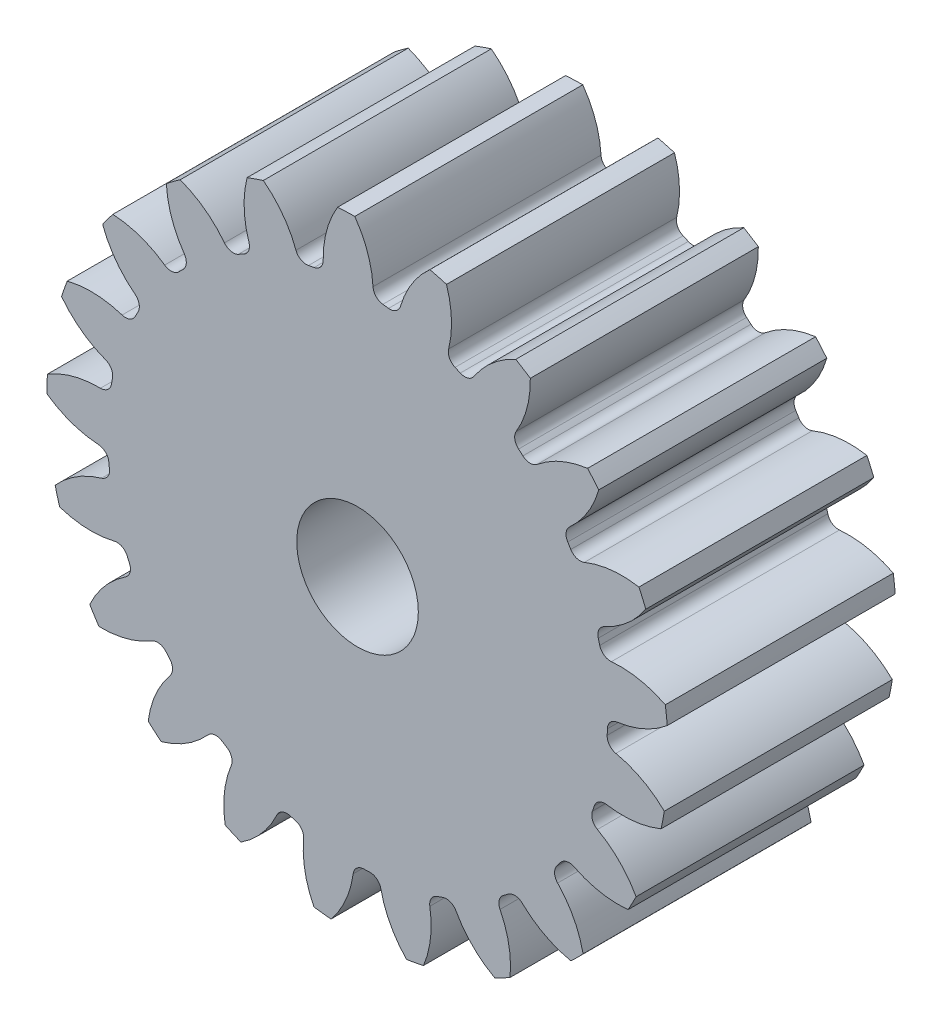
ISO-10303-21;
HEADER;
FILE_DESCRIPTION(('STEP AP214'),'2;1');
FILE_NAME('part.step','',(''),(''),'','','');
FILE_SCHEMA(('AUTOMOTIVE_DESIGN { 1 0 10303 214 1 1 1 1 }'));
ENDSEC;
DATA;
#1=APPLICATION_CONTEXT('core data for automotive mechanical design processes');
#2=APPLICATION_PROTOCOL_DEFINITION('international standard','automotive_design',2000,#1);
#3=PRODUCT_CONTEXT('',#1,'mechanical');
#4=PRODUCT('Part','Part','',(#3));
#5=PRODUCT_RELATED_PRODUCT_CATEGORY('part','',(#4));
#6=PRODUCT_DEFINITION_FORMATION('','',#4);
#7=PRODUCT_DEFINITION_CONTEXT('part definition',#1,'design');
#8=PRODUCT_DEFINITION('design','',#6,#7);
#9=PRODUCT_DEFINITION_SHAPE('','',#8);
#10=(LENGTH_UNIT() NAMED_UNIT(*) SI_UNIT(.MILLI.,.METRE.));
#11=(NAMED_UNIT(*) PLANE_ANGLE_UNIT() SI_UNIT($,.RADIAN.));
#12=(NAMED_UNIT(*) SI_UNIT($,.STERADIAN.) SOLID_ANGLE_UNIT());
#13=UNCERTAINTY_MEASURE_WITH_UNIT(LENGTH_MEASURE(1.E-05),#10,'distance_accuracy_value','');
#14=(GEOMETRIC_REPRESENTATION_CONTEXT(3) GLOBAL_UNCERTAINTY_ASSIGNED_CONTEXT((#13)) GLOBAL_UNIT_ASSIGNED_CONTEXT((#10,
#11,#12)) REPRESENTATION_CONTEXT('',''));
#15=CARTESIAN_POINT('',(0.,0.,0.));
#16=DIRECTION('',(0.,0.,1.));
#17=DIRECTION('',(1.,0.,0.));
#18=AXIS2_PLACEMENT_3D('',#15,#16,#17);
#19=CARTESIAN_POINT('',(0.,0.,95.25));
#20=DIRECTION('',(0.,0.,-1.));
#21=DIRECTION('',(-1.,0.,0.));
#22=AXIS2_PLACEMENT_3D('',#19,#20,#21);
#23=CYLINDRICAL_SURFACE('',#22,129.822222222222);
#24=DIRECTION('',(0.,0.,-1.));
#25=VECTOR('',#24,1.);
#26=CARTESIAN_POINT('',(128.570055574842,17.9875009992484,47.625));
#27=LINE('',#26,#25);
#28=CARTESIAN_POINT('',(128.570055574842,17.9875009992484,95.25));
#29=VERTEX_POINT('',#28);
#30=CARTESIAN_POINT('',(128.570055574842,17.9875009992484,0.));
#31=VERTEX_POINT('',#30);
#32=EDGE_CURVE('E852',#29,#31,#27,.T.);
#33=ORIENTED_EDGE('',*,*,#32,.F.);
#34=CARTESIAN_POINT('',(0.,0.,95.25));
#35=DIRECTION('',(0.,0.,1.));
#36=DIRECTION('',(1.,0.,0.));
#37=AXIS2_PLACEMENT_3D('',#34,#35,#36);
#38=CIRCLE('',#37,129.822222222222);
#39=CARTESIAN_POINT('',(129.368186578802,10.8481189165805,95.25));
#40=VERTEX_POINT('',#39);
#41=EDGE_CURVE('E1611',#40,#29,#38,.T.);
#42=ORIENTED_EDGE('',*,*,#41,.F.);
#43=DIRECTION('',(0.,0.,-1.));
#44=VECTOR('',#43,1.);
#45=CARTESIAN_POINT('',(129.368186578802,10.8481189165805,47.625));
#46=LINE('',#45,#44);
#47=CARTESIAN_POINT('',(129.368186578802,10.8481189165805,0.));
#48=VERTEX_POINT('',#47);
#49=EDGE_CURVE('E1605',#48,#40,#46,.F.);
#50=ORIENTED_EDGE('',*,*,#49,.F.);
#51=CARTESIAN_POINT('',(0.,0.,0.));
#52=DIRECTION('',(0.,0.,1.));
#53=DIRECTION('',(1.,0.,0.));
#54=AXIS2_PLACEMENT_3D('',#51,#52,#53);
#55=CIRCLE('',#54,129.822222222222);
#56=EDGE_CURVE('E1616',#48,#31,#55,.T.);
#57=ORIENTED_EDGE('',*,*,#56,.T.);
#58=EDGE_LOOP('',(#33,#42,#50,#57));
#59=FACE_BOUND('',#58,.T.);
#60=ADVANCED_FACE('F33',(#59),#23,.T.);
#61=DIRECTION('',(0.,0.,-1.));
#62=VECTOR('',#61,1.);
#63=CARTESIAN_POINT('',(120.423181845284,48.498109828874,47.625));
#64=LINE('',#63,#62);
#65=CARTESIAN_POINT('',(120.423181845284,48.498109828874,0.));
#66=VERTEX_POINT('',#65);
#67=CARTESIAN_POINT('',(120.423181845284,48.498109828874,95.25));
#68=VERTEX_POINT('',#67);
#69=EDGE_CURVE('E823',#66,#68,#64,.F.);
#70=ORIENTED_EDGE('',*,*,#69,.F.);
#71=CARTESIAN_POINT('',(117.556139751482,55.0850559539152,0.));
#72=VERTEX_POINT('',#71);
#73=EDGE_CURVE('E1619',#66,#72,#55,.T.);
#74=ORIENTED_EDGE('',*,*,#73,.T.);
#75=DIRECTION('',(0.,0.,-1.));
#76=VECTOR('',#75,1.);
#77=CARTESIAN_POINT('',(117.556139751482,55.0850559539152,47.625));
#78=LINE('',#77,#76);
#79=CARTESIAN_POINT('',(117.556139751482,55.0850559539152,95.25));
#80=VERTEX_POINT('',#79);
#81=EDGE_CURVE('E885',#80,#72,#78,.T.);
#82=ORIENTED_EDGE('',*,*,#81,.F.);
#83=EDGE_CURVE('E1614',#68,#80,#38,.T.);
#84=ORIENTED_EDGE('',*,*,#83,.F.);
#85=EDGE_LOOP('',(#70,#74,#82,#84));
#86=FACE_BOUND('',#85,.T.);
#87=ADVANCED_FACE('F1856',(#86),#23,.T.);
#88=CARTESIAN_POINT('',(0.,0.,95.25));
#89=DIRECTION('',(0.,0.,1.));
#90=DIRECTION('',(1.,0.,0.));
#91=AXIS2_PLACEMENT_3D('',#88,#89,#90);
#92=PLANE('',#91);
#93=CARTESIAN_POINT('',(0.,0.,95.2500000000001));
#94=DIRECTION('',(0.,0.,1.));
#95=DIRECTION('',(1.,0.,0.));
#96=AXIS2_PLACEMENT_3D('',#93,#94,#95);
#97=CIRCLE('',#96,25.4);
#98=CARTESIAN_POINT('',(25.4,0.,95.2499999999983));
#99=VERTEX_POINT('',#98);
#100=EDGE_CURVE('E840',#99,#99,#97,.T.);
#101=ORIENTED_EDGE('',*,*,#100,.F.);
#102=EDGE_LOOP('',(#101));
#103=FACE_BOUND('',#102,.T.);
#104=ORIENTED_EDGE('',*,*,#41,.T.);
#105=CARTESIAN_POINT('',(109.778540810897,-18.8485443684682,95.25));
#106=DIRECTION('',(0.,0.,-1.));
#107=DIRECTION('',(0.955572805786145,0.294755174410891,0.));
#108=AXIS2_PLACEMENT_3D('',#105,#106,#107);
#109=CIRCLE('',#108,41.3523308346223);
#110=CARTESIAN_POINT('',(106.056420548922,22.3359319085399,95.25));
#111=VERTEX_POINT('',#110);
#112=EDGE_CURVE('E832',#111,#29,#109,.T.);
#113=ORIENTED_EDGE('',*,*,#112,.F.);
#114=CARTESIAN_POINT('',(105.642862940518,26.9118596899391,95.25));
#115=DIRECTION('',(0.,0.,1.));
#116=DIRECTION('',(-0.955572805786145,-0.294755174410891,0.));
#117=AXIS2_PLACEMENT_3D('',#114,#115,#116);
#118=CIRCLE('',#117,4.59457777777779);
#119=CARTESIAN_POINT('',(101.190481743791,25.7776433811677,95.25));
#120=VERTEX_POINT('',#119);
#121=EDGE_CURVE('E830',#120,#111,#118,.T.);
#122=ORIENTED_EDGE('',*,*,#121,.F.);
#123=CARTESIAN_POINT('',(0.,0.,95.25));
#124=DIRECTION('',(0.,0.,-1.));
#125=DIRECTION('',(0.955572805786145,0.294755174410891,0.));
#126=AXIS2_PLACEMENT_3D('',#123,#124,#125);
#127=CIRCLE('',#126,104.422222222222);
#128=CARTESIAN_POINT('',(100.571347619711,28.0963437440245,95.25));
#129=VERTEX_POINT('',#128);
#130=EDGE_CURVE('E815',#129,#120,#127,.T.);
#131=ORIENTED_EDGE('',*,*,#130,.F.);
#132=CARTESIAN_POINT('',(104.996486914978,29.3325828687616,95.25));
#133=DIRECTION('',(0.,0.,1.));
#134=DIRECTION('',(-0.955572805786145,-0.294755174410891,0.));
#135=AXIS2_PLACEMENT_3D('',#132,#133,#134);
#136=CIRCLE('',#135,4.59457777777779);
#137=CARTESIAN_POINT('',(103.073926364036,33.5055800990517,95.25));
#138=VERTEX_POINT('',#137);
#139=EDGE_CURVE('E807',#138,#129,#136,.T.);
#140=ORIENTED_EDGE('',*,*,#139,.F.);
#141=CARTESIAN_POINT('',(85.7704082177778,71.0635822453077,95.25));
#142=DIRECTION('',(0.,0.,-1.));
#143=DIRECTION('',(-0.955572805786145,-0.294755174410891,0.));
#144=AXIS2_PLACEMENT_3D('',#141,#142,#143);
#145=CIRCLE('',#144,41.3523308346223);
#146=EDGE_CURVE('E837',#68,#138,#145,.T.);
#147=ORIENTED_EDGE('',*,*,#146,.F.);
#148=ORIENTED_EDGE('',*,*,#83,.T.);
#149=CARTESIAN_POINT('',(110.457094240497,14.3466365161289,95.25));
#150=DIRECTION('',(0.,0.,-1.));
#151=DIRECTION('',(0.826238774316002,0.563320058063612,0.));
#152=AXIS2_PLACEMENT_3D('',#149,#150,#151);
#153=CIRCLE('',#152,41.3523308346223);
#154=CARTESIAN_POINT('',(94.760999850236,52.6042878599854,95.25));
#155=VERTEX_POINT('',#154);
#156=EDGE_CURVE('E861',#155,#80,#153,.T.);
#157=ORIENTED_EDGE('',*,*,#156,.F.);
#158=CARTESIAN_POINT('',(93.0170370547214,56.8550217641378,95.25));
#159=DIRECTION('',(0.,0.,1.));
#160=DIRECTION('',(-0.826238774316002,-0.563320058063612,0.));
#161=AXIS2_PLACEMENT_3D('',#158,#159,#160);
#162=CIRCLE('',#161,4.59457777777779);
#163=CARTESIAN_POINT('',(89.0967787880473,54.4588331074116,95.25));
#164=VERTEX_POINT('',#163);
#165=EDGE_CURVE('E859',#164,#155,#162,.T.);
#166=ORIENTED_EDGE('',*,*,#165,.F.);
#167=CARTESIAN_POINT('',(0.,0.,95.25));
#168=DIRECTION('',(0.,0.,-1.));
#169=DIRECTION('',(0.826238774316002,0.563320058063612,0.));
#170=AXIS2_PLACEMENT_3D('',#167,#168,#169);
#171=CIRCLE('',#170,104.422222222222);
#172=CARTESIAN_POINT('',(87.8217021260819,56.4920271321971,95.25));
#173=VERTEX_POINT('',#172);
#174=EDGE_CURVE('E856',#173,#164,#171,.T.);
#175=ORIENTED_EDGE('',*,*,#174,.F.);
#176=CARTESIAN_POINT('',(91.6858570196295,58.9776763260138,95.25));
#177=DIRECTION('',(0.,0.,1.));
#178=DIRECTION('',(-0.826238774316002,-0.563320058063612,0.));
#179=AXIS2_PLACEMENT_3D('',#176,#177,#178);
#180=CIRCLE('',#179,4.59457777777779);
#181=CARTESIAN_POINT('',(88.6186979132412,62.3985943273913,95.25));
#182=VERTEX_POINT('',#181);
#183=EDGE_CURVE('E854',#182,#173,#180,.T.);
#184=ORIENTED_EDGE('',*,*,#183,.F.);
#185=CARTESIAN_POINT('',(61.0135110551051,93.1876983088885,95.25));
#186=DIRECTION('',(0.,0.,-1.));
#187=DIRECTION('',(-0.826238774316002,-0.563320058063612,0.));
#188=AXIS2_PLACEMENT_3D('',#185,#186,#187);
#189=CIRCLE('',#188,41.3523308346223);
#190=CARTESIAN_POINT('',(100.778048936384,81.8388308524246,95.25));
#191=VERTEX_POINT('',#190);
#192=EDGE_CURVE('E864',#191,#182,#189,.T.);
#193=ORIENTED_EDGE('',*,*,#192,.F.);
#194=CARTESIAN_POINT('',(96.0968450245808,87.2880619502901,95.25));
#195=VERTEX_POINT('',#194);
#196=EDGE_CURVE('E1669',#191,#195,#38,.T.);
#197=ORIENTED_EDGE('',*,*,#196,.T.);
#198=CARTESIAN_POINT('',(101.321050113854,46.2670557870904,95.25));
#199=DIRECTION('',(0.,0.,-1.));
#200=DIRECTION('',(0.623489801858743,0.781831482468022,0.));
#201=AXIS2_PLACEMENT_3D('',#198,#199,#200);
#202=CIRCLE('',#201,41.3523308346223);
#203=CARTESIAN_POINT('',(75.0456484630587,78.1985219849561,95.25));
#204=VERTEX_POINT('',#203);
#205=EDGE_CURVE('E896',#204,#195,#202,.T.);
#206=ORIENTED_EDGE('',*,*,#205,.F.);
#207=CARTESIAN_POINT('',(72.1262392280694,81.7463656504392,95.25));
#208=DIRECTION('',(0.,0.,1.));
#209=DIRECTION('',(-0.623489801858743,-0.781831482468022,0.));
#210=AXIS2_PLACEMENT_3D('',#207,#208,#209);
#211=CIRCLE('',#210,4.59457777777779);
#212=CARTESIAN_POINT('',(69.086436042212,78.3011165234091,95.25));
#213=VERTEX_POINT('',#212);
#214=EDGE_CURVE('E894',#213,#204,#211,.T.);
#215=ORIENTED_EDGE('',*,*,#214,.F.);
#216=CARTESIAN_POINT('',(0.,0.,95.25));
#217=DIRECTION('',(0.,0.,-1.));
#218=DIRECTION('',(0.623489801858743,0.781831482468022,0.));
#219=AXIS2_PLACEMENT_3D('',#216,#217,#218);
#220=CIRCLE('',#219,104.422222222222);
#221=CARTESIAN_POINT('',(67.2687129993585,79.8681459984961,95.25));
#222=VERTEX_POINT('',#221);
#223=EDGE_CURVE('E891',#222,#213,#220,.T.);
#224=ORIENTED_EDGE('',*,*,#223,.F.);
#225=CARTESIAN_POINT('',(70.2285363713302,83.38234442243,95.25));
#226=DIRECTION('',(0.,0.,1.));
#227=DIRECTION('',(-0.623489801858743,-0.781831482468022,0.));
#228=AXIS2_PLACEMENT_3D('',#225,#226,#227);
#229=CIRCLE('',#228,4.59457777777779);
#230=CARTESIAN_POINT('',(66.2893092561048,85.7472196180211,95.25));
#231=VERTEX_POINT('',#230);
#232=EDGE_CURVE('E889',#231,#222,#229,.T.);
#233=ORIENTED_EDGE('',*,*,#232,.F.);
#234=CARTESIAN_POINT('',(30.8352956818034,107.031678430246,95.25));
#235=DIRECTION('',(0.,0.,-1.));
#236=DIRECTION('',(-0.623489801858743,-0.781831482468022,0.));
#237=AXIS2_PLACEMENT_3D('',#234,#235,#236);
#238=CIRCLE('',#237,41.3523308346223);
#239=CARTESIAN_POINT('',(72.1783441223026,107.907812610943,95.25));
#240=VERTEX_POINT('',#239);
#241=EDGE_CURVE('E899',#240,#231,#238,.T.);
#242=ORIENTED_EDGE('',*,*,#241,.F.);
#243=CARTESIAN_POINT('',(66.0989239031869,111.735140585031,95.25));
#244=VERTEX_POINT('',#243);
#245=EDGE_CURVE('E1838',#240,#244,#38,.T.);
#246=ORIENTED_EDGE('',*,*,#245,.T.);
#247=CARTESIAN_POINT('',(83.1821860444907,74.076444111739,95.25));
#248=DIRECTION('',(0.,0.,-1.));
#249=DIRECTION('',(0.365341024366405,0.9308737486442,0.));
#250=AXIS2_PLACEMENT_3D('',#247,#248,#249);
#251=CIRCLE('',#250,41.3523308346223);
#252=CARTESIAN_POINT('',(48.6621618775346,96.844474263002,95.25));
#253=VERTEX_POINT('',#252);
#254=EDGE_CURVE('E934',#253,#244,#251,.T.);
#255=ORIENTED_EDGE('',*,*,#254,.F.);
#256=CARTESIAN_POINT('',(44.8267085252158,99.3741862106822,95.25));
#257=DIRECTION('',(0.,0.,1.));
#258=DIRECTION('',(-0.365341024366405,-0.9308737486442,0.));
#259=AXIS2_PLACEMENT_3D('',#256,#257,#258);
#260=CIRCLE('',#259,4.59457777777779);
#261=CARTESIAN_POINT('',(42.9374602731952,95.1860021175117,95.25));
#262=VERTEX_POINT('',#261);
#263=EDGE_CURVE('E932',#262,#253,#260,.T.);
#264=ORIENTED_EDGE('',*,*,#263,.F.);
#265=CARTESIAN_POINT('',(0.,0.,95.25));
#266=DIRECTION('',(0.,0.,-1.));
#267=DIRECTION('',(0.365341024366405,0.9308737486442,0.));
#268=AXIS2_PLACEMENT_3D('',#265,#266,#267);
#269=CIRCLE('',#268,104.422222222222);
#270=CARTESIAN_POINT('',(40.7386035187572,96.1476295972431,95.25));
#271=VERTEX_POINT('',#270);
#272=EDGE_CURVE('E929',#271,#262,#269,.T.);
#273=ORIENTED_EDGE('',*,*,#272,.F.);
#274=CARTESIAN_POINT('',(42.5311020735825,100.378125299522,95.25));
#275=DIRECTION('',(0.,0.,1.));
#276=DIRECTION('',(-0.365341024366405,-0.9308737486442,0.));
#277=AXIS2_PLACEMENT_3D('',#274,#275,#276);
#278=CIRCLE('',#277,4.59457777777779);
#279=CARTESIAN_POINT('',(38.0698245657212,101.476828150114,95.25));
#280=VERTEX_POINT('',#279);
#281=EDGE_CURVE('E927',#280,#271,#278,.T.);
#282=ORIENTED_EDGE('',*,*,#281,.F.);
#283=CARTESIAN_POINT('',(-2.08277103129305,111.365424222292,95.25));
#284=DIRECTION('',(0.,0.,-1.));
#285=DIRECTION('',(-0.365341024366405,-0.9308737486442,0.));
#286=AXIS2_PLACEMENT_3D('',#283,#284,#285);
#287=CIRCLE('',#286,41.3523308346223);
#288=CARTESIAN_POINT('',(37.1652766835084,124.388711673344,95.25));
#289=VERTEX_POINT('',#288);
#290=EDGE_CURVE('E937',#289,#280,#287,.T.);
#291=ORIENTED_EDGE('',*,*,#290,.F.);
#292=CARTESIAN_POINT('',(30.2278233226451,126.254061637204,95.25));
#293=VERTEX_POINT('',#292);
#294=EDGE_CURVE('E1834',#289,#293,#38,.T.);
#295=ORIENTED_EDGE('',*,*,#294,.T.);
#296=CARTESIAN_POINT('',(57.6522197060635,95.3038152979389,95.25));
#297=DIRECTION('',(0.,0.,-1.));
#298=DIRECTION('',(0.074730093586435,0.997203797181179,0.));
#299=AXIS2_PLACEMENT_3D('',#296,#297,#298);
#300=CIRCLE('',#299,41.3523308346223);
#301=CARTESIAN_POINT('',(17.9548286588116,106.885370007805,95.25));
#302=VERTEX_POINT('',#301);
#303=EDGE_CURVE('E972',#302,#293,#300,.T.);
#304=ORIENTED_EDGE('',*,*,#303,.F.);
#305=CARTESIAN_POINT('',(13.5441280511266,108.172174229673,95.25));
#306=DIRECTION('',(0.,0.,1.));
#307=DIRECTION('',(-0.074730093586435,-0.997203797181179,0.));
#308=AXIS2_PLACEMENT_3D('',#305,#306,#307);
#309=CIRCLE('',#308,4.59457777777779);
#310=CARTESIAN_POINT('',(12.9733027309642,103.613193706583,95.25));
#311=VERTEX_POINT('',#310);
#312=EDGE_CURVE('E970',#311,#302,#309,.T.);
#313=ORIENTED_EDGE('',*,*,#312,.F.);
#314=CARTESIAN_POINT('',(0.,0.,95.25));
#315=DIRECTION('',(0.,0.,-1.));
#316=DIRECTION('',(0.074730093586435,0.997203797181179,0.));
#317=AXIS2_PLACEMENT_3D('',#314,#315,#316);
#318=CIRCLE('',#317,104.422222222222);
#319=CARTESIAN_POINT('',(10.5886903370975,103.883974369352,95.25));
#320=VERTEX_POINT('',#319);
#321=EDGE_CURVE('E967',#320,#311,#318,.T.);
#322=ORIENTED_EDGE('',*,*,#321,.F.);
#323=CARTESIAN_POINT('',(11.0545927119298,108.454869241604,95.25));
#324=DIRECTION('',(0.,0.,1.));
#325=DIRECTION('',(-0.074730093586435,-0.997203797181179,0.));
#326=AXIS2_PLACEMENT_3D('',#323,#324,#325);
#327=CIRCLE('',#326,4.59457777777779);
#328=CARTESIAN_POINT('',(6.46766889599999,108.189775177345,95.25));
#329=VERTEX_POINT('',#328);
#330=EDGE_CURVE('E965',#329,#320,#327,.T.);
#331=ORIENTED_EDGE('',*,*,#330,.F.);
#332=CARTESIAN_POINT('',(-34.8157743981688,105.803863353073,95.25));
#333=DIRECTION('',(0.,0.,-1.));
#334=DIRECTION('',(-0.074730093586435,-0.997203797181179,0.));
#335=AXIS2_PLACEMENT_3D('',#332,#333,#334);
#336=CIRCLE('',#335,41.3523308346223);
#337=CARTESIAN_POINT('',(-1.15008868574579,129.817127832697,95.25));
#338=VERTEX_POINT('',#337);
#339=EDGE_CURVE('E975',#338,#329,#336,.T.);
#340=ORIENTED_EDGE('',*,*,#339,.F.);
#341=CARTESIAN_POINT('',(-8.32915201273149,129.554755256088,95.25));
#342=VERTEX_POINT('',#341);
#343=EDGE_CURVE('E1830',#338,#342,#38,.T.);
#344=ORIENTED_EDGE('',*,*,#343,.T.);
#345=CARTESIAN_POINT('',(26.9996006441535,108.063024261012,95.25));
#346=DIRECTION('',(0.,0.,-1.));
#347=DIRECTION('',(-0.222520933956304,0.974927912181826,0.));
#348=AXIS2_PLACEMENT_3D('',#345,#346,#347);
#349=CIRCLE('',#348,41.3523308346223);
#350=CARTESIAN_POINT('',(-14.3478698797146,107.429031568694,95.25));
#351=VERTEX_POINT('',#350);
#352=EDGE_CURVE('E1010',#351,#342,#349,.T.);
#353=ORIENTED_EDGE('',*,*,#352,.F.);
#354=CARTESIAN_POINT('',(-18.9419076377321,107.358589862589,95.25));
#355=DIRECTION('',(0.,0.,1.));
#356=DIRECTION('',(0.222520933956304,-0.974927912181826,0.));
#357=AXIS2_PLACEMENT_3D('',#354,#355,#356);
#358=CIRCLE('',#357,4.59457777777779);
#359=CARTESIAN_POINT('',(-18.1435896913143,102.833898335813,95.25));
#360=VERTEX_POINT('',#359);
#361=EDGE_CURVE('E1008',#360,#351,#358,.T.);
#362=ORIENTED_EDGE('',*,*,#361,.F.);
#363=CARTESIAN_POINT('',(0.,0.,95.25));
#364=DIRECTION('',(0.,0.,-1.));
#365=DIRECTION('',(-0.222520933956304,0.974927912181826,0.));
#366=AXIS2_PLACEMENT_3D('',#363,#364,#365);
#367=CIRCLE('',#366,104.422222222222);
#368=CARTESIAN_POINT('',(-20.5020744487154,102.389772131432,95.25));
#369=VERTEX_POINT('',#368);
#370=EDGE_CURVE('E1005',#369,#360,#367,.T.);
#371=ORIENTED_EDGE('',*,*,#370,.F.);
#372=CARTESIAN_POINT('',(-21.4041657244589,106.894922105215,95.25));
#373=DIRECTION('',(0.,0.,1.));
#374=DIRECTION('',(0.222520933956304,-0.974927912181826,0.));
#375=AXIS2_PLACEMENT_3D('',#372,#373,#374);
#376=CIRCLE('',#375,4.59457777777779);
#377=CARTESIAN_POINT('',(-25.7091675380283,105.289585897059,95.25));
#378=VERTEX_POINT('',#377);
#379=EDGE_CURVE('E1003',#378,#369,#376,.T.);
#380=ORIENTED_EDGE('',*,*,#379,.F.);
#381=CARTESIAN_POINT('',(-64.4552434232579,90.8411649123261,95.25));
#382=DIRECTION('',(0.,0.,-1.));
#383=DIRECTION('',(0.222520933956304,-0.974927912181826,0.));
#384=AXIS2_PLACEMENT_3D('',#381,#382,#383);
#385=CIRCLE('',#384,41.3523308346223);
#386=CARTESIAN_POINT('',(-39.3632636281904,123.710722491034,95.25));
#387=VERTEX_POINT('',#386);
#388=EDGE_CURVE('E1013',#387,#378,#385,.T.);
#389=ORIENTED_EDGE('',*,*,#388,.F.);
#390=CARTESIAN_POINT('',(-46.1460456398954,121.343940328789,95.25));
#391=VERTEX_POINT('',#390);
#392=EDGE_CURVE('E1826',#387,#391,#38,.T.);
#393=ORIENTED_EDGE('',*,*,#392,.T.);
#394=CARTESIAN_POINT('',(-6.05205142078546,111.220359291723,95.25));
#395=DIRECTION('',(0.,0.,-1.));
#396=DIRECTION('',(-0.499999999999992,0.866025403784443,0.));
#397=AXIS2_PLACEMENT_3D('',#394,#395,#396);
#398=CIRCLE('',#397,41.3523308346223);
#399=CARTESIAN_POINT('',(-45.3756972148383,98.4271522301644,95.25));
#400=VERTEX_POINT('',#399);
#401=EDGE_CURVE('E1048',#400,#391,#398,.T.);
#402=ORIENTED_EDGE('',*,*,#401,.F.);
#403=CARTESIAN_POINT('',(-49.7448717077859,97.0057236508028,95.25));
#404=DIRECTION('',(0.,0.,1.));
#405=DIRECTION('',(0.499999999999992,-0.866025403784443,0.));
#406=AXIS2_PLACEMENT_3D('',#403,#404,#405);
#407=CIRCLE('',#406,4.59457777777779);
#408=CARTESIAN_POINT('',(-47.6483445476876,92.9173598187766,95.25));
#409=VERTEX_POINT('',#408);
#410=EDGE_CURVE('E1046',#409,#400,#407,.T.);
#411=ORIENTED_EDGE('',*,*,#410,.F.);
#412=CARTESIAN_POINT('',(0.,0.,95.25));
#413=DIRECTION('',(0.,0.,-1.));
#414=DIRECTION('',(-0.499999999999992,0.866025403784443,0.));
#415=AXIS2_PLACEMENT_3D('',#412,#413,#414);
#416=CIRCLE('',#415,104.422222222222);
#417=CARTESIAN_POINT('',(-49.7711399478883,91.7977893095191,95.25));
#418=VERTEX_POINT('',#417);
#419=EDGE_CURVE('E1043',#418,#409,#416,.T.);
#420=ORIENTED_EDGE('',*,*,#419,.F.);
#421=CARTESIAN_POINT('',(-51.9610701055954,95.836892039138,95.25));
#422=DIRECTION('',(0.,0.,1.));
#423=DIRECTION('',(0.499999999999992,-0.866025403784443,0.));
#424=AXIS2_PLACEMENT_3D('',#421,#422,#423);
#425=CIRCLE('',#424,4.59457777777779);
#426=CARTESIAN_POINT('',(-55.6016316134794,93.0339548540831,95.25));
#427=VERTEX_POINT('',#426);
#428=EDGE_CURVE('E1041',#427,#418,#425,.T.);
#429=ORIENTED_EDGE('',*,*,#428,.F.);
#430=CARTESIAN_POINT('',(-88.3675812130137,67.8068303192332,95.25));
#431=DIRECTION('',(0.,0.,-1.));
#432=DIRECTION('',(0.499999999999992,-0.866025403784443,0.));
#433=AXIS2_PLACEMENT_3D('',#430,#431,#432);
#434=CIRCLE('',#433,41.3523308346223);
#435=CARTESIAN_POINT('',(-74.0788398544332,106.612076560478,95.25));
#436=VERTEX_POINT('',#435);
#437=EDGE_CURVE('E1051',#436,#427,#434,.T.);
#438=ORIENTED_EDGE('',*,*,#437,.F.);
#439=CARTESIAN_POINT('',(-79.8626606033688,102.351183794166,95.25));
#440=VERTEX_POINT('',#439);
#441=EDGE_CURVE('E1822',#436,#440,#38,.T.);
#442=ORIENTED_EDGE('',*,*,#441,.T.);
#443=CARTESIAN_POINT('',(-38.5659521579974,104.495277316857,95.25));
#444=DIRECTION('',(0.,0.,-1.));
#445=DIRECTION('',(-0.73305187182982,0.680172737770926,0.));
#446=AXIS2_PLACEMENT_3D('',#443,#444,#445);
#447=CIRCLE('',#446,41.3523308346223);
#448=CARTESIAN_POINT('',(-72.3716947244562,80.6795884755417,95.25));
#449=VERTEX_POINT('',#448);
#450=EDGE_CURVE('E1086',#449,#440,#447,.T.);
#451=ORIENTED_EDGE('',*,*,#450,.F.);
#452=CARTESIAN_POINT('',(-76.127785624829,78.0334731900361,95.25));
#453=DIRECTION('',(0.,0.,1.));
#454=DIRECTION('',(0.73305187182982,-0.680172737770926,0.));
#455=AXIS2_PLACEMENT_3D('',#452,#453,#454);
#456=CIRCLE('',#455,4.59457777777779);
#457=CARTESIAN_POINT('',(-72.9193348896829,74.7447061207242,95.25));
#458=VERTEX_POINT('',#457);
#459=EDGE_CURVE('E1084',#458,#449,#456,.T.);
#460=ORIENTED_EDGE('',*,*,#459,.F.);
#461=CARTESIAN_POINT('',(0.,0.,95.25));
#462=DIRECTION('',(0.,0.,-1.));
#463=DIRECTION('',(-0.73305187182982,0.680172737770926,0.));
#464=AXIS2_PLACEMENT_3D('',#461,#462,#463);
#465=CIRCLE('',#464,104.422222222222);
#466=CARTESIAN_POINT('',(-74.6178212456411,73.0491700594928,95.25));
#467=VERTEX_POINT('',#466);
#468=EDGE_CURVE('E1081',#467,#458,#465,.T.);
#469=ORIENTED_EDGE('',*,*,#468,.F.);
#470=CARTESIAN_POINT('',(-77.9010053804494,76.2633335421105,95.25));
#471=DIRECTION('',(0.,0.,1.));
#472=DIRECTION('',(0.73305187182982,-0.680172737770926,0.));
#473=AXIS2_PLACEMENT_3D('',#470,#471,#472);
#474=CIRCLE('',#473,4.59457777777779);
#475=CARTESIAN_POINT('',(-80.5536467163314,72.5118486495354,95.25));
#476=VERTEX_POINT('',#475);
#477=EDGE_CURVE('E1079',#476,#467,#474,.T.);
#478=ORIENTED_EDGE('',*,*,#477,.F.);
#479=CARTESIAN_POINT('',(-104.42807161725,38.7475612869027,95.25));
#480=DIRECTION('',(0.,0.,-1.));
#481=DIRECTION('',(0.73305187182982,-0.680172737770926,0.));
#482=AXIS2_PLACEMENT_3D('',#479,#480,#481);
#483=CIRCLE('',#482,41.3523308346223);
#484=CARTESIAN_POINT('',(-102.212186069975,80.0404797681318,95.25));
#485=VERTEX_POINT('',#484);
#486=EDGE_CURVE('E1089',#485,#476,#483,.T.);
#487=ORIENTED_EDGE('',*,*,#486,.F.);
#488=CARTESIAN_POINT('',(-106.483127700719,74.2640754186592,95.25));
#489=VERTEX_POINT('',#488);
#490=EDGE_CURVE('E1818',#485,#489,#38,.T.);
#491=ORIENTED_EDGE('',*,*,#490,.T.);
#492=CARTESIAN_POINT('',(-67.6530988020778,88.4853313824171,95.25));
#493=DIRECTION('',(0.,0.,-1.));
#494=DIRECTION('',(-0.900968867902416,0.433883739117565,0.));
#495=AXIS2_PLACEMENT_3D('',#492,#493,#494);
#496=CIRCLE('',#495,41.3523308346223);
#497=CARTESIAN_POINT('',(-92.937149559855,55.7632892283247,95.25));
#498=VERTEX_POINT('',#497);
#499=EDGE_CURVE('E1124',#498,#489,#496,.T.);
#500=ORIENTED_EDGE('',*,*,#499,.F.);
#501=CARTESIAN_POINT('',(-95.7464117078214,52.1276061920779,95.25));
#502=DIRECTION('',(0.,0.,1.));
#503=DIRECTION('',(0.900968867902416,-0.433883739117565,0.));
#504=AXIS2_PLACEMENT_3D('',#501,#502,#503);
#505=CIRCLE('',#504,4.59457777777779);
#506=CARTESIAN_POINT('',(-91.7111223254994,49.9306572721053,95.25));
#507=VERTEX_POINT('',#506);
#508=EDGE_CURVE('E1122',#507,#498,#505,.T.);
#509=ORIENTED_EDGE('',*,*,#508,.F.);
#510=CARTESIAN_POINT('',(0.,0.,95.25));
#511=DIRECTION('',(0.,0.,-1.));
#512=DIRECTION('',(-0.900968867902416,0.433883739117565,0.));
#513=AXIS2_PLACEMENT_3D('',#510,#511,#512);
#514=CIRCLE('',#513,104.422222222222);
#515=CARTESIAN_POINT('',(-92.8343816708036,47.8098114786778,95.25));
#516=VERTEX_POINT('',#515);
#517=EDGE_CURVE('E1119',#516,#507,#514,.T.);
#518=ORIENTED_EDGE('',*,*,#517,.F.);
#519=CARTESIAN_POINT('',(-96.919094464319,49.9134431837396,95.25));
#520=DIRECTION('',(0.,0.,1.));
#521=DIRECTION('',(0.900968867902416,-0.433883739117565,0.));
#522=AXIS2_PLACEMENT_3D('',#519,#520,#521);
#523=CIRCLE('',#522,4.59457777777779);
#524=CARTESIAN_POINT('',(-98.3481168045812,45.5467464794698,95.25));
#525=VERTEX_POINT('',#524);
#526=EDGE_CURVE('E1117',#525,#516,#523,.T.);
#527=ORIENTED_EDGE('',*,*,#526,.F.);
#528=CARTESIAN_POINT('',(-111.20966958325,6.24540139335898,95.25));
#529=DIRECTION('',(0.,0.,-1.));
#530=DIRECTION('',(0.900968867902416,-0.433883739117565,0.));
#531=AXIS2_PLACEMENT_3D('',#528,#529,#530);
#532=CIRCLE('',#531,41.3523308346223);
#533=CARTESIAN_POINT('',(-121.26353100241,46.3569350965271,95.25));
#534=VERTEX_POINT('',#533);
#535=EDGE_CURVE('E1127',#534,#525,#532,.T.);
#536=ORIENTED_EDGE('',*,*,#535,.F.);
#537=CARTESIAN_POINT('',(-123.642101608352,39.5782780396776,95.25));
#538=VERTEX_POINT('',#537);
#539=EDGE_CURVE('E1814',#534,#538,#38,.T.);
#540=ORIENTED_EDGE('',*,*,#539,.T.);
#541=CARTESIAN_POINT('',(-90.7289707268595,64.6130754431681,95.25));
#542=DIRECTION('',(0.,0.,-1.));
#543=DIRECTION('',(-0.988830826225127,0.149042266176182,0.));
#544=AXIS2_PLACEMENT_3D('',#541,#542,#543);
#545=CIRCLE('',#544,41.3523308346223);
#546=CARTESIAN_POINT('',(-105.244730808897,25.8921770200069,95.25));
#547=VERTEX_POINT('',#546);
#548=EDGE_CURVE('E1162',#547,#538,#545,.T.);
#549=ORIENTED_EDGE('',*,*,#548,.F.);
#550=CARTESIAN_POINT('',(-106.857548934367,21.5899726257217,95.25));
#551=DIRECTION('',(0.,0.,1.));
#552=DIRECTION('',(0.988830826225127,-0.149042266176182,0.));
#553=AXIS2_PLACEMENT_3D('',#550,#551,#552);
#554=CIRCLE('',#553,4.59457777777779);
#555=CARTESIAN_POINT('',(-102.353974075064,20.6800504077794,95.25));
#556=VERTEX_POINT('',#555);
#557=EDGE_CURVE('E1160',#556,#547,#554,.T.);
#558=ORIENTED_EDGE('',*,*,#557,.F.);
#559=CARTESIAN_POINT('',(0.,0.,95.25));
#560=DIRECTION('',(0.,0.,-1.));
#561=DIRECTION('',(-0.988830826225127,0.149042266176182,0.));
#562=AXIS2_PLACEMENT_3D('',#559,#560,#561);
#563=CIRCLE('',#562,104.422222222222);
#564=CARTESIAN_POINT('',(-102.802199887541,18.3223413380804,95.25));
#565=VERTEX_POINT('',#564);
#566=EDGE_CURVE('E1157',#565,#556,#563,.T.);
#567=ORIENTED_EDGE('',*,*,#566,.F.);
#568=CARTESIAN_POINT('',(-107.325496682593,19.1285243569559,95.25));
#569=DIRECTION('',(0.,0.,1.));
#570=DIRECTION('',(0.988830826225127,-0.149042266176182,0.));
#571=AXIS2_PLACEMENT_3D('',#568,#569,#570);
#572=CIRCLE('',#571,4.59457777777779);
#573=CARTESIAN_POINT('',(-107.403925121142,14.5346160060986,95.25));
#574=VERTEX_POINT('',#573);
#575=EDGE_CURVE('E1155',#574,#565,#572,.T.);
#576=ORIENTED_EDGE('',*,*,#575,.F.);
#577=CARTESIAN_POINT('',(-108.109800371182,-26.8116898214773,95.25));
#578=DIRECTION('',(0.,0.,-1.));
#579=DIRECTION('',(0.988830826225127,-0.149042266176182,0.));
#580=AXIS2_PLACEMENT_3D('',#577,#578,#579);
#581=CIRCLE('',#580,41.3523308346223);
#582=CARTESIAN_POINT('',(-129.540079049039,8.55437330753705,95.25));
#583=VERTEX_POINT('',#582);
#584=EDGE_CURVE('E1165',#583,#574,#581,.T.);
#585=ORIENTED_EDGE('',*,*,#584,.F.);
#586=CARTESIAN_POINT('',(-129.814932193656,1.37577697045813,95.25));
#587=VERTEX_POINT('',#586);
#588=EDGE_CURVE('E1810',#583,#587,#38,.T.);
#589=ORIENTED_EDGE('',*,*,#588,.T.);
#590=CARTESIAN_POINT('',(-105.74317544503,34.9996642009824,95.25));
#591=DIRECTION('',(0.,0.,-1.));
#592=DIRECTION('',(-0.98883082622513,-0.149042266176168,0.));
#593=AXIS2_PLACEMENT_3D('',#590,#591,#592);
#594=CIRCLE('',#593,41.3523308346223);
#595=CARTESIAN_POINT('',(-108.200855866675,-6.27956874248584,95.25));
#596=VERTEX_POINT('',#595);
#597=EDGE_CURVE('E1200',#596,#587,#594,.T.);
#598=ORIENTED_EDGE('',*,*,#597,.F.);
#599=CARTESIAN_POINT('',(-108.473924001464,-10.8660247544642,95.25));
#600=DIRECTION('',(0.,0.,1.));
#601=DIRECTION('',(0.98883082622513,0.149042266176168,0.));
#602=AXIS2_PLACEMENT_3D('',#599,#600,#601);
#603=CIRCLE('',#602,4.59457777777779);
#604=CARTESIAN_POINT('',(-103.902226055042,-10.4080696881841,95.25));
#605=VERTEX_POINT('',#604);
#606=EDGE_CURVE('E1198',#605,#596,#603,.T.);
#607=ORIENTED_EDGE('',*,*,#606,.F.);
#608=CARTESIAN_POINT('',(0.,0.,95.25));
#609=DIRECTION('',(0.,0.,-1.));
#610=DIRECTION('',(-0.98883082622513,-0.149042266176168,0.));
#611=AXIS2_PLACEMENT_3D('',#608,#609,#610);
#612=CIRCLE('',#611,104.422222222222);
#613=CARTESIAN_POINT('',(-103.635591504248,-12.7931492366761,95.25));
#614=VERTEX_POINT('',#613);
#615=EDGE_CURVE('E1195',#614,#605,#612,.T.);
#616=ORIENTED_EDGE('',*,*,#615,.F.);
#617=CARTESIAN_POINT('',(-108.195557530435,-13.3560478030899,95.25));
#618=DIRECTION('',(0.,0.,1.));
#619=DIRECTION('',(0.98883082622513,0.149042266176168,0.));
#620=AXIS2_PLACEMENT_3D('',#617,#618,#619);
#621=CIRCLE('',#620,4.59457777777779);
#622=CARTESIAN_POINT('',(-106.916423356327,-17.7689788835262,95.25));
#623=VERTEX_POINT('',#622);
#624=EDGE_CURVE('E1193',#623,#614,#621,.T.);
#625=ORIENTED_EDGE('',*,*,#624,.F.);
#626=CARTESIAN_POINT('',(-95.403900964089,-57.4864447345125,95.25));
#627=DIRECTION('',(0.,0.,-1.));
#628=DIRECTION('',(0.98883082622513,0.149042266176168,0.));
#629=AXIS2_PLACEMENT_3D('',#626,#627,#628);
#630=CIRCLE('',#629,41.3523308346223);
#631=CARTESIAN_POINT('',(-126.306422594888,-30.0082820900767,95.25));
#632=VERTEX_POINT('',#631);
#633=EDGE_CURVE('E1203',#632,#623,#630,.T.);
#634=ORIENTED_EDGE('',*,*,#633,.F.);
#635=CARTESIAN_POINT('',(-124.453136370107,-36.9489679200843,95.25));
#636=VERTEX_POINT('',#635);
#637=EDGE_CURVE('E1806',#632,#636,#38,.T.);
#638=ORIENTED_EDGE('',*,*,#637,.T.);
#639=CARTESIAN_POINT('',(-111.361634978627,2.27637920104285,95.25));
#640=DIRECTION('',(0.,0.,-1.));
#641=DIRECTION('',(-0.900968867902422,-0.433883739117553,0.));
#642=AXIS2_PLACEMENT_3D('',#639,#640,#641);
#643=CIRCLE('',#642,41.3523308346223);
#644=CARTESIAN_POINT('',(-101.542860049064,-37.8933472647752,95.25));
#645=VERTEX_POINT('',#644);
#646=EDGE_CURVE('E1238',#645,#636,#643,.T.);
#647=ORIENTED_EDGE('',*,*,#646,.F.);
#648=CARTESIAN_POINT('',(-100.451914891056,-42.3565281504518,95.25));
#649=DIRECTION('',(0.,0.,1.));
#650=DIRECTION('',(0.900968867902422,0.433883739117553,0.));
#651=AXIS2_PLACEMENT_3D('',#648,#649,#650);
#652=CIRCLE('',#651,4.59457777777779);
#653=CARTESIAN_POINT('',(-96.2183092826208,-40.5713871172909,95.25));
#654=VERTEX_POINT('',#653);
#655=EDGE_CURVE('E1236',#654,#645,#652,.T.);
#656=ORIENTED_EDGE('',*,*,#655,.F.);
#657=CARTESIAN_POINT('',(0.,0.,95.25));
#658=DIRECTION('',(0.,0.,-1.));
#659=DIRECTION('',(-0.900968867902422,-0.433883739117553,0.));
#660=AXIS2_PLACEMENT_3D('',#657,#658,#659);
#661=CIRCLE('',#660,104.422222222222);
#662=CARTESIAN_POINT('',(-95.260506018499,-42.7719123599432,95.25));
#663=VERTEX_POINT('',#662);
#664=EDGE_CURVE('E1233',#663,#654,#661,.T.);
#665=ORIENTED_EDGE('',*,*,#664,.F.);
#666=CARTESIAN_POINT('',(-99.451968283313,-44.6538765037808,95.25));
#667=DIRECTION('',(0.,0.,1.));
#668=DIRECTION('',(0.900968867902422,0.433883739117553,0.));
#669=AXIS2_PLACEMENT_3D('',#666,#667,#668);
#670=CIRCLE('',#669,4.59457777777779);
#671=CARTESIAN_POINT('',(-96.9289281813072,-48.4937220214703,95.25));
#672=VERTEX_POINT('',#671);
#673=EDGE_CURVE('E1231',#672,#663,#670,.T.);
#674=ORIENTED_EDGE('',*,*,#673,.F.);
#675=CARTESIAN_POINT('',(-74.2209462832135,-83.0532767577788,95.25));
#676=DIRECTION('',(0.,0.,-1.));
#677=DIRECTION('',(0.900968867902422,0.433883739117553,0.));
#678=AXIS2_PLACEMENT_3D('',#675,#676,#677);
#679=CIRCLE('',#678,41.3523308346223);
#680=CARTESIAN_POINT('',(-111.849886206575,-65.9045699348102,95.25));
#681=VERTEX_POINT('',#680);
#682=EDGE_CURVE('E1241',#681,#672,#679,.T.);
#683=ORIENTED_EDGE('',*,*,#682,.F.);
#684=CARTESIAN_POINT('',(-108.033133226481,-71.9906348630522,95.25));
#685=VERTEX_POINT('',#684);
#686=EDGE_CURVE('E1802',#681,#685,#38,.T.);
#687=ORIENTED_EDGE('',*,*,#686,.T.);
#688=CARTESIAN_POINT('',(-107.085124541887,-30.6491720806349,95.25));
#689=DIRECTION('',(0.,0.,-1.));
#690=DIRECTION('',(-0.73305187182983,-0.680172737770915,0.));
#691=AXIS2_PLACEMENT_3D('',#688,#689,#690);
#692=CIRCLE('',#691,41.3523308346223);
#693=CARTESIAN_POINT('',(-85.8623355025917,-66.1401355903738,95.25));
#694=VERTEX_POINT('',#693);
#695=EDGE_CURVE('E1276',#694,#685,#692,.T.);
#696=ORIENTED_EDGE('',*,*,#695,.F.);
#697=CARTESIAN_POINT('',(-83.5043123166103,-70.0834681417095,95.25));
#698=DIRECTION('',(0.,0.,1.));
#699=DIRECTION('',(0.73305187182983,0.680172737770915,0.));
#700=AXIS2_PLACEMENT_3D('',#697,#698,#699);
#701=CIRCLE('',#700,4.59457777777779);
#702=CARTESIAN_POINT('',(-79.9849734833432,-67.1297587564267,95.25));
#703=VERTEX_POINT('',#702);
#704=EDGE_CURVE('E1274',#703,#694,#701,.T.);
#705=ORIENTED_EDGE('',*,*,#704,.F.);
#706=CARTESIAN_POINT('',(0.,0.,95.25));
#707=DIRECTION('',(0.,0.,-1.));
#708=DIRECTION('',(-0.73305187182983,-0.680172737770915,0.));
#709=AXIS2_PLACEMENT_3D('',#706,#707,#708);
#710=CIRCLE('',#709,104.422222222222);
#711=CARTESIAN_POINT('',(-78.4211065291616,-68.9502033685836,95.25));
#712=VERTEX_POINT('',#711);
#713=EDGE_CURVE('E1271',#712,#703,#710,.T.);
#714=ORIENTED_EDGE('',*,*,#713,.F.);
#715=CARTESIAN_POINT('',(-81.8716352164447,-71.9840123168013,95.25));
#716=DIRECTION('',(0.,0.,1.));
#717=DIRECTION('',(0.73305187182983,0.680172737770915,0.));
#718=AXIS2_PLACEMENT_3D('',#715,#716,#717);
#719=CIRCLE('',#718,4.59457777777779);
#720=CARTESIAN_POINT('',(-78.3288723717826,-74.9095851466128,95.25));
#721=VERTEX_POINT('',#720);
#722=EDGE_CURVE('E1269',#721,#712,#719,.T.);
#723=ORIENTED_EDGE('',*,*,#722,.F.);
#724=CARTESIAN_POINT('',(-46.4431348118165,-101.240460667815,95.25));
#725=DIRECTION('',(0.,0.,-1.));
#726=DIRECTION('',(0.73305187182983,0.680172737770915,0.));
#727=AXIS2_PLACEMENT_3D('',#724,#725,#726);
#728=CIRCLE('',#727,41.3523308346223);
#729=CARTESIAN_POINT('',(-87.4549965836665,-95.9449475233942,95.25));
#730=VERTEX_POINT('',#729);
#731=EDGE_CURVE('E1279',#730,#721,#728,.T.);
#732=ORIENTED_EDGE('',*,*,#731,.F.);
#733=CARTESIAN_POINT('',(-82.013912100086,-100.63561797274,95.25));
#734=VERTEX_POINT('',#733);
#735=EDGE_CURVE('E1798',#730,#734,#38,.T.);
#736=ORIENTED_EDGE('',*,*,#735,.T.);
#737=CARTESIAN_POINT('',(-93.293630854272,-60.851409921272,95.25));
#738=DIRECTION('',(0.,0.,-1.));
#739=DIRECTION('',(-0.500000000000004,-0.866025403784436,0.));
#740=AXIS2_PLACEMENT_3D('',#737,#738,#739);
#741=CIRCLE('',#740,41.3523308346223);
#742=CARTESIAN_POINT('',(-62.552565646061,-88.5100826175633,95.25));
#743=VERTEX_POINT('',#742);
#744=EDGE_CURVE('E1314',#743,#734,#741,.T.);
#745=ORIENTED_EDGE('',*,*,#744,.F.);
#746=CARTESIAN_POINT('',(-59.1369851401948,-91.5831844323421,95.25));
#747=DIRECTION('',(0.,0.,1.));
#748=DIRECTION('',(0.500000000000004,0.866025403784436,0.));
#749=AXIS2_PLACEMENT_3D('',#746,#747,#748);
#750=CIRCLE('',#749,4.59457777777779);
#751=CARTESIAN_POINT('',(-56.6446217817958,-87.7233567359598,95.25));
#752=VERTEX_POINT('',#751);
#753=EDGE_CURVE('E1312',#752,#743,#750,.T.);
#754=ORIENTED_EDGE('',*,*,#753,.F.);
#755=CARTESIAN_POINT('',(0.,0.,95.25));
#756=DIRECTION('',(0.,0.,-1.));
#757=DIRECTION('',(-0.500000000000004,-0.866025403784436,0.));
#758=AXIS2_PLACEMENT_3D('',#755,#756,#757);
#759=CIRCLE('',#758,104.422222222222);
#760=CARTESIAN_POINT('',(-54.6136475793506,-89.0019662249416,95.25));
#761=VERTEX_POINT('',#760);
#762=EDGE_CURVE('E1309',#761,#752,#759,.T.);
#763=ORIENTED_EDGE('',*,*,#762,.F.);
#764=CARTESIAN_POINT('',(-57.016648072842,-92.9180527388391,95.25));
#765=DIRECTION('',(0.,0.,1.));
#766=DIRECTION('',(0.500000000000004,0.866025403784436,0.));
#767=AXIS2_PLACEMENT_3D('',#764,#765,#766);
#768=CIRCLE('',#767,4.59457777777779);
#769=CARTESIAN_POINT('',(-52.7689525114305,-94.6694028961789,95.25));
#770=VERTEX_POINT('',#769);
#771=EDGE_CURVE('E1307',#770,#761,#768,.T.);
#772=ORIENTED_EDGE('',*,*,#771,.F.);
#773=CARTESIAN_POINT('',(-14.5386470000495,-110.431985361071,95.25));
#774=DIRECTION('',(0.,0.,-1.));
#775=DIRECTION('',(0.500000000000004,0.866025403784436,0.));
#776=AXIS2_PLACEMENT_3D('',#773,#774,#775);
#777=CIRCLE('',#776,41.3523308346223);
#778=CARTESIAN_POINT('',(-55.2893467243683,-117.460195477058,95.25));
#779=VERTEX_POINT('',#778);
#780=EDGE_CURVE('E1317',#779,#770,#777,.T.);
#781=ORIENTED_EDGE('',*,*,#780,.F.);
#782=CARTESIAN_POINT('',(-48.7073949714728,-120.338684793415,95.25));
#783=VERTEX_POINT('',#782);
#784=EDGE_CURVE('E1794',#779,#783,#38,.T.);
#785=ORIENTED_EDGE('',*,*,#784,.T.);
#786=CARTESIAN_POINT('',(-71.2125886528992,-85.64673294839,95.25));
#787=DIRECTION('',(0.,0.,-1.));
#788=DIRECTION('',(-0.222520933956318,-0.974927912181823,0.));
#789=AXIS2_PLACEMENT_3D('',#786,#787,#788);
#790=CIRCLE('',#789,41.3523308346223);
#791=CARTESIAN_POINT('',(-33.6847258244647,-103.015520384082,95.25));
#792=VERTEX_POINT('',#791);
#793=EDGE_CURVE('E1352',#792,#783,#790,.T.);
#794=ORIENTED_EDGE('',*,*,#793,.F.);
#795=CARTESIAN_POINT('',(-29.5150773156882,-104.945332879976,95.25));
#796=DIRECTION('',(0.,0.,1.));
#797=DIRECTION('',(0.222520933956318,0.974927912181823,0.));
#798=AXIS2_PLACEMENT_3D('',#795,#796,#797);
#799=CIRCLE('',#798,4.59457777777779);
#800=CARTESIAN_POINT('',(-28.2711468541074,-100.522349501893,95.25));
#801=VERTEX_POINT('',#800);
#802=EDGE_CURVE('E1350',#801,#792,#799,.T.);
#803=ORIENTED_EDGE('',*,*,#802,.F.);
#804=CARTESIAN_POINT('',(0.,0.,95.25));
#805=DIRECTION('',(0.,0.,-1.));
#806=DIRECTION('',(-0.222520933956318,-0.974927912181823,0.));
#807=AXIS2_PLACEMENT_3D('',#804,#805,#806);
#808=CIRCLE('',#807,104.422222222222);
#809=CARTESIAN_POINT('',(-25.9535263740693,-101.145513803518,95.25));
#810=VERTEX_POINT('',#809);
#811=EDGE_CURVE('E1347',#810,#801,#808,.T.);
#812=ORIENTED_EDGE('',*,*,#811,.F.);
#813=CARTESIAN_POINT('',(-27.0954815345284,-105.595916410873,95.25));
#814=DIRECTION('',(0.,0.,1.));
#815=DIRECTION('',(0.222520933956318,0.974927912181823,0.));
#816=AXIS2_PLACEMENT_3D('',#813,#814,#815);
#817=CIRCLE('',#816,4.59457777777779);
#818=CARTESIAN_POINT('',(-22.5202796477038,-106.017428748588,95.25));
#819=VERTEX_POINT('',#818);
#820=EDGE_CURVE('E1345',#819,#810,#817,.T.);
#821=ORIENTED_EDGE('',*,*,#820,.F.);
#822=CARTESIAN_POINT('',(18.6576633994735,-109.811143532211,95.25));
#823=DIRECTION('',(0.,0.,-1.));
#824=DIRECTION('',(0.222520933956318,0.974927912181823,0.));
#825=AXIS2_PLACEMENT_3D('',#822,#823,#824);
#826=CIRCLE('',#825,41.3523308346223);
#827=CARTESIAN_POINT('',(-18.2109957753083,-128.538589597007,95.25));
#828=VERTEX_POINT('',#827);
#829=EDGE_CURVE('E1355',#828,#819,#826,.T.);
#830=ORIENTED_EDGE('',*,*,#829,.F.);
#831=CARTESIAN_POINT('',(-11.0730120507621,-129.349131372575,95.25));
#832=VERTEX_POINT('',#831);
#833=EDGE_CURVE('E1790',#828,#832,#38,.T.);
#834=ORIENTED_EDGE('',*,*,#833,.T.);
#835=CARTESIAN_POINT('',(-42.8039954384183,-102.831967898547,95.25));
#836=DIRECTION('',(0.,0.,-1.));
#837=DIRECTION('',(0.0747300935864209,-0.997203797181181,0.));
#838=AXIS2_PLACEMENT_3D('',#835,#836,#837);
#839=CIRCLE('',#838,41.3523308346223);
#840=CARTESIAN_POINT('',(-1.82385029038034,-108.367577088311,95.25));
#841=VERTEX_POINT('',#840);
#842=EDGE_CURVE('E1390',#841,#832,#839,.T.);
#843=ORIENTED_EDGE('',*,*,#842,.F.);
#844=CARTESIAN_POINT('',(2.72937465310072,-108.982627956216,95.25));
#845=DIRECTION('',(0.,0.,1.));
#846=DIRECTION('',(-0.0747300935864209,0.997203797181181,0.));
#847=AXIS2_PLACEMENT_3D('',#844,#845,#846);
#848=CIRCLE('',#847,4.59457777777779);
#849=CARTESIAN_POINT('',(2.61434353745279,-104.389490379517,95.25));
#850=VERTEX_POINT('',#849);
#851=EDGE_CURVE('E1388',#850,#841,#848,.T.);
#852=ORIENTED_EDGE('',*,*,#851,.F.);
#853=CARTESIAN_POINT('',(0.,0.,95.25));
#854=DIRECTION('',(0.,0.,-1.));
#855=DIRECTION('',(0.0747300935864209,-0.997203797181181,0.));
#856=AXIS2_PLACEMENT_3D('',#853,#854,#855);
#857=CIRCLE('',#856,104.422222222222);
#858=CARTESIAN_POINT('',(5.01267954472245,-104.301838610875,95.25));
#859=VERTEX_POINT('',#858);
#860=EDGE_CURVE('E1385',#859,#850,#857,.T.);
#861=ORIENTED_EDGE('',*,*,#860,.F.);
#862=CARTESIAN_POINT('',(5.23323744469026,-108.891119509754,95.25));
#863=DIRECTION('',(0.,0.,1.));
#864=DIRECTION('',(-0.0747300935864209,0.997203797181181,0.));
#865=AXIS2_PLACEMENT_3D('',#862,#863,#864);
#866=CIRCLE('',#865,4.59457777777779);
#867=CARTESIAN_POINT('',(9.72941889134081,-107.945340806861,95.25));
#868=VERTEX_POINT('',#867);
#869=EDGE_CURVE('E1383',#868,#859,#866,.T.);
#870=ORIENTED_EDGE('',*,*,#869,.F.);
#871=CARTESIAN_POINT('',(50.196158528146,-99.4330997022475,95.25));
#872=DIRECTION('',(0.,0.,-1.));
#873=DIRECTION('',(-0.0747300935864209,0.997203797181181,0.));
#874=AXIS2_PLACEMENT_3D('',#871,#872,#873);
#875=CIRCLE('',#874,41.3523308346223);
#876=CARTESIAN_POINT('',(20.4854820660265,-128.195765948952,95.25));
#877=VERTEX_POINT('',#876);
#878=EDGE_CURVE('E1393',#877,#868,#875,.T.);
#879=ORIENTED_EDGE('',*,*,#878,.F.);
#880=CARTESIAN_POINT('',(27.5452565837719,-126.866339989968,95.25));
#881=VERTEX_POINT('',#880);
#882=EDGE_CURVE('E1786',#877,#881,#38,.T.);
#883=ORIENTED_EDGE('',*,*,#882,.T.);
#884=CARTESIAN_POINT('',(-10.5920793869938,-110.880131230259,95.25));
#885=DIRECTION('',(0.,0.,-1.));
#886=DIRECTION('',(0.365341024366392,-0.930873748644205,0.));
#887=AXIS2_PLACEMENT_3D('',#884,#885,#886);
#888=CIRCLE('',#887,41.3523308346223);
#889=CARTESIAN_POINT('',(30.1990823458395,-104.090699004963,95.25));
#890=VERTEX_POINT('',#889);
#891=EDGE_CURVE('E1428',#890,#881,#888,.T.);
#892=ORIENTED_EDGE('',*,*,#891,.F.);
#893=CARTESIAN_POINT('',(34.7313097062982,-103.336338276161,95.25));
#894=DIRECTION('',(0.,0.,1.));
#895=DIRECTION('',(-0.365341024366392,0.930873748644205,0.));
#896=AXIS2_PLACEMENT_3D('',#893,#894,#895);
#897=CIRCLE('',#896,4.59457777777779);
#898=CARTESIAN_POINT('',(33.2675380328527,-98.9811669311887,95.25));
#899=VERTEX_POINT('',#898);
#900=EDGE_CURVE('E1426',#899,#890,#897,.T.);
#901=ORIENTED_EDGE('',*,*,#900,.F.);
#902=CARTESIAN_POINT('',(0.,0.,95.25));
#903=DIRECTION('',(0.,0.,-1.));
#904=DIRECTION('',(0.365341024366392,-0.930873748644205,0.));
#905=AXIS2_PLACEMENT_3D('',#902,#903,#904);
#906=CIRCLE('',#905,104.422222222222);
#907=CARTESIAN_POINT('',(35.5334868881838,-98.1904873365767,95.25));
#908=VERTEX_POINT('',#907);
#909=EDGE_CURVE('E1423',#908,#899,#906,.T.);
#910=ORIENTED_EDGE('',*,*,#909,.F.);
#911=CARTESIAN_POINT('',(37.0969603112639,-102.510868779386,95.25));
#912=DIRECTION('',(0.,0.,1.));
#913=DIRECTION('',(-0.365341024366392,0.930873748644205,0.));
#914=AXIS2_PLACEMENT_3D('',#911,#912,#913);
#915=CIRCLE('',#914,4.59457777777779);
#916=CARTESIAN_POINT('',(41.1146158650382,-100.28183562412,95.25));
#917=VERTEX_POINT('',#916);
#918=EDGE_CURVE('E1421',#917,#908,#915,.T.);
#919=ORIENTED_EDGE('',*,*,#918,.F.);
#920=CARTESIAN_POINT('',(77.2745046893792,-80.2199886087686,95.25));
#921=DIRECTION('',(0.,0.,-1.));
#922=DIRECTION('',(-0.365341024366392,0.930873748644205,0.));
#923=AXIS2_PLACEMENT_3D('',#920,#921,#922);
#924=CIRCLE('',#923,41.3523308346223);
#925=CARTESIAN_POINT('',(57.3617349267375,-116.46218591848,95.25));
#926=VERTEX_POINT('',#925);
#927=EDGE_CURVE('E1431',#926,#917,#924,.T.);
#928=ORIENTED_EDGE('',*,*,#927,.F.);
#929=CARTESIAN_POINT('',(63.7160082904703,-113.110917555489,95.25));
#930=VERTEX_POINT('',#929);
#931=EDGE_CURVE('E1782',#926,#930,#38,.T.);
#932=ORIENTED_EDGE('',*,*,#931,.T.);
#933=CARTESIAN_POINT('',(22.5609894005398,-109.076108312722,95.25));
#934=DIRECTION('',(0.,0.,-1.));
#935=DIRECTION('',(0.623489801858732,-0.781831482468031,0.));
#936=AXIS2_PLACEMENT_3D('',#933,#934,#935);
#937=CIRCLE('',#936,41.3523308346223);
#938=CARTESIAN_POINT('',(59.5386939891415,-90.5649055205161,95.25));
#939=VERTEX_POINT('',#938);
#940=EDGE_CURVE('E1466',#939,#930,#937,.T.);
#941=ORIENTED_EDGE('',*,*,#940,.F.);
#942=CARTESIAN_POINT('',(63.647215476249,-88.5081614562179,95.25));
#943=DIRECTION('',(0.,0.,1.));
#944=DIRECTION('',(-0.623489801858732,0.781831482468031,0.));
#945=AXIS2_PLACEMENT_3D('',#942,#943,#944);
#946=CIRCLE('',#945,4.59457777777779);
#947=CARTESIAN_POINT('',(60.9647657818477,-84.7779324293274,95.25));
#948=VERTEX_POINT('',#947);
#949=EDGE_CURVE('E1464',#948,#939,#946,.T.);
#950=ORIENTED_EDGE('',*,*,#949,.F.);
#951=CARTESIAN_POINT('',(0.,0.,95.25));
#952=DIRECTION('',(0.,0.,-1.));
#953=DIRECTION('',(0.623489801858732,-0.781831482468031,0.));
#954=AXIS2_PLACEMENT_3D('',#951,#952,#953);
#955=CIRCLE('',#954,104.422222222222);
#956=CARTESIAN_POINT('',(62.8969879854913,-83.3544803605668,95.25));
#957=VERTEX_POINT('',#956);
#958=EDGE_CURVE('E1461',#957,#948,#955,.T.);
#959=ORIENTED_EDGE('',*,*,#958,.F.);
#960=CARTESIAN_POINT('',(65.6644554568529,-87.0220774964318,95.25));
#961=DIRECTION('',(0.,0.,1.));
#962=DIRECTION('',(-0.623489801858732,0.781831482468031,0.));
#963=AXIS2_PLACEMENT_3D('',#960,#961,#962);
#964=CIRCLE('',#963,4.59457777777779);
#965=CARTESIAN_POINT('',(68.8465987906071,-83.707849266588,95.25));
#966=VERTEX_POINT('',#965);
#967=EDGE_CURVE('E1459',#966,#957,#964,.T.);
#968=ORIENTED_EDGE('',*,*,#967,.F.);
#969=CARTESIAN_POINT('',(97.4866719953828,-53.878979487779,95.25));
#970=DIRECTION('',(0.,0.,-1.));
#971=DIRECTION('',(-0.623489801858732,0.781831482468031,0.));
#972=AXIS2_PLACEMENT_3D('',#969,#970,#971);
#973=CIRCLE('',#972,41.3523308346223);
#974=CARTESIAN_POINT('',(89.1411459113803,-94.3804295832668,95.25));
#975=VERTEX_POINT('',#974);
#976=EDGE_CURVE('E1469',#975,#966,#973,.T.);
#977=ORIENTED_EDGE('',*,*,#976,.F.);
#978=CARTESIAN_POINT('',(94.2253130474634,-89.3050937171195,95.25));
#979=VERTEX_POINT('',#978);
#980=EDGE_CURVE('E1778',#975,#979,#38,.T.);
#981=ORIENTED_EDGE('',*,*,#980,.T.);
#982=CARTESIAN_POINT('',(53.7094152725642,-97.5801944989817,95.25));
#983=DIRECTION('',(0.,0.,-1.));
#984=DIRECTION('',(0.826238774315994,-0.563320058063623,0.));
#985=AXIS2_PLACEMENT_3D('',#982,#983,#984);
#986=CIRCLE('',#985,41.3523308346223);
#987=CARTESIAN_POINT('',(83.5880313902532,-68.9920227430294,95.25));
#988=VERTEX_POINT('',#987);
#989=EDGE_CURVE('E1504',#988,#979,#986,.T.);
#990=ORIENTED_EDGE('',*,*,#989,.F.);
#991=CARTESIAN_POINT('',(86.9077868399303,-65.8156460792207,95.25));
#992=DIRECTION('',(0.,0.,1.));
#993=DIRECTION('',(-0.826238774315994,0.563320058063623,0.));
#994=AXIS2_PLACEMENT_3D('',#991,#992,#993);
#995=CIRCLE('',#994,4.59457777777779);
#996=CARTESIAN_POINT('',(83.2450065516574,-63.0418065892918,95.25));
#997=VERTEX_POINT('',#996);
#998=EDGE_CURVE('E1502',#997,#988,#995,.T.);
#999=ORIENTED_EDGE('',*,*,#998,.F.);
#1000=CARTESIAN_POINT('',(0.,0.,95.25));
#1001=DIRECTION('',(0.,0.,-1.));
#1002=DIRECTION('',(0.826238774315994,-0.563320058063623,0.));
#1003=AXIS2_PLACEMENT_3D('',#1000,#1001,#1002);
#1004=CIRCLE('',#1003,104.422222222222);
#1005=CARTESIAN_POINT('',(84.6718156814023,-61.1120620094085,95.25));
#1006=VERTEX_POINT('',#1005);
#1007=EDGE_CURVE('E1499',#1006,#997,#1004,.T.);
#1008=ORIENTED_EDGE('',*,*,#1007,.F.);
#1009=CARTESIAN_POINT('',(88.397375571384,-63.8009927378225,95.25));
#1010=DIRECTION('',(0.,0.,1.));
#1011=DIRECTION('',(-0.826238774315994,0.563320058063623,0.));
#1012=AXIS2_PLACEMENT_3D('',#1009,#1010,#1011);
#1013=CIRCLE('',#1012,4.59457777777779);
#1014=CARTESIAN_POINT('',(90.461259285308,-59.6960531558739,95.25));
#1015=VERTEX_POINT('',#1014);
#1016=EDGE_CURVE('E1497',#1015,#1006,#1013,.T.);
#1017=ORIENTED_EDGE('',*,*,#1016,.F.);
#1018=CARTESIAN_POINT('',(109.036720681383,-22.7505865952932,95.25));
#1019=DIRECTION('',(0.,0.,-1.));
#1020=DIRECTION('',(-0.826238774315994,0.563320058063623,0.));
#1021=AXIS2_PLACEMENT_3D('',#1018,#1019,#1020);
#1022=CIRCLE('',#1021,41.3523308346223);
#1023=CARTESIAN_POINT('',(112.999974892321,-63.9125578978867,95.25));
#1024=VERTEX_POINT('',#1023);
#1025=EDGE_CURVE('E1507',#1024,#1015,#1022,.T.);
#1026=ORIENTED_EDGE('',*,*,#1025,.F.);
#1027=CARTESIAN_POINT('',(116.362285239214,-57.564120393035,95.25));
#1028=VERTEX_POINT('',#1027);
#1029=EDGE_CURVE('E1777',#1024,#1028,#38,.T.);
#1030=ORIENTED_EDGE('',*,*,#1029,.T.);
#1031=CARTESIAN_POINT('',(80.0855238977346,-77.4138521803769,95.25));
#1032=DIRECTION('',(0.,0.,-1.));
#1033=DIRECTION('',(0.955572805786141,-0.294755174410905,0.));
#1034=AXIS2_PLACEMENT_3D('',#1031,#1032,#1033);
#1035=CIRCLE('',#1034,41.3523308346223);
#1036=CARTESIAN_POINT('',(100.210205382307,-41.2888959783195,95.25));
#1037=VERTEX_POINT('',#1036);
#1038=EDGE_CURVE('E1542',#1037,#1028,#1035,.T.);
#1039=ORIENTED_EDGE('',*,*,#1038,.F.);
#1040=CARTESIAN_POINT('',(102.446219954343,-37.2751217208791,95.25));
#1041=DIRECTION('',(0.,0.,1.));
#1042=DIRECTION('',(-0.955572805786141,0.294755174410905,0.));
#1043=AXIS2_PLACEMENT_3D('',#1040,#1041,#1042);
#1044=CIRCLE('',#1043,4.59457777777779);
#1045=CARTESIAN_POINT('',(98.1285631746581,-35.7041395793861,95.25));
#1046=VERTEX_POINT('',#1045);
#1047=EDGE_CURVE('E1540',#1046,#1037,#1044,.T.);
#1048=ORIENTED_EDGE('',*,*,#1047,.F.);
#1049=CARTESIAN_POINT('',(0.,0.,95.25));
#1050=DIRECTION('',(0.,0.,-1.));
#1051=DIRECTION('',(0.955572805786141,-0.294755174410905,0.));
#1052=AXIS2_PLACEMENT_3D('',#1049,#1050,#1051);
#1053=CIRCLE('',#1052,104.422222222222);
#1054=CARTESIAN_POINT('',(98.9231809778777,-33.4395687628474,95.25));
#1055=VERTEX_POINT('',#1054);
#1056=EDGE_CURVE('E1537',#1055,#1046,#1053,.T.);
#1057=ORIENTED_EDGE('',*,*,#1056,.F.);
#1058=CARTESIAN_POINT('',(103.275800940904,-34.9109097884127,95.25));
#1059=DIRECTION('',(0.,0.,1.));
#1060=DIRECTION('',(-0.955572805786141,0.294755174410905,0.));
#1061=AXIS2_PLACEMENT_3D('',#1058,#1059,#1060);
#1062=CIRCLE('',#1061,4.59457777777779);
#1063=CARTESIAN_POINT('',(104.038039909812,-30.3800007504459,95.25));
#1064=VERTEX_POINT('',#1063);
#1065=EDGE_CURVE('E1535',#1064,#1055,#1062,.T.);
#1066=ORIENTED_EDGE('',*,*,#1065,.F.);
#1067=CARTESIAN_POINT('',(110.898378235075,10.3992957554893,95.25));
#1068=DIRECTION('',(0.,0.,-1.));
#1069=DIRECTION('',(-0.955572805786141,0.294755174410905,0.));
#1070=AXIS2_PLACEMENT_3D('',#1067,#1068,#1069);
#1071=CIRCLE('',#1070,41.3523308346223);
#1072=CARTESIAN_POINT('',(126.818260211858,-27.7657749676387,95.25));
#1073=VERTEX_POINT('',#1072);
#1074=EDGE_CURVE('E1545',#1073,#1064,#1071,.T.);
#1075=ORIENTED_EDGE('',*,*,#1074,.F.);
#1076=CARTESIAN_POINT('',(128.159957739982,-20.7083223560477,95.25));
#1077=VERTEX_POINT('',#1076);
#1078=EDGE_CURVE('E1615',#1073,#1077,#38,.T.);
#1079=ORIENTED_EDGE('',*,*,#1078,.T.);
#1080=CARTESIAN_POINT('',(99.3456822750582,-50.3689493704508,95.25));
#1081=DIRECTION('',(0.,0.,-1.));
#1082=DIRECTION('',(1.,0.,0.));
#1083=AXIS2_PLACEMENT_3D('',#1080,#1081,#1082);
#1084=CIRCLE('',#1083,41.3523308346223);
#1085=CARTESIAN_POINT('',(107.9282628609,-9.9170696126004,95.25));
#1086=VERTEX_POINT('',#1085);
#1087=EDGE_CURVE('E1580',#1086,#1077,#1084,.T.);
#1088=ORIENTED_EDGE('',*,*,#1087,.F.);
#1089=CARTESIAN_POINT('',(108.881856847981,-5.42253921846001,95.25));
#1090=DIRECTION('',(0.,0.,1.));
#1091=DIRECTION('',(-1.,0.,0.));
#1092=AXIS2_PLACEMENT_3D('',#1089,#1090,#1091);
#1093=CIRCLE('',#1092,4.59457777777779);
#1094=CARTESIAN_POINT('',(104.292966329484,-5.1940030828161,95.25));
#1095=VERTEX_POINT('',#1094);
#1096=EDGE_CURVE('E1578',#1095,#1086,#1093,.T.);
#1097=ORIENTED_EDGE('',*,*,#1096,.F.);
#1098=CARTESIAN_POINT('',(0.,0.,95.25));
#1099=DIRECTION('',(0.,0.,-1.));
#1100=DIRECTION('',(1.,0.,0.));
#1101=AXIS2_PLACEMENT_3D('',#1098,#1099,#1100);
#1102=CIRCLE('',#1101,104.422222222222);
#1103=CARTESIAN_POINT('',(104.384787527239,-2.79582308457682,95.25));
#1104=VERTEX_POINT('',#1103);
#1105=EDGE_CURVE('E1575',#1104,#1095,#1102,.T.);
#1106=ORIENTED_EDGE('',*,*,#1105,.F.);
#1107=CARTESIAN_POINT('',(108.977718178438,-2.91883930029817,95.25));
#1108=DIRECTION('',(0.,0.,1.));
#1109=DIRECTION('',(-1.,0.,0.));
#1110=AXIS2_PLACEMENT_3D('',#1107,#1108,#1109);
#1111=CIRCLE('',#1110,4.59457777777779);
#1112=CARTESIAN_POINT('',(108.37058412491,1.63544804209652,95.25));
#1113=VERTEX_POINT('',#1112);
#1114=EDGE_CURVE('E1573',#1113,#1104,#1111,.T.);
#1115=ORIENTED_EDGE('',*,*,#1114,.F.);
#1116=CARTESIAN_POINT('',(102.906228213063,42.6251550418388,95.25));
#1117=DIRECTION('',(0.,0.,-1.));
#1118=DIRECTION('',(-1.,0.,0.));
#1119=AXIS2_PLACEMENT_3D('',#1116,#1117,#1118);
#1120=CIRCLE('',#1119,41.3523308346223);
#1121=EDGE_CURVE('E1583',#40,#1113,#1120,.T.);
#1122=ORIENTED_EDGE('',*,*,#1121,.F.);
#1123=EDGE_LOOP('',(#104,#113,#122,#131,#140,#147,#148,#157,#166,#175,#184,#193,#197,#206,#215,
#224,#233,#242,#246,#255,#264,#273,#282,#291,#295,#304,#313,#322,#331,#340,#344,#353,#362,#371,
#380,#389,#393,#402,#411,#420,#429,#438,#442,#451,#460,#469,#478,#487,#491,#500,#509,#518,#527,
#536,#540,#549,#558,#567,#576,#585,#589,#598,#607,#616,#625,#634,#638,#647,#656,#665,#674,#683,
#687,#696,#705,#714,#723,#732,#736,#745,#754,#763,#772,#781,#785,#794,#803,#812,#821,#830,#834,
#843,#852,#861,#870,#879,#883,#892,#901,#910,#919,#928,#932,#941,#950,#959,#968,#977,#981,#990,
#999,#1008,#1017,#1026,#1030,#1039,#1048,#1057,#1066,#1075,#1079,#1088,#1097,#1106,#1115,#1122));
#1124=FACE_BOUND('',#1123,.T.);
#1125=ADVANCED_FACE('F828',(#103,#1124),#92,.T.);
#1126=CARTESIAN_POINT('',(0.,0.,0.));
#1127=DIRECTION('',(0.,0.,1.));
#1128=DIRECTION('',(1.,0.,0.));
#1129=AXIS2_PLACEMENT_3D('',#1126,#1127,#1128);
#1130=PLANE('',#1129);
#1131=CARTESIAN_POINT('',(0.,0.,0.));
#1132=DIRECTION('',(0.,0.,1.));
#1133=DIRECTION('',(1.,0.,0.));
#1134=AXIS2_PLACEMENT_3D('',#1131,#1132,#1133);
#1135=CIRCLE('',#1134,25.4);
#1136=CARTESIAN_POINT('',(25.4,0.,-1.77635683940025E-12));
#1137=VERTEX_POINT('',#1136);
#1138=EDGE_CURVE('E36',#1137,#1137,#1135,.T.);
#1139=ORIENTED_EDGE('',*,*,#1138,.T.);
#1140=EDGE_LOOP('',(#1139));
#1141=FACE_BOUND('',#1140,.T.);
#1142=CARTESIAN_POINT('',(109.778540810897,-18.8485443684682,0.));
#1143=DIRECTION('',(0.,0.,-1.));
#1144=DIRECTION('',(0.955572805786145,0.294755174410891,0.));
#1145=AXIS2_PLACEMENT_3D('',#1142,#1143,#1144);
#1146=CIRCLE('',#1145,41.3523308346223);
#1147=CARTESIAN_POINT('',(106.056420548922,22.3359319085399,0.));
#1148=VERTEX_POINT('',#1147);
#1149=EDGE_CURVE('E816',#1148,#31,#1146,.T.);
#1150=ORIENTED_EDGE('',*,*,#1149,.T.);
#1151=ORIENTED_EDGE('',*,*,#56,.F.);
#1152=CARTESIAN_POINT('',(102.906228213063,42.6251550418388,0.));
#1153=DIRECTION('',(0.,0.,1.));
#1154=DIRECTION('',(1.,0.,0.));
#1155=AXIS2_PLACEMENT_3D('',#1152,#1153,#1154);
#1156=CIRCLE('',#1155,41.3523308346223);
#1157=CARTESIAN_POINT('',(108.37058412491,1.63544804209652,0.));
#1158=VERTEX_POINT('',#1157);
#1159=EDGE_CURVE('E1613',#1158,#48,#1156,.T.);
#1160=ORIENTED_EDGE('',*,*,#1159,.F.);
#1161=CARTESIAN_POINT('',(108.977718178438,-2.91883930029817,0.));
#1162=DIRECTION('',(0.,0.,1.));
#1163=DIRECTION('',(-1.,0.,0.));
#1164=AXIS2_PLACEMENT_3D('',#1161,#1162,#1163);
#1165=CIRCLE('',#1164,4.59457777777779);
#1166=CARTESIAN_POINT('',(104.384787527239,-2.79582308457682,0.));
#1167=VERTEX_POINT('',#1166);
#1168=EDGE_CURVE('E1572',#1158,#1167,#1165,.T.);
#1169=ORIENTED_EDGE('',*,*,#1168,.T.);
#1170=CARTESIAN_POINT('',(0.,0.,0.));
#1171=DIRECTION('',(0.,0.,-1.));
#1172=DIRECTION('',(1.,0.,0.));
#1173=AXIS2_PLACEMENT_3D('',#1170,#1171,#1172);
#1174=CIRCLE('',#1173,104.422222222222);
#1175=CARTESIAN_POINT('',(104.292966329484,-5.1940030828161,0.));
#1176=VERTEX_POINT('',#1175);
#1177=EDGE_CURVE('E1588',#1167,#1176,#1174,.T.);
#1178=ORIENTED_EDGE('',*,*,#1177,.T.);
#1179=CARTESIAN_POINT('',(108.881856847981,-5.42253921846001,0.));
#1180=DIRECTION('',(0.,0.,1.));
#1181=DIRECTION('',(-1.,0.,0.));
#1182=AXIS2_PLACEMENT_3D('',#1179,#1180,#1181);
#1183=CIRCLE('',#1182,4.59457777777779);
#1184=CARTESIAN_POINT('',(107.9282628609,-9.9170696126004,0.));
#1185=VERTEX_POINT('',#1184);
#1186=EDGE_CURVE('E1591',#1176,#1185,#1183,.T.);
#1187=ORIENTED_EDGE('',*,*,#1186,.T.);
#1188=CARTESIAN_POINT('',(99.3456822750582,-50.3689493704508,0.));
#1189=DIRECTION('',(0.,0.,-1.));
#1190=DIRECTION('',(1.,0.,0.));
#1191=AXIS2_PLACEMENT_3D('',#1188,#1189,#1190);
#1192=CIRCLE('',#1191,41.3523308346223);
#1193=CARTESIAN_POINT('',(128.159957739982,-20.7083223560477,0.));
#1194=VERTEX_POINT('',#1193);
#1195=EDGE_CURVE('E1576',#1185,#1194,#1192,.T.);
#1196=ORIENTED_EDGE('',*,*,#1195,.T.);
#1197=CARTESIAN_POINT('',(126.818260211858,-27.7657749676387,0.));
#1198=VERTEX_POINT('',#1197);
#1199=EDGE_CURVE('E1610',#1198,#1194,#55,.T.);
#1200=ORIENTED_EDGE('',*,*,#1199,.F.);
#1201=CARTESIAN_POINT('',(110.898378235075,10.3992957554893,0.));
#1202=DIRECTION('',(0.,0.,1.));
#1203=DIRECTION('',(1.,0.,0.));
#1204=AXIS2_PLACEMENT_3D('',#1201,#1202,#1203);
#1205=CIRCLE('',#1204,41.3523308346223);
#1206=CARTESIAN_POINT('',(104.038039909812,-30.3800007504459,0.));
#1207=VERTEX_POINT('',#1206);
#1208=EDGE_CURVE('E1621',#1207,#1198,#1205,.T.);
#1209=ORIENTED_EDGE('',*,*,#1208,.F.);
#1210=CARTESIAN_POINT('',(103.275800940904,-34.9109097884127,0.));
#1211=DIRECTION('',(0.,0.,1.));
#1212=DIRECTION('',(-0.955572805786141,0.294755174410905,0.));
#1213=AXIS2_PLACEMENT_3D('',#1210,#1211,#1212);
#1214=CIRCLE('',#1213,4.59457777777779);
#1215=CARTESIAN_POINT('',(98.9231809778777,-33.4395687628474,0.));
#1216=VERTEX_POINT('',#1215);
#1217=EDGE_CURVE('E1534',#1207,#1216,#1214,.T.);
#1218=ORIENTED_EDGE('',*,*,#1217,.T.);
#1219=CARTESIAN_POINT('',(0.,0.,0.));
#1220=DIRECTION('',(0.,0.,-1.));
#1221=DIRECTION('',(0.955572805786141,-0.294755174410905,0.));
#1222=AXIS2_PLACEMENT_3D('',#1219,#1220,#1221);
#1223=CIRCLE('',#1222,104.422222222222);
#1224=CARTESIAN_POINT('',(98.1285631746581,-35.7041395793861,0.));
#1225=VERTEX_POINT('',#1224);
#1226=EDGE_CURVE('E1550',#1216,#1225,#1223,.T.);
#1227=ORIENTED_EDGE('',*,*,#1226,.T.);
#1228=CARTESIAN_POINT('',(102.446219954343,-37.2751217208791,0.));
#1229=DIRECTION('',(0.,0.,1.));
#1230=DIRECTION('',(-0.955572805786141,0.294755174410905,0.));
#1231=AXIS2_PLACEMENT_3D('',#1228,#1229,#1230);
#1232=CIRCLE('',#1231,4.59457777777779);
#1233=CARTESIAN_POINT('',(100.210205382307,-41.2888959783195,0.));
#1234=VERTEX_POINT('',#1233);
#1235=EDGE_CURVE('E1553',#1225,#1234,#1232,.T.);
#1236=ORIENTED_EDGE('',*,*,#1235,.T.);
#1237=CARTESIAN_POINT('',(80.0855238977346,-77.4138521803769,0.));
#1238=DIRECTION('',(0.,0.,-1.));
#1239=DIRECTION('',(0.955572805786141,-0.294755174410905,0.));
#1240=AXIS2_PLACEMENT_3D('',#1237,#1238,#1239);
#1241=CIRCLE('',#1240,41.3523308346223);
#1242=CARTESIAN_POINT('',(116.362285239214,-57.564120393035,0.));
#1243=VERTEX_POINT('',#1242);
#1244=EDGE_CURVE('E1538',#1234,#1243,#1241,.T.);
#1245=ORIENTED_EDGE('',*,*,#1244,.T.);
#1246=CARTESIAN_POINT('',(112.999974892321,-63.9125578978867,0.));
#1247=VERTEX_POINT('',#1246);
#1248=EDGE_CURVE('E1748',#1247,#1243,#55,.T.);
#1249=ORIENTED_EDGE('',*,*,#1248,.F.);
#1250=CARTESIAN_POINT('',(109.036720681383,-22.7505865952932,0.));
#1251=DIRECTION('',(0.,0.,1.));
#1252=DIRECTION('',(1.,0.,0.));
#1253=AXIS2_PLACEMENT_3D('',#1250,#1251,#1252);
#1254=CIRCLE('',#1253,41.3523308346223);
#1255=CARTESIAN_POINT('',(90.461259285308,-59.6960531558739,0.));
#1256=VERTEX_POINT('',#1255);
#1257=EDGE_CURVE('E1623',#1256,#1247,#1254,.T.);
#1258=ORIENTED_EDGE('',*,*,#1257,.F.);
#1259=CARTESIAN_POINT('',(88.397375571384,-63.8009927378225,0.));
#1260=DIRECTION('',(0.,0.,1.));
#1261=DIRECTION('',(-0.826238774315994,0.563320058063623,0.));
#1262=AXIS2_PLACEMENT_3D('',#1259,#1260,#1261);
#1263=CIRCLE('',#1262,4.59457777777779);
#1264=CARTESIAN_POINT('',(84.6718156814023,-61.1120620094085,0.));
#1265=VERTEX_POINT('',#1264);
#1266=EDGE_CURVE('E1496',#1256,#1265,#1263,.T.);
#1267=ORIENTED_EDGE('',*,*,#1266,.T.);
#1268=CARTESIAN_POINT('',(0.,0.,0.));
#1269=DIRECTION('',(0.,0.,-1.));
#1270=DIRECTION('',(0.826238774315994,-0.563320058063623,0.));
#1271=AXIS2_PLACEMENT_3D('',#1268,#1269,#1270);
#1272=CIRCLE('',#1271,104.422222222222);
#1273=CARTESIAN_POINT('',(83.2450065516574,-63.0418065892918,0.));
#1274=VERTEX_POINT('',#1273);
#1275=EDGE_CURVE('E1512',#1265,#1274,#1272,.T.);
#1276=ORIENTED_EDGE('',*,*,#1275,.T.);
#1277=CARTESIAN_POINT('',(86.9077868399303,-65.8156460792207,0.));
#1278=DIRECTION('',(0.,0.,1.));
#1279=DIRECTION('',(-0.826238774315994,0.563320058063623,0.));
#1280=AXIS2_PLACEMENT_3D('',#1277,#1278,#1279);
#1281=CIRCLE('',#1280,4.59457777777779);
#1282=CARTESIAN_POINT('',(83.5880313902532,-68.9920227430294,0.));
#1283=VERTEX_POINT('',#1282);
#1284=EDGE_CURVE('E1515',#1274,#1283,#1281,.T.);
#1285=ORIENTED_EDGE('',*,*,#1284,.T.);
#1286=CARTESIAN_POINT('',(53.7094152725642,-97.5801944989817,0.));
#1287=DIRECTION('',(0.,0.,-1.));
#1288=DIRECTION('',(0.826238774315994,-0.563320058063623,0.));
#1289=AXIS2_PLACEMENT_3D('',#1286,#1287,#1288);
#1290=CIRCLE('',#1289,41.3523308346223);
#1291=CARTESIAN_POINT('',(94.2253130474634,-89.3050937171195,0.));
#1292=VERTEX_POINT('',#1291);
#1293=EDGE_CURVE('E1500',#1283,#1292,#1290,.T.);
#1294=ORIENTED_EDGE('',*,*,#1293,.T.);
#1295=CARTESIAN_POINT('',(89.1411459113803,-94.3804295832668,0.));
#1296=VERTEX_POINT('',#1295);
#1297=EDGE_CURVE('E1743',#1296,#1292,#55,.T.);
#1298=ORIENTED_EDGE('',*,*,#1297,.F.);
#1299=CARTESIAN_POINT('',(97.4866719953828,-53.878979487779,0.));
#1300=DIRECTION('',(0.,0.,1.));
#1301=DIRECTION('',(1.,0.,0.));
#1302=AXIS2_PLACEMENT_3D('',#1299,#1300,#1301);
#1303=CIRCLE('',#1302,41.3523308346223);
#1304=CARTESIAN_POINT('',(68.8465987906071,-83.707849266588,0.));
#1305=VERTEX_POINT('',#1304);
#1306=EDGE_CURVE('E1625',#1305,#1296,#1303,.T.);
#1307=ORIENTED_EDGE('',*,*,#1306,.F.);
#1308=CARTESIAN_POINT('',(65.6644554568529,-87.0220774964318,0.));
#1309=DIRECTION('',(0.,0.,1.));
#1310=DIRECTION('',(-0.623489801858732,0.781831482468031,0.));
#1311=AXIS2_PLACEMENT_3D('',#1308,#1309,#1310);
#1312=CIRCLE('',#1311,4.59457777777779);
#1313=CARTESIAN_POINT('',(62.8969879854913,-83.3544803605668,0.));
#1314=VERTEX_POINT('',#1313);
#1315=EDGE_CURVE('E1458',#1305,#1314,#1312,.T.);
#1316=ORIENTED_EDGE('',*,*,#1315,.T.);
#1317=CARTESIAN_POINT('',(0.,0.,0.));
#1318=DIRECTION('',(0.,0.,-1.));
#1319=DIRECTION('',(0.623489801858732,-0.781831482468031,0.));
#1320=AXIS2_PLACEMENT_3D('',#1317,#1318,#1319);
#1321=CIRCLE('',#1320,104.422222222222);
#1322=CARTESIAN_POINT('',(60.9647657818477,-84.7779324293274,0.));
#1323=VERTEX_POINT('',#1322);
#1324=EDGE_CURVE('E1474',#1314,#1323,#1321,.T.);
#1325=ORIENTED_EDGE('',*,*,#1324,.T.);
#1326=CARTESIAN_POINT('',(63.647215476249,-88.5081614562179,0.));
#1327=DIRECTION('',(0.,0.,1.));
#1328=DIRECTION('',(-0.623489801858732,0.781831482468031,0.));
#1329=AXIS2_PLACEMENT_3D('',#1326,#1327,#1328);
#1330=CIRCLE('',#1329,4.59457777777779);
#1331=CARTESIAN_POINT('',(59.5386939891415,-90.5649055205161,0.));
#1332=VERTEX_POINT('',#1331);
#1333=EDGE_CURVE('E1477',#1323,#1332,#1330,.T.);
#1334=ORIENTED_EDGE('',*,*,#1333,.T.);
#1335=CARTESIAN_POINT('',(22.5609894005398,-109.076108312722,0.));
#1336=DIRECTION('',(0.,0.,-1.));
#1337=DIRECTION('',(0.623489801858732,-0.781831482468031,0.));
#1338=AXIS2_PLACEMENT_3D('',#1335,#1336,#1337);
#1339=CIRCLE('',#1338,41.3523308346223);
#1340=CARTESIAN_POINT('',(63.7160082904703,-113.110917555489,0.));
#1341=VERTEX_POINT('',#1340);
#1342=EDGE_CURVE('E1462',#1332,#1341,#1339,.T.);
#1343=ORIENTED_EDGE('',*,*,#1342,.T.);
#1344=CARTESIAN_POINT('',(57.3617349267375,-116.46218591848,0.));
#1345=VERTEX_POINT('',#1344);
#1346=EDGE_CURVE('E1738',#1345,#1341,#55,.T.);
#1347=ORIENTED_EDGE('',*,*,#1346,.F.);
#1348=CARTESIAN_POINT('',(77.2745046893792,-80.2199886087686,0.));
#1349=DIRECTION('',(0.,0.,1.));
#1350=DIRECTION('',(1.,0.,0.));
#1351=AXIS2_PLACEMENT_3D('',#1348,#1349,#1350);
#1352=CIRCLE('',#1351,41.3523308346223);
#1353=CARTESIAN_POINT('',(41.1146158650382,-100.28183562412,0.));
#1354=VERTEX_POINT('',#1353);
#1355=EDGE_CURVE('E1627',#1354,#1345,#1352,.T.);
#1356=ORIENTED_EDGE('',*,*,#1355,.F.);
#1357=CARTESIAN_POINT('',(37.0969603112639,-102.510868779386,0.));
#1358=DIRECTION('',(0.,0.,1.));
#1359=DIRECTION('',(-0.365341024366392,0.930873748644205,0.));
#1360=AXIS2_PLACEMENT_3D('',#1357,#1358,#1359);
#1361=CIRCLE('',#1360,4.59457777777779);
#1362=CARTESIAN_POINT('',(35.5334868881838,-98.1904873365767,0.));
#1363=VERTEX_POINT('',#1362);
#1364=EDGE_CURVE('E1420',#1354,#1363,#1361,.T.);
#1365=ORIENTED_EDGE('',*,*,#1364,.T.);
#1366=CARTESIAN_POINT('',(0.,0.,0.));
#1367=DIRECTION('',(0.,0.,-1.));
#1368=DIRECTION('',(0.365341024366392,-0.930873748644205,0.));
#1369=AXIS2_PLACEMENT_3D('',#1366,#1367,#1368);
#1370=CIRCLE('',#1369,104.422222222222);
#1371=CARTESIAN_POINT('',(33.2675380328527,-98.9811669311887,0.));
#1372=VERTEX_POINT('',#1371);
#1373=EDGE_CURVE('E1436',#1363,#1372,#1370,.T.);
#1374=ORIENTED_EDGE('',*,*,#1373,.T.);
#1375=CARTESIAN_POINT('',(34.7313097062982,-103.336338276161,0.));
#1376=DIRECTION('',(0.,0.,1.));
#1377=DIRECTION('',(-0.365341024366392,0.930873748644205,0.));
#1378=AXIS2_PLACEMENT_3D('',#1375,#1376,#1377);
#1379=CIRCLE('',#1378,4.59457777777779);
#1380=CARTESIAN_POINT('',(30.1990823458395,-104.090699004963,0.));
#1381=VERTEX_POINT('',#1380);
#1382=EDGE_CURVE('E1439',#1372,#1381,#1379,.T.);
#1383=ORIENTED_EDGE('',*,*,#1382,.T.);
#1384=CARTESIAN_POINT('',(-10.5920793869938,-110.880131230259,0.));
#1385=DIRECTION('',(0.,0.,-1.));
#1386=DIRECTION('',(0.365341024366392,-0.930873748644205,0.));
#1387=AXIS2_PLACEMENT_3D('',#1384,#1385,#1386);
#1388=CIRCLE('',#1387,41.3523308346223);
#1389=CARTESIAN_POINT('',(27.5452565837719,-126.866339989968,0.));
#1390=VERTEX_POINT('',#1389);
#1391=EDGE_CURVE('E1424',#1381,#1390,#1388,.T.);
#1392=ORIENTED_EDGE('',*,*,#1391,.T.);
#1393=CARTESIAN_POINT('',(20.4854820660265,-128.195765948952,0.));
#1394=VERTEX_POINT('',#1393);
#1395=EDGE_CURVE('E1733',#1394,#1390,#55,.T.);
#1396=ORIENTED_EDGE('',*,*,#1395,.F.);
#1397=CARTESIAN_POINT('',(50.196158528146,-99.4330997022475,0.));
#1398=DIRECTION('',(0.,0.,1.));
#1399=DIRECTION('',(1.,0.,0.));
#1400=AXIS2_PLACEMENT_3D('',#1397,#1398,#1399);
#1401=CIRCLE('',#1400,41.3523308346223);
#1402=CARTESIAN_POINT('',(9.72941889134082,-107.945340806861,0.));
#1403=VERTEX_POINT('',#1402);
#1404=EDGE_CURVE('E1629',#1403,#1394,#1401,.T.);
#1405=ORIENTED_EDGE('',*,*,#1404,.F.);
#1406=CARTESIAN_POINT('',(5.23323744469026,-108.891119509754,0.));
#1407=DIRECTION('',(0.,0.,1.));
#1408=DIRECTION('',(-0.0747300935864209,0.997203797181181,0.));
#1409=AXIS2_PLACEMENT_3D('',#1406,#1407,#1408);
#1410=CIRCLE('',#1409,4.59457777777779);
#1411=CARTESIAN_POINT('',(5.01267954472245,-104.301838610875,0.));
#1412=VERTEX_POINT('',#1411);
#1413=EDGE_CURVE('E1382',#1403,#1412,#1410,.T.);
#1414=ORIENTED_EDGE('',*,*,#1413,.T.);
#1415=CARTESIAN_POINT('',(0.,0.,0.));
#1416=DIRECTION('',(0.,0.,-1.));
#1417=DIRECTION('',(0.0747300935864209,-0.997203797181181,0.));
#1418=AXIS2_PLACEMENT_3D('',#1415,#1416,#1417);
#1419=CIRCLE('',#1418,104.422222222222);
#1420=CARTESIAN_POINT('',(2.61434353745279,-104.389490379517,0.));
#1421=VERTEX_POINT('',#1420);
#1422=EDGE_CURVE('E1398',#1412,#1421,#1419,.T.);
#1423=ORIENTED_EDGE('',*,*,#1422,.T.);
#1424=CARTESIAN_POINT('',(2.72937465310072,-108.982627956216,0.));
#1425=DIRECTION('',(0.,0.,1.));
#1426=DIRECTION('',(-0.0747300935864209,0.997203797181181,0.));
#1427=AXIS2_PLACEMENT_3D('',#1424,#1425,#1426);
#1428=CIRCLE('',#1427,4.59457777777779);
#1429=CARTESIAN_POINT('',(-1.82385029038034,-108.367577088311,0.));
#1430=VERTEX_POINT('',#1429);
#1431=EDGE_CURVE('E1401',#1421,#1430,#1428,.T.);
#1432=ORIENTED_EDGE('',*,*,#1431,.T.);
#1433=CARTESIAN_POINT('',(-42.8039954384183,-102.831967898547,0.));
#1434=DIRECTION('',(0.,0.,-1.));
#1435=DIRECTION('',(0.0747300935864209,-0.997203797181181,0.));
#1436=AXIS2_PLACEMENT_3D('',#1433,#1434,#1435);
#1437=CIRCLE('',#1436,41.3523308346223);
#1438=CARTESIAN_POINT('',(-11.0730120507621,-129.349131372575,0.));
#1439=VERTEX_POINT('',#1438);
#1440=EDGE_CURVE('E1386',#1430,#1439,#1437,.T.);
#1441=ORIENTED_EDGE('',*,*,#1440,.T.);
#1442=CARTESIAN_POINT('',(-18.2109957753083,-128.538589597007,0.));
#1443=VERTEX_POINT('',#1442);
#1444=EDGE_CURVE('E1728',#1443,#1439,#55,.T.);
#1445=ORIENTED_EDGE('',*,*,#1444,.F.);
#1446=CARTESIAN_POINT('',(18.6576633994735,-109.811143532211,0.));
#1447=DIRECTION('',(0.,0.,1.));
#1448=DIRECTION('',(1.,0.,0.));
#1449=AXIS2_PLACEMENT_3D('',#1446,#1447,#1448);
#1450=CIRCLE('',#1449,41.3523308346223);
#1451=CARTESIAN_POINT('',(-22.5202796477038,-106.017428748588,0.));
#1452=VERTEX_POINT('',#1451);
#1453=EDGE_CURVE('E1631',#1452,#1443,#1450,.T.);
#1454=ORIENTED_EDGE('',*,*,#1453,.F.);
#1455=CARTESIAN_POINT('',(-27.0954815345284,-105.595916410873,0.));
#1456=DIRECTION('',(0.,0.,1.));
#1457=DIRECTION('',(0.222520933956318,0.974927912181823,0.));
#1458=AXIS2_PLACEMENT_3D('',#1455,#1456,#1457);
#1459=CIRCLE('',#1458,4.59457777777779);
#1460=CARTESIAN_POINT('',(-25.9535263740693,-101.145513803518,0.));
#1461=VERTEX_POINT('',#1460);
#1462=EDGE_CURVE('E1344',#1452,#1461,#1459,.T.);
#1463=ORIENTED_EDGE('',*,*,#1462,.T.);
#1464=CARTESIAN_POINT('',(0.,0.,0.));
#1465=DIRECTION('',(0.,0.,-1.));
#1466=DIRECTION('',(-0.222520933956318,-0.974927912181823,0.));
#1467=AXIS2_PLACEMENT_3D('',#1464,#1465,#1466);
#1468=CIRCLE('',#1467,104.422222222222);
#1469=CARTESIAN_POINT('',(-28.2711468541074,-100.522349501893,0.));
#1470=VERTEX_POINT('',#1469);
#1471=EDGE_CURVE('E1360',#1461,#1470,#1468,.T.);
#1472=ORIENTED_EDGE('',*,*,#1471,.T.);
#1473=CARTESIAN_POINT('',(-29.5150773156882,-104.945332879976,0.));
#1474=DIRECTION('',(0.,0.,1.));
#1475=DIRECTION('',(0.222520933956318,0.974927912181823,0.));
#1476=AXIS2_PLACEMENT_3D('',#1473,#1474,#1475);
#1477=CIRCLE('',#1476,4.59457777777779);
#1478=CARTESIAN_POINT('',(-33.6847258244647,-103.015520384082,0.));
#1479=VERTEX_POINT('',#1478);
#1480=EDGE_CURVE('E1363',#1470,#1479,#1477,.T.);
#1481=ORIENTED_EDGE('',*,*,#1480,.T.);
#1482=CARTESIAN_POINT('',(-71.2125886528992,-85.64673294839,0.));
#1483=DIRECTION('',(0.,0.,-1.));
#1484=DIRECTION('',(-0.222520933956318,-0.974927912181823,0.));
#1485=AXIS2_PLACEMENT_3D('',#1482,#1483,#1484);
#1486=CIRCLE('',#1485,41.3523308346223);
#1487=CARTESIAN_POINT('',(-48.7073949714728,-120.338684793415,0.));
#1488=VERTEX_POINT('',#1487);
#1489=EDGE_CURVE('E1348',#1479,#1488,#1486,.T.);
#1490=ORIENTED_EDGE('',*,*,#1489,.T.);
#1491=CARTESIAN_POINT('',(-55.2893467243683,-117.460195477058,0.));
#1492=VERTEX_POINT('',#1491);
#1493=EDGE_CURVE('E1723',#1492,#1488,#55,.T.);
#1494=ORIENTED_EDGE('',*,*,#1493,.F.);
#1495=CARTESIAN_POINT('',(-14.5386470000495,-110.431985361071,0.));
#1496=DIRECTION('',(0.,0.,1.));
#1497=DIRECTION('',(1.,0.,0.));
#1498=AXIS2_PLACEMENT_3D('',#1495,#1496,#1497);
#1499=CIRCLE('',#1498,41.3523308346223);
#1500=CARTESIAN_POINT('',(-52.7689525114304,-94.6694028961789,0.));
#1501=VERTEX_POINT('',#1500);
#1502=EDGE_CURVE('E1633',#1501,#1492,#1499,.T.);
#1503=ORIENTED_EDGE('',*,*,#1502,.F.);
#1504=CARTESIAN_POINT('',(-57.016648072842,-92.9180527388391,0.));
#1505=DIRECTION('',(0.,0.,1.));
#1506=DIRECTION('',(0.500000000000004,0.866025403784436,0.));
#1507=AXIS2_PLACEMENT_3D('',#1504,#1505,#1506);
#1508=CIRCLE('',#1507,4.59457777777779);
#1509=CARTESIAN_POINT('',(-54.6136475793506,-89.0019662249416,0.));
#1510=VERTEX_POINT('',#1509);
#1511=EDGE_CURVE('E1306',#1501,#1510,#1508,.T.);
#1512=ORIENTED_EDGE('',*,*,#1511,.T.);
#1513=CARTESIAN_POINT('',(0.,0.,0.));
#1514=DIRECTION('',(0.,0.,-1.));
#1515=DIRECTION('',(-0.500000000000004,-0.866025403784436,0.));
#1516=AXIS2_PLACEMENT_3D('',#1513,#1514,#1515);
#1517=CIRCLE('',#1516,104.422222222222);
#1518=CARTESIAN_POINT('',(-56.6446217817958,-87.7233567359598,0.));
#1519=VERTEX_POINT('',#1518);
#1520=EDGE_CURVE('E1322',#1510,#1519,#1517,.T.);
#1521=ORIENTED_EDGE('',*,*,#1520,.T.);
#1522=CARTESIAN_POINT('',(-59.1369851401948,-91.5831844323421,0.));
#1523=DIRECTION('',(0.,0.,1.));
#1524=DIRECTION('',(0.500000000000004,0.866025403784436,0.));
#1525=AXIS2_PLACEMENT_3D('',#1522,#1523,#1524);
#1526=CIRCLE('',#1525,4.59457777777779);
#1527=CARTESIAN_POINT('',(-62.552565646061,-88.5100826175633,0.));
#1528=VERTEX_POINT('',#1527);
#1529=EDGE_CURVE('E1325',#1519,#1528,#1526,.T.);
#1530=ORIENTED_EDGE('',*,*,#1529,.T.);
#1531=CARTESIAN_POINT('',(-93.293630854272,-60.851409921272,0.));
#1532=DIRECTION('',(0.,0.,-1.));
#1533=DIRECTION('',(-0.500000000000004,-0.866025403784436,0.));
#1534=AXIS2_PLACEMENT_3D('',#1531,#1532,#1533);
#1535=CIRCLE('',#1534,41.3523308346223);
#1536=CARTESIAN_POINT('',(-82.013912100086,-100.63561797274,0.));
#1537=VERTEX_POINT('',#1536);
#1538=EDGE_CURVE('E1310',#1528,#1537,#1535,.T.);
#1539=ORIENTED_EDGE('',*,*,#1538,.T.);
#1540=CARTESIAN_POINT('',(-87.4549965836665,-95.9449475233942,0.));
#1541=VERTEX_POINT('',#1540);
#1542=EDGE_CURVE('E1718',#1541,#1537,#55,.T.);
#1543=ORIENTED_EDGE('',*,*,#1542,.F.);
#1544=CARTESIAN_POINT('',(-46.4431348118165,-101.240460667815,0.));
#1545=DIRECTION('',(0.,0.,1.));
#1546=DIRECTION('',(1.,0.,0.));
#1547=AXIS2_PLACEMENT_3D('',#1544,#1545,#1546);
#1548=CIRCLE('',#1547,41.3523308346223);
#1549=CARTESIAN_POINT('',(-78.3288723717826,-74.9095851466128,0.));
#1550=VERTEX_POINT('',#1549);
#1551=EDGE_CURVE('E1635',#1550,#1541,#1548,.T.);
#1552=ORIENTED_EDGE('',*,*,#1551,.F.);
#1553=CARTESIAN_POINT('',(-81.8716352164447,-71.9840123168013,0.));
#1554=DIRECTION('',(0.,0.,1.));
#1555=DIRECTION('',(0.73305187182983,0.680172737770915,0.));
#1556=AXIS2_PLACEMENT_3D('',#1553,#1554,#1555);
#1557=CIRCLE('',#1556,4.59457777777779);
#1558=CARTESIAN_POINT('',(-78.4211065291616,-68.9502033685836,0.));
#1559=VERTEX_POINT('',#1558);
#1560=EDGE_CURVE('E1268',#1550,#1559,#1557,.T.);
#1561=ORIENTED_EDGE('',*,*,#1560,.T.);
#1562=CARTESIAN_POINT('',(0.,0.,0.));
#1563=DIRECTION('',(0.,0.,-1.));
#1564=DIRECTION('',(-0.73305187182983,-0.680172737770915,0.));
#1565=AXIS2_PLACEMENT_3D('',#1562,#1563,#1564);
#1566=CIRCLE('',#1565,104.422222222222);
#1567=CARTESIAN_POINT('',(-79.9849734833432,-67.1297587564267,0.));
#1568=VERTEX_POINT('',#1567);
#1569=EDGE_CURVE('E1284',#1559,#1568,#1566,.T.);
#1570=ORIENTED_EDGE('',*,*,#1569,.T.);
#1571=CARTESIAN_POINT('',(-83.5043123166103,-70.0834681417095,0.));
#1572=DIRECTION('',(0.,0.,1.));
#1573=DIRECTION('',(0.73305187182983,0.680172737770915,0.));
#1574=AXIS2_PLACEMENT_3D('',#1571,#1572,#1573);
#1575=CIRCLE('',#1574,4.59457777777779);
#1576=CARTESIAN_POINT('',(-85.8623355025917,-66.1401355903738,0.));
#1577=VERTEX_POINT('',#1576);
#1578=EDGE_CURVE('E1287',#1568,#1577,#1575,.T.);
#1579=ORIENTED_EDGE('',*,*,#1578,.T.);
#1580=CARTESIAN_POINT('',(-107.085124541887,-30.6491720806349,0.));
#1581=DIRECTION('',(0.,0.,-1.));
#1582=DIRECTION('',(-0.73305187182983,-0.680172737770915,0.));
#1583=AXIS2_PLACEMENT_3D('',#1580,#1581,#1582);
#1584=CIRCLE('',#1583,41.3523308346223);
#1585=CARTESIAN_POINT('',(-108.033133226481,-71.9906348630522,0.));
#1586=VERTEX_POINT('',#1585);
#1587=EDGE_CURVE('E1272',#1577,#1586,#1584,.T.);
#1588=ORIENTED_EDGE('',*,*,#1587,.T.);
#1589=CARTESIAN_POINT('',(-111.849886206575,-65.9045699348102,0.));
#1590=VERTEX_POINT('',#1589);
#1591=EDGE_CURVE('E1713',#1590,#1586,#55,.T.);
#1592=ORIENTED_EDGE('',*,*,#1591,.F.);
#1593=CARTESIAN_POINT('',(-74.2209462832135,-83.0532767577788,0.));
#1594=DIRECTION('',(0.,0.,1.));
#1595=DIRECTION('',(1.,0.,0.));
#1596=AXIS2_PLACEMENT_3D('',#1593,#1594,#1595);
#1597=CIRCLE('',#1596,41.3523308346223);
#1598=CARTESIAN_POINT('',(-96.9289281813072,-48.4937220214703,0.));
#1599=VERTEX_POINT('',#1598);
#1600=EDGE_CURVE('E1637',#1599,#1590,#1597,.T.);
#1601=ORIENTED_EDGE('',*,*,#1600,.F.);
#1602=CARTESIAN_POINT('',(-99.451968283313,-44.6538765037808,0.));
#1603=DIRECTION('',(0.,0.,1.));
#1604=DIRECTION('',(0.900968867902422,0.433883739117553,0.));
#1605=AXIS2_PLACEMENT_3D('',#1602,#1603,#1604);
#1606=CIRCLE('',#1605,4.59457777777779);
#1607=CARTESIAN_POINT('',(-95.260506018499,-42.7719123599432,0.));
#1608=VERTEX_POINT('',#1607);
#1609=EDGE_CURVE('E1230',#1599,#1608,#1606,.T.);
#1610=ORIENTED_EDGE('',*,*,#1609,.T.);
#1611=CARTESIAN_POINT('',(0.,0.,0.));
#1612=DIRECTION('',(0.,0.,-1.));
#1613=DIRECTION('',(-0.900968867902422,-0.433883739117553,0.));
#1614=AXIS2_PLACEMENT_3D('',#1611,#1612,#1613);
#1615=CIRCLE('',#1614,104.422222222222);
#1616=CARTESIAN_POINT('',(-96.2183092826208,-40.5713871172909,0.));
#1617=VERTEX_POINT('',#1616);
#1618=EDGE_CURVE('E1246',#1608,#1617,#1615,.T.);
#1619=ORIENTED_EDGE('',*,*,#1618,.T.);
#1620=CARTESIAN_POINT('',(-100.451914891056,-42.3565281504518,0.));
#1621=DIRECTION('',(0.,0.,1.));
#1622=DIRECTION('',(0.900968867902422,0.433883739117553,0.));
#1623=AXIS2_PLACEMENT_3D('',#1620,#1621,#1622);
#1624=CIRCLE('',#1623,4.59457777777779);
#1625=CARTESIAN_POINT('',(-101.542860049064,-37.8933472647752,0.));
#1626=VERTEX_POINT('',#1625);
#1627=EDGE_CURVE('E1249',#1617,#1626,#1624,.T.);
#1628=ORIENTED_EDGE('',*,*,#1627,.T.);
#1629=CARTESIAN_POINT('',(-111.361634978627,2.27637920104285,0.));
#1630=DIRECTION('',(0.,0.,-1.));
#1631=DIRECTION('',(-0.900968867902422,-0.433883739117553,0.));
#1632=AXIS2_PLACEMENT_3D('',#1629,#1630,#1631);
#1633=CIRCLE('',#1632,41.3523308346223);
#1634=CARTESIAN_POINT('',(-124.453136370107,-36.9489679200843,0.));
#1635=VERTEX_POINT('',#1634);
#1636=EDGE_CURVE('E1234',#1626,#1635,#1633,.T.);
#1637=ORIENTED_EDGE('',*,*,#1636,.T.);
#1638=CARTESIAN_POINT('',(-126.306422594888,-30.0082820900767,0.));
#1639=VERTEX_POINT('',#1638);
#1640=EDGE_CURVE('E1708',#1639,#1635,#55,.T.);
#1641=ORIENTED_EDGE('',*,*,#1640,.F.);
#1642=CARTESIAN_POINT('',(-95.403900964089,-57.4864447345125,0.));
#1643=DIRECTION('',(0.,0.,1.));
#1644=DIRECTION('',(1.,0.,0.));
#1645=AXIS2_PLACEMENT_3D('',#1642,#1643,#1644);
#1646=CIRCLE('',#1645,41.3523308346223);
#1647=CARTESIAN_POINT('',(-106.916423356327,-17.7689788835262,0.));
#1648=VERTEX_POINT('',#1647);
#1649=EDGE_CURVE('E1639',#1648,#1639,#1646,.T.);
#1650=ORIENTED_EDGE('',*,*,#1649,.F.);
#1651=CARTESIAN_POINT('',(-108.195557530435,-13.3560478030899,0.));
#1652=DIRECTION('',(0.,0.,1.));
#1653=DIRECTION('',(0.98883082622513,0.149042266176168,0.));
#1654=AXIS2_PLACEMENT_3D('',#1651,#1652,#1653);
#1655=CIRCLE('',#1654,4.59457777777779);
#1656=CARTESIAN_POINT('',(-103.635591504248,-12.7931492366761,0.));
#1657=VERTEX_POINT('',#1656);
#1658=EDGE_CURVE('E1192',#1648,#1657,#1655,.T.);
#1659=ORIENTED_EDGE('',*,*,#1658,.T.);
#1660=CARTESIAN_POINT('',(0.,0.,0.));
#1661=DIRECTION('',(0.,0.,-1.));
#1662=DIRECTION('',(-0.98883082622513,-0.149042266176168,0.));
#1663=AXIS2_PLACEMENT_3D('',#1660,#1661,#1662);
#1664=CIRCLE('',#1663,104.422222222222);
#1665=CARTESIAN_POINT('',(-103.902226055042,-10.4080696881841,0.));
#1666=VERTEX_POINT('',#1665);
#1667=EDGE_CURVE('E1208',#1657,#1666,#1664,.T.);
#1668=ORIENTED_EDGE('',*,*,#1667,.T.);
#1669=CARTESIAN_POINT('',(-108.473924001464,-10.8660247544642,0.));
#1670=DIRECTION('',(0.,0.,1.));
#1671=DIRECTION('',(0.98883082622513,0.149042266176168,0.));
#1672=AXIS2_PLACEMENT_3D('',#1669,#1670,#1671);
#1673=CIRCLE('',#1672,4.59457777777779);
#1674=CARTESIAN_POINT('',(-108.200855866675,-6.27956874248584,0.));
#1675=VERTEX_POINT('',#1674);
#1676=EDGE_CURVE('E1211',#1666,#1675,#1673,.T.);
#1677=ORIENTED_EDGE('',*,*,#1676,.T.);
#1678=CARTESIAN_POINT('',(-105.74317544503,34.9996642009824,0.));
#1679=DIRECTION('',(0.,0.,-1.));
#1680=DIRECTION('',(-0.98883082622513,-0.149042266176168,0.));
#1681=AXIS2_PLACEMENT_3D('',#1678,#1679,#1680);
#1682=CIRCLE('',#1681,41.3523308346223);
#1683=CARTESIAN_POINT('',(-129.814932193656,1.37577697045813,0.));
#1684=VERTEX_POINT('',#1683);
#1685=EDGE_CURVE('E1196',#1675,#1684,#1682,.T.);
#1686=ORIENTED_EDGE('',*,*,#1685,.T.);
#1687=CARTESIAN_POINT('',(-129.540079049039,8.55437330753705,0.));
#1688=VERTEX_POINT('',#1687);
#1689=EDGE_CURVE('E1703',#1688,#1684,#55,.T.);
#1690=ORIENTED_EDGE('',*,*,#1689,.F.);
#1691=CARTESIAN_POINT('',(-108.109800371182,-26.8116898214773,0.));
#1692=DIRECTION('',(0.,0.,1.));
#1693=DIRECTION('',(1.,0.,0.));
#1694=AXIS2_PLACEMENT_3D('',#1691,#1692,#1693);
#1695=CIRCLE('',#1694,41.3523308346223);
#1696=CARTESIAN_POINT('',(-107.403925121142,14.5346160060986,0.));
#1697=VERTEX_POINT('',#1696);
#1698=EDGE_CURVE('E1641',#1697,#1688,#1695,.T.);
#1699=ORIENTED_EDGE('',*,*,#1698,.F.);
#1700=CARTESIAN_POINT('',(-107.325496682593,19.1285243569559,0.));
#1701=DIRECTION('',(0.,0.,1.));
#1702=DIRECTION('',(0.988830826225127,-0.149042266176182,0.));
#1703=AXIS2_PLACEMENT_3D('',#1700,#1701,#1702);
#1704=CIRCLE('',#1703,4.59457777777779);
#1705=CARTESIAN_POINT('',(-102.802199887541,18.3223413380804,0.));
#1706=VERTEX_POINT('',#1705);
#1707=EDGE_CURVE('E1154',#1697,#1706,#1704,.T.);
#1708=ORIENTED_EDGE('',*,*,#1707,.T.);
#1709=CARTESIAN_POINT('',(0.,0.,0.));
#1710=DIRECTION('',(0.,0.,-1.));
#1711=DIRECTION('',(-0.988830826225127,0.149042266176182,0.));
#1712=AXIS2_PLACEMENT_3D('',#1709,#1710,#1711);
#1713=CIRCLE('',#1712,104.422222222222);
#1714=CARTESIAN_POINT('',(-102.353974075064,20.6800504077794,0.));
#1715=VERTEX_POINT('',#1714);
#1716=EDGE_CURVE('E1170',#1706,#1715,#1713,.T.);
#1717=ORIENTED_EDGE('',*,*,#1716,.T.);
#1718=CARTESIAN_POINT('',(-106.857548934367,21.5899726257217,0.));
#1719=DIRECTION('',(0.,0.,1.));
#1720=DIRECTION('',(0.988830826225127,-0.149042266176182,0.));
#1721=AXIS2_PLACEMENT_3D('',#1718,#1719,#1720);
#1722=CIRCLE('',#1721,4.59457777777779);
#1723=CARTESIAN_POINT('',(-105.244730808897,25.8921770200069,0.));
#1724=VERTEX_POINT('',#1723);
#1725=EDGE_CURVE('E1173',#1715,#1724,#1722,.T.);
#1726=ORIENTED_EDGE('',*,*,#1725,.T.);
#1727=CARTESIAN_POINT('',(-90.7289707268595,64.6130754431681,0.));
#1728=DIRECTION('',(0.,0.,-1.));
#1729=DIRECTION('',(-0.988830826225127,0.149042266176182,0.));
#1730=AXIS2_PLACEMENT_3D('',#1727,#1728,#1729);
#1731=CIRCLE('',#1730,41.3523308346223);
#1732=CARTESIAN_POINT('',(-123.642101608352,39.5782780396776,0.));
#1733=VERTEX_POINT('',#1732);
#1734=EDGE_CURVE('E1158',#1724,#1733,#1731,.T.);
#1735=ORIENTED_EDGE('',*,*,#1734,.T.);
#1736=CARTESIAN_POINT('',(-121.26353100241,46.3569350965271,0.));
#1737=VERTEX_POINT('',#1736);
#1738=EDGE_CURVE('E1698',#1737,#1733,#55,.T.);
#1739=ORIENTED_EDGE('',*,*,#1738,.F.);
#1740=CARTESIAN_POINT('',(-111.20966958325,6.24540139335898,0.));
#1741=DIRECTION('',(0.,0.,1.));
#1742=DIRECTION('',(1.,0.,0.));
#1743=AXIS2_PLACEMENT_3D('',#1740,#1741,#1742);
#1744=CIRCLE('',#1743,41.3523308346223);
#1745=CARTESIAN_POINT('',(-98.3481168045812,45.5467464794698,0.));
#1746=VERTEX_POINT('',#1745);
#1747=EDGE_CURVE('E1643',#1746,#1737,#1744,.T.);
#1748=ORIENTED_EDGE('',*,*,#1747,.F.);
#1749=CARTESIAN_POINT('',(-96.919094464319,49.9134431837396,0.));
#1750=DIRECTION('',(0.,0.,1.));
#1751=DIRECTION('',(0.900968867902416,-0.433883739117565,0.));
#1752=AXIS2_PLACEMENT_3D('',#1749,#1750,#1751);
#1753=CIRCLE('',#1752,4.59457777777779);
#1754=CARTESIAN_POINT('',(-92.8343816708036,47.8098114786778,0.));
#1755=VERTEX_POINT('',#1754);
#1756=EDGE_CURVE('E1116',#1746,#1755,#1753,.T.);
#1757=ORIENTED_EDGE('',*,*,#1756,.T.);
#1758=CARTESIAN_POINT('',(0.,0.,0.));
#1759=DIRECTION('',(0.,0.,-1.));
#1760=DIRECTION('',(-0.900968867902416,0.433883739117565,0.));
#1761=AXIS2_PLACEMENT_3D('',#1758,#1759,#1760);
#1762=CIRCLE('',#1761,104.422222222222);
#1763=CARTESIAN_POINT('',(-91.7111223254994,49.9306572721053,0.));
#1764=VERTEX_POINT('',#1763);
#1765=EDGE_CURVE('E1132',#1755,#1764,#1762,.T.);
#1766=ORIENTED_EDGE('',*,*,#1765,.T.);
#1767=CARTESIAN_POINT('',(-95.7464117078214,52.1276061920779,0.));
#1768=DIRECTION('',(0.,0.,1.));
#1769=DIRECTION('',(0.900968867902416,-0.433883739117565,0.));
#1770=AXIS2_PLACEMENT_3D('',#1767,#1768,#1769);
#1771=CIRCLE('',#1770,4.59457777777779);
#1772=CARTESIAN_POINT('',(-92.937149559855,55.7632892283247,0.));
#1773=VERTEX_POINT('',#1772);
#1774=EDGE_CURVE('E1135',#1764,#1773,#1771,.T.);
#1775=ORIENTED_EDGE('',*,*,#1774,.T.);
#1776=CARTESIAN_POINT('',(-67.6530988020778,88.4853313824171,0.));
#1777=DIRECTION('',(0.,0.,-1.));
#1778=DIRECTION('',(-0.900968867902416,0.433883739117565,0.));
#1779=AXIS2_PLACEMENT_3D('',#1776,#1777,#1778);
#1780=CIRCLE('',#1779,41.3523308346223);
#1781=CARTESIAN_POINT('',(-106.483127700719,74.2640754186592,0.));
#1782=VERTEX_POINT('',#1781);
#1783=EDGE_CURVE('E1120',#1773,#1782,#1780,.T.);
#1784=ORIENTED_EDGE('',*,*,#1783,.T.);
#1785=CARTESIAN_POINT('',(-102.212186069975,80.0404797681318,0.));
#1786=VERTEX_POINT('',#1785);
#1787=EDGE_CURVE('E1693',#1786,#1782,#55,.T.);
#1788=ORIENTED_EDGE('',*,*,#1787,.F.);
#1789=CARTESIAN_POINT('',(-104.42807161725,38.7475612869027,0.));
#1790=DIRECTION('',(0.,0.,1.));
#1791=DIRECTION('',(1.,0.,0.));
#1792=AXIS2_PLACEMENT_3D('',#1789,#1790,#1791);
#1793=CIRCLE('',#1792,41.3523308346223);
#1794=CARTESIAN_POINT('',(-80.5536467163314,72.5118486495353,0.));
#1795=VERTEX_POINT('',#1794);
#1796=EDGE_CURVE('E1645',#1795,#1786,#1793,.T.);
#1797=ORIENTED_EDGE('',*,*,#1796,.F.);
#1798=CARTESIAN_POINT('',(-77.9010053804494,76.2633335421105,0.));
#1799=DIRECTION('',(0.,0.,1.));
#1800=DIRECTION('',(0.73305187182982,-0.680172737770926,0.));
#1801=AXIS2_PLACEMENT_3D('',#1798,#1799,#1800);
#1802=CIRCLE('',#1801,4.59457777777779);
#1803=CARTESIAN_POINT('',(-74.6178212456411,73.0491700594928,0.));
#1804=VERTEX_POINT('',#1803);
#1805=EDGE_CURVE('E1078',#1795,#1804,#1802,.T.);
#1806=ORIENTED_EDGE('',*,*,#1805,.T.);
#1807=CARTESIAN_POINT('',(0.,0.,0.));
#1808=DIRECTION('',(0.,0.,-1.));
#1809=DIRECTION('',(-0.73305187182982,0.680172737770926,0.));
#1810=AXIS2_PLACEMENT_3D('',#1807,#1808,#1809);
#1811=CIRCLE('',#1810,104.422222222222);
#1812=CARTESIAN_POINT('',(-72.9193348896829,74.7447061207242,0.));
#1813=VERTEX_POINT('',#1812);
#1814=EDGE_CURVE('E1094',#1804,#1813,#1811,.T.);
#1815=ORIENTED_EDGE('',*,*,#1814,.T.);
#1816=CARTESIAN_POINT('',(-76.127785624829,78.0334731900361,0.));
#1817=DIRECTION('',(0.,0.,1.));
#1818=DIRECTION('',(0.73305187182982,-0.680172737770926,0.));
#1819=AXIS2_PLACEMENT_3D('',#1816,#1817,#1818);
#1820=CIRCLE('',#1819,4.59457777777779);
#1821=CARTESIAN_POINT('',(-72.3716947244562,80.6795884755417,0.));
#1822=VERTEX_POINT('',#1821);
#1823=EDGE_CURVE('E1097',#1813,#1822,#1820,.T.);
#1824=ORIENTED_EDGE('',*,*,#1823,.T.);
#1825=CARTESIAN_POINT('',(-38.5659521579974,104.495277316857,0.));
#1826=DIRECTION('',(0.,0.,-1.));
#1827=DIRECTION('',(-0.73305187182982,0.680172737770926,0.));
#1828=AXIS2_PLACEMENT_3D('',#1825,#1826,#1827);
#1829=CIRCLE('',#1828,41.3523308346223);
#1830=CARTESIAN_POINT('',(-79.8626606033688,102.351183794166,0.));
#1831=VERTEX_POINT('',#1830);
#1832=EDGE_CURVE('E1082',#1822,#1831,#1829,.T.);
#1833=ORIENTED_EDGE('',*,*,#1832,.T.);
#1834=CARTESIAN_POINT('',(-74.0788398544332,106.612076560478,0.));
#1835=VERTEX_POINT('',#1834);
#1836=EDGE_CURVE('E1688',#1835,#1831,#55,.T.);
#1837=ORIENTED_EDGE('',*,*,#1836,.F.);
#1838=CARTESIAN_POINT('',(-88.3675812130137,67.8068303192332,0.));
#1839=DIRECTION('',(0.,0.,1.));
#1840=DIRECTION('',(1.,0.,0.));
#1841=AXIS2_PLACEMENT_3D('',#1838,#1839,#1840);
#1842=CIRCLE('',#1841,41.3523308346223);
#1843=CARTESIAN_POINT('',(-55.6016316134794,93.0339548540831,0.));
#1844=VERTEX_POINT('',#1843);
#1845=EDGE_CURVE('E1647',#1844,#1835,#1842,.T.);
#1846=ORIENTED_EDGE('',*,*,#1845,.F.);
#1847=CARTESIAN_POINT('',(-51.9610701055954,95.836892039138,0.));
#1848=DIRECTION('',(0.,0.,1.));
#1849=DIRECTION('',(0.499999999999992,-0.866025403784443,0.));
#1850=AXIS2_PLACEMENT_3D('',#1847,#1848,#1849);
#1851=CIRCLE('',#1850,4.59457777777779);
#1852=CARTESIAN_POINT('',(-49.7711399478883,91.7977893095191,0.));
#1853=VERTEX_POINT('',#1852);
#1854=EDGE_CURVE('E1040',#1844,#1853,#1851,.T.);
#1855=ORIENTED_EDGE('',*,*,#1854,.T.);
#1856=CARTESIAN_POINT('',(0.,0.,0.));
#1857=DIRECTION('',(0.,0.,-1.));
#1858=DIRECTION('',(-0.499999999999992,0.866025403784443,0.));
#1859=AXIS2_PLACEMENT_3D('',#1856,#1857,#1858);
#1860=CIRCLE('',#1859,104.422222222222);
#1861=CARTESIAN_POINT('',(-47.6483445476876,92.9173598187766,0.));
#1862=VERTEX_POINT('',#1861);
#1863=EDGE_CURVE('E1056',#1853,#1862,#1860,.T.);
#1864=ORIENTED_EDGE('',*,*,#1863,.T.);
#1865=CARTESIAN_POINT('',(-49.7448717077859,97.0057236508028,0.));
#1866=DIRECTION('',(0.,0.,1.));
#1867=DIRECTION('',(0.499999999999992,-0.866025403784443,0.));
#1868=AXIS2_PLACEMENT_3D('',#1865,#1866,#1867);
#1869=CIRCLE('',#1868,4.59457777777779);
#1870=CARTESIAN_POINT('',(-45.3756972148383,98.4271522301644,0.));
#1871=VERTEX_POINT('',#1870);
#1872=EDGE_CURVE('E1059',#1862,#1871,#1869,.T.);
#1873=ORIENTED_EDGE('',*,*,#1872,.T.);
#1874=CARTESIAN_POINT('',(-6.05205142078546,111.220359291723,0.));
#1875=DIRECTION('',(0.,0.,-1.));
#1876=DIRECTION('',(-0.499999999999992,0.866025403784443,0.));
#1877=AXIS2_PLACEMENT_3D('',#1874,#1875,#1876);
#1878=CIRCLE('',#1877,41.3523308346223);
#1879=CARTESIAN_POINT('',(-46.1460456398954,121.343940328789,0.));
#1880=VERTEX_POINT('',#1879);
#1881=EDGE_CURVE('E1044',#1871,#1880,#1878,.T.);
#1882=ORIENTED_EDGE('',*,*,#1881,.T.);
#1883=CARTESIAN_POINT('',(-39.3632636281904,123.710722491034,0.));
#1884=VERTEX_POINT('',#1883);
#1885=EDGE_CURVE('E1683',#1884,#1880,#55,.T.);
#1886=ORIENTED_EDGE('',*,*,#1885,.F.);
#1887=CARTESIAN_POINT('',(-64.4552434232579,90.8411649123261,0.));
#1888=DIRECTION('',(0.,0.,1.));
#1889=DIRECTION('',(1.,0.,0.));
#1890=AXIS2_PLACEMENT_3D('',#1887,#1888,#1889);
#1891=CIRCLE('',#1890,41.3523308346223);
#1892=CARTESIAN_POINT('',(-25.7091675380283,105.289585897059,0.));
#1893=VERTEX_POINT('',#1892);
#1894=EDGE_CURVE('E1649',#1893,#1884,#1891,.T.);
#1895=ORIENTED_EDGE('',*,*,#1894,.F.);
#1896=CARTESIAN_POINT('',(-21.4041657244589,106.894922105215,0.));
#1897=DIRECTION('',(0.,0.,1.));
#1898=DIRECTION('',(0.222520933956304,-0.974927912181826,0.));
#1899=AXIS2_PLACEMENT_3D('',#1896,#1897,#1898);
#1900=CIRCLE('',#1899,4.59457777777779);
#1901=CARTESIAN_POINT('',(-20.5020744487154,102.389772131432,0.));
#1902=VERTEX_POINT('',#1901);
#1903=EDGE_CURVE('E1002',#1893,#1902,#1900,.T.);
#1904=ORIENTED_EDGE('',*,*,#1903,.T.);
#1905=CARTESIAN_POINT('',(0.,0.,0.));
#1906=DIRECTION('',(0.,0.,-1.));
#1907=DIRECTION('',(-0.222520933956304,0.974927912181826,0.));
#1908=AXIS2_PLACEMENT_3D('',#1905,#1906,#1907);
#1909=CIRCLE('',#1908,104.422222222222);
#1910=CARTESIAN_POINT('',(-18.1435896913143,102.833898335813,0.));
#1911=VERTEX_POINT('',#1910);
#1912=EDGE_CURVE('E1018',#1902,#1911,#1909,.T.);
#1913=ORIENTED_EDGE('',*,*,#1912,.T.);
#1914=CARTESIAN_POINT('',(-18.9419076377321,107.358589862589,0.));
#1915=DIRECTION('',(0.,0.,1.));
#1916=DIRECTION('',(0.222520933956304,-0.974927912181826,0.));
#1917=AXIS2_PLACEMENT_3D('',#1914,#1915,#1916);
#1918=CIRCLE('',#1917,4.59457777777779);
#1919=CARTESIAN_POINT('',(-14.3478698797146,107.429031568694,0.));
#1920=VERTEX_POINT('',#1919);
#1921=EDGE_CURVE('E1021',#1911,#1920,#1918,.T.);
#1922=ORIENTED_EDGE('',*,*,#1921,.T.);
#1923=CARTESIAN_POINT('',(26.9996006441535,108.063024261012,0.));
#1924=DIRECTION('',(0.,0.,-1.));
#1925=DIRECTION('',(-0.222520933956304,0.974927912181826,0.));
#1926=AXIS2_PLACEMENT_3D('',#1923,#1924,#1925);
#1927=CIRCLE('',#1926,41.3523308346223);
#1928=CARTESIAN_POINT('',(-8.32915201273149,129.554755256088,0.));
#1929=VERTEX_POINT('',#1928);
#1930=EDGE_CURVE('E1006',#1920,#1929,#1927,.T.);
#1931=ORIENTED_EDGE('',*,*,#1930,.T.);
#1932=CARTESIAN_POINT('',(-1.15008868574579,129.817127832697,0.));
#1933=VERTEX_POINT('',#1932);
#1934=EDGE_CURVE('E1678',#1933,#1929,#55,.T.);
#1935=ORIENTED_EDGE('',*,*,#1934,.F.);
#1936=CARTESIAN_POINT('',(-34.8157743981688,105.803863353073,0.));
#1937=DIRECTION('',(0.,0.,1.));
#1938=DIRECTION('',(1.,0.,0.));
#1939=AXIS2_PLACEMENT_3D('',#1936,#1937,#1938);
#1940=CIRCLE('',#1939,41.3523308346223);
#1941=CARTESIAN_POINT('',(6.46766889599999,108.189775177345,0.));
#1942=VERTEX_POINT('',#1941);
#1943=EDGE_CURVE('E1651',#1942,#1933,#1940,.T.);
#1944=ORIENTED_EDGE('',*,*,#1943,.F.);
#1945=CARTESIAN_POINT('',(11.0545927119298,108.454869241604,0.));
#1946=DIRECTION('',(0.,0.,1.));
#1947=DIRECTION('',(-0.074730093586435,-0.997203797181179,0.));
#1948=AXIS2_PLACEMENT_3D('',#1945,#1946,#1947);
#1949=CIRCLE('',#1948,4.59457777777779);
#1950=CARTESIAN_POINT('',(10.5886903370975,103.883974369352,0.));
#1951=VERTEX_POINT('',#1950);
#1952=EDGE_CURVE('E964',#1942,#1951,#1949,.T.);
#1953=ORIENTED_EDGE('',*,*,#1952,.T.);
#1954=CARTESIAN_POINT('',(0.,0.,0.));
#1955=DIRECTION('',(0.,0.,-1.));
#1956=DIRECTION('',(0.074730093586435,0.997203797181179,0.));
#1957=AXIS2_PLACEMENT_3D('',#1954,#1955,#1956);
#1958=CIRCLE('',#1957,104.422222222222);
#1959=CARTESIAN_POINT('',(12.9733027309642,103.613193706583,0.));
#1960=VERTEX_POINT('',#1959);
#1961=EDGE_CURVE('E980',#1951,#1960,#1958,.T.);
#1962=ORIENTED_EDGE('',*,*,#1961,.T.);
#1963=CARTESIAN_POINT('',(13.5441280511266,108.172174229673,0.));
#1964=DIRECTION('',(0.,0.,1.));
#1965=DIRECTION('',(-0.074730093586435,-0.997203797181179,0.));
#1966=AXIS2_PLACEMENT_3D('',#1963,#1964,#1965);
#1967=CIRCLE('',#1966,4.59457777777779);
#1968=CARTESIAN_POINT('',(17.9548286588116,106.885370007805,0.));
#1969=VERTEX_POINT('',#1968);
#1970=EDGE_CURVE('E983',#1960,#1969,#1967,.T.);
#1971=ORIENTED_EDGE('',*,*,#1970,.T.);
#1972=CARTESIAN_POINT('',(57.6522197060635,95.3038152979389,0.));
#1973=DIRECTION('',(0.,0.,-1.));
#1974=DIRECTION('',(0.074730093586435,0.997203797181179,0.));
#1975=AXIS2_PLACEMENT_3D('',#1972,#1973,#1974);
#1976=CIRCLE('',#1975,41.3523308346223);
#1977=CARTESIAN_POINT('',(30.2278233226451,126.254061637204,0.));
#1978=VERTEX_POINT('',#1977);
#1979=EDGE_CURVE('E968',#1969,#1978,#1976,.T.);
#1980=ORIENTED_EDGE('',*,*,#1979,.T.);
#1981=CARTESIAN_POINT('',(37.1652766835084,124.388711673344,0.));
#1982=VERTEX_POINT('',#1981);
#1983=EDGE_CURVE('E1673',#1982,#1978,#55,.T.);
#1984=ORIENTED_EDGE('',*,*,#1983,.F.);
#1985=CARTESIAN_POINT('',(-2.08277103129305,111.365424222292,0.));
#1986=DIRECTION('',(0.,0.,1.));
#1987=DIRECTION('',(1.,0.,0.));
#1988=AXIS2_PLACEMENT_3D('',#1985,#1986,#1987);
#1989=CIRCLE('',#1988,41.3523308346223);
#1990=CARTESIAN_POINT('',(38.0698245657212,101.476828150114,0.));
#1991=VERTEX_POINT('',#1990);
#1992=EDGE_CURVE('E1653',#1991,#1982,#1989,.T.);
#1993=ORIENTED_EDGE('',*,*,#1992,.F.);
#1994=CARTESIAN_POINT('',(42.5311020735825,100.378125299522,0.));
#1995=DIRECTION('',(0.,0.,1.));
#1996=DIRECTION('',(-0.365341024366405,-0.9308737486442,0.));
#1997=AXIS2_PLACEMENT_3D('',#1994,#1995,#1996);
#1998=CIRCLE('',#1997,4.59457777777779);
#1999=CARTESIAN_POINT('',(40.7386035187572,96.1476295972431,0.));
#2000=VERTEX_POINT('',#1999);
#2001=EDGE_CURVE('E926',#1991,#2000,#1998,.T.);
#2002=ORIENTED_EDGE('',*,*,#2001,.T.);
#2003=CARTESIAN_POINT('',(0.,0.,0.));
#2004=DIRECTION('',(0.,0.,-1.));
#2005=DIRECTION('',(0.365341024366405,0.9308737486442,0.));
#2006=AXIS2_PLACEMENT_3D('',#2003,#2004,#2005);
#2007=CIRCLE('',#2006,104.422222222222);
#2008=CARTESIAN_POINT('',(42.9374602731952,95.1860021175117,0.));
#2009=VERTEX_POINT('',#2008);
#2010=EDGE_CURVE('E942',#2000,#2009,#2007,.T.);
#2011=ORIENTED_EDGE('',*,*,#2010,.T.);
#2012=CARTESIAN_POINT('',(44.8267085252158,99.3741862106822,0.));
#2013=DIRECTION('',(0.,0.,1.));
#2014=DIRECTION('',(-0.365341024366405,-0.9308737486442,0.));
#2015=AXIS2_PLACEMENT_3D('',#2012,#2013,#2014);
#2016=CIRCLE('',#2015,4.59457777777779);
#2017=CARTESIAN_POINT('',(48.6621618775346,96.844474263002,0.));
#2018=VERTEX_POINT('',#2017);
#2019=EDGE_CURVE('E945',#2009,#2018,#2016,.T.);
#2020=ORIENTED_EDGE('',*,*,#2019,.T.);
#2021=CARTESIAN_POINT('',(83.1821860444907,74.076444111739,0.));
#2022=DIRECTION('',(0.,0.,-1.));
#2023=DIRECTION('',(0.365341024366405,0.9308737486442,0.));
#2024=AXIS2_PLACEMENT_3D('',#2021,#2022,#2023);
#2025=CIRCLE('',#2024,41.3523308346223);
#2026=CARTESIAN_POINT('',(66.0989239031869,111.735140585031,0.));
#2027=VERTEX_POINT('',#2026);
#2028=EDGE_CURVE('E930',#2018,#2027,#2025,.T.);
#2029=ORIENTED_EDGE('',*,*,#2028,.T.);
#2030=CARTESIAN_POINT('',(72.1783441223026,107.907812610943,0.));
#2031=VERTEX_POINT('',#2030);
#2032=EDGE_CURVE('E1672',#2031,#2027,#55,.T.);
#2033=ORIENTED_EDGE('',*,*,#2032,.F.);
#2034=CARTESIAN_POINT('',(30.8352956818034,107.031678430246,0.));
#2035=DIRECTION('',(0.,0.,1.));
#2036=DIRECTION('',(1.,0.,0.));
#2037=AXIS2_PLACEMENT_3D('',#2034,#2035,#2036);
#2038=CIRCLE('',#2037,41.3523308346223);
#2039=CARTESIAN_POINT('',(66.2893092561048,85.7472196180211,0.));
#2040=VERTEX_POINT('',#2039);
#2041=EDGE_CURVE('E1655',#2040,#2031,#2038,.T.);
#2042=ORIENTED_EDGE('',*,*,#2041,.F.);
#2043=CARTESIAN_POINT('',(70.2285363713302,83.38234442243,0.));
#2044=DIRECTION('',(0.,0.,1.));
#2045=DIRECTION('',(-0.623489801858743,-0.781831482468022,0.));
#2046=AXIS2_PLACEMENT_3D('',#2043,#2044,#2045);
#2047=CIRCLE('',#2046,4.59457777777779);
#2048=CARTESIAN_POINT('',(67.2687129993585,79.8681459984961,0.));
#2049=VERTEX_POINT('',#2048);
#2050=EDGE_CURVE('E888',#2040,#2049,#2047,.T.);
#2051=ORIENTED_EDGE('',*,*,#2050,.T.);
#2052=CARTESIAN_POINT('',(0.,0.,0.));
#2053=DIRECTION('',(0.,0.,-1.));
#2054=DIRECTION('',(0.623489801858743,0.781831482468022,0.));
#2055=AXIS2_PLACEMENT_3D('',#2052,#2053,#2054);
#2056=CIRCLE('',#2055,104.422222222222);
#2057=CARTESIAN_POINT('',(69.086436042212,78.3011165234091,0.));
#2058=VERTEX_POINT('',#2057);
#2059=EDGE_CURVE('E904',#2049,#2058,#2056,.T.);
#2060=ORIENTED_EDGE('',*,*,#2059,.T.);
#2061=CARTESIAN_POINT('',(72.1262392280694,81.7463656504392,0.));
#2062=DIRECTION('',(0.,0.,1.));
#2063=DIRECTION('',(-0.623489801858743,-0.781831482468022,0.));
#2064=AXIS2_PLACEMENT_3D('',#2061,#2062,#2063);
#2065=CIRCLE('',#2064,4.59457777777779);
#2066=CARTESIAN_POINT('',(75.0456484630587,78.1985219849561,0.));
#2067=VERTEX_POINT('',#2066);
#2068=EDGE_CURVE('E907',#2058,#2067,#2065,.T.);
#2069=ORIENTED_EDGE('',*,*,#2068,.T.);
#2070=CARTESIAN_POINT('',(101.321050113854,46.2670557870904,0.));
#2071=DIRECTION('',(0.,0.,-1.));
#2072=DIRECTION('',(0.623489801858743,0.781831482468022,0.));
#2073=AXIS2_PLACEMENT_3D('',#2070,#2071,#2072);
#2074=CIRCLE('',#2073,41.3523308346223);
#2075=CARTESIAN_POINT('',(96.0968450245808,87.2880619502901,0.));
#2076=VERTEX_POINT('',#2075);
#2077=EDGE_CURVE('E892',#2067,#2076,#2074,.T.);
#2078=ORIENTED_EDGE('',*,*,#2077,.T.);
#2079=CARTESIAN_POINT('',(100.778048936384,81.8388308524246,0.));
#2080=VERTEX_POINT('',#2079);
#2081=EDGE_CURVE('E1668',#2080,#2076,#55,.T.);
#2082=ORIENTED_EDGE('',*,*,#2081,.F.);
#2083=CARTESIAN_POINT('',(61.0135110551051,93.1876983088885,0.));
#2084=DIRECTION('',(0.,0.,1.));
#2085=DIRECTION('',(1.,0.,0.));
#2086=AXIS2_PLACEMENT_3D('',#2083,#2084,#2085);
#2087=CIRCLE('',#2086,41.3523308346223);
#2088=CARTESIAN_POINT('',(88.6186979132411,62.3985943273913,0.));
#2089=VERTEX_POINT('',#2088);
#2090=EDGE_CURVE('E41',#2089,#2080,#2087,.T.);
#2091=ORIENTED_EDGE('',*,*,#2090,.F.);
#2092=CARTESIAN_POINT('',(91.6858570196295,58.9776763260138,0.));
#2093=DIRECTION('',(0.,0.,1.));
#2094=DIRECTION('',(-0.826238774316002,-0.563320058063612,0.));
#2095=AXIS2_PLACEMENT_3D('',#2092,#2093,#2094);
#2096=CIRCLE('',#2095,4.59457777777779);
#2097=CARTESIAN_POINT('',(87.8217021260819,56.4920271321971,0.));
#2098=VERTEX_POINT('',#2097);
#2099=EDGE_CURVE('E56',#2089,#2098,#2096,.T.);
#2100=ORIENTED_EDGE('',*,*,#2099,.T.);
#2101=CARTESIAN_POINT('',(0.,0.,0.));
#2102=DIRECTION('',(0.,0.,-1.));
#2103=DIRECTION('',(0.826238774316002,0.563320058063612,0.));
#2104=AXIS2_PLACEMENT_3D('',#2101,#2102,#2103);
#2105=CIRCLE('',#2104,104.422222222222);
#2106=CARTESIAN_POINT('',(89.0967787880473,54.4588331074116,0.));
#2107=VERTEX_POINT('',#2106);
#2108=EDGE_CURVE('E868',#2098,#2107,#2105,.T.);
#2109=ORIENTED_EDGE('',*,*,#2108,.T.);
#2110=CARTESIAN_POINT('',(93.0170370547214,56.8550217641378,0.));
#2111=DIRECTION('',(0.,0.,1.));
#2112=DIRECTION('',(-0.826238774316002,-0.563320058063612,0.));
#2113=AXIS2_PLACEMENT_3D('',#2110,#2111,#2112);
#2114=CIRCLE('',#2113,4.59457777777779);
#2115=CARTESIAN_POINT('',(94.760999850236,52.6042878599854,0.));
#2116=VERTEX_POINT('',#2115);
#2117=EDGE_CURVE('E871',#2107,#2116,#2114,.T.);
#2118=ORIENTED_EDGE('',*,*,#2117,.T.);
#2119=CARTESIAN_POINT('',(110.457094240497,14.3466365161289,0.));
#2120=DIRECTION('',(0.,0.,-1.));
#2121=DIRECTION('',(0.826238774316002,0.563320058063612,0.));
#2122=AXIS2_PLACEMENT_3D('',#2119,#2120,#2121);
#2123=CIRCLE('',#2122,41.3523308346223);
#2124=EDGE_CURVE('E857',#2116,#72,#2123,.T.);
#2125=ORIENTED_EDGE('',*,*,#2124,.T.);
#2126=ORIENTED_EDGE('',*,*,#73,.F.);
#2127=CARTESIAN_POINT('',(85.7704082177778,71.0635822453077,0.));
#2128=DIRECTION('',(0.,0.,1.));
#2129=DIRECTION('',(1.,0.,0.));
#2130=AXIS2_PLACEMENT_3D('',#2127,#2128,#2129);
#2131=CIRCLE('',#2130,41.3523308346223);
#2132=CARTESIAN_POINT('',(103.073926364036,33.5055800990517,0.));
#2133=VERTEX_POINT('',#2132);
#2134=EDGE_CURVE('E11',#2133,#66,#2131,.T.);
#2135=ORIENTED_EDGE('',*,*,#2134,.F.);
#2136=CARTESIAN_POINT('',(104.996486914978,29.3325828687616,0.));
#2137=DIRECTION('',(0.,0.,1.));
#2138=DIRECTION('',(-0.955572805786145,-0.294755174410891,0.));
#2139=AXIS2_PLACEMENT_3D('',#2136,#2137,#2138);
#2140=CIRCLE('',#2139,4.59457777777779);
#2141=CARTESIAN_POINT('',(100.571347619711,28.0963437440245,0.));
#2142=VERTEX_POINT('',#2141);
#2143=EDGE_CURVE('E48',#2133,#2142,#2140,.T.);
#2144=ORIENTED_EDGE('',*,*,#2143,.T.);
#2145=CARTESIAN_POINT('',(0.,0.,0.));
#2146=DIRECTION('',(0.,0.,-1.));
#2147=DIRECTION('',(0.955572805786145,0.294755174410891,0.));
#2148=AXIS2_PLACEMENT_3D('',#2145,#2146,#2147);
#2149=CIRCLE('',#2148,104.422222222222);
#2150=CARTESIAN_POINT('',(101.190481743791,25.7776433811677,0.));
#2151=VERTEX_POINT('',#2150);
#2152=EDGE_CURVE('E822',#2142,#2151,#2149,.T.);
#2153=ORIENTED_EDGE('',*,*,#2152,.T.);
#2154=CARTESIAN_POINT('',(105.642862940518,26.9118596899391,0.));
#2155=DIRECTION('',(0.,0.,1.));
#2156=DIRECTION('',(-0.955572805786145,-0.294755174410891,0.));
#2157=AXIS2_PLACEMENT_3D('',#2154,#2155,#2156);
#2158=CIRCLE('',#2157,4.59457777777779);
#2159=EDGE_CURVE('E842',#2151,#1148,#2158,.T.);
#2160=ORIENTED_EDGE('',*,*,#2159,.T.);
#2161=EDGE_LOOP('',(#1150,#1151,#1160,#1169,#1178,#1187,#1196,#1200,#1209,#1218,#1227,#1236,
#1245,#1249,#1258,#1267,#1276,#1285,#1294,#1298,#1307,#1316,#1325,#1334,#1343,#1347,#1356,#1365,
#1374,#1383,#1392,#1396,#1405,#1414,#1423,#1432,#1441,#1445,#1454,#1463,#1472,#1481,#1490,#1494,
#1503,#1512,#1521,#1530,#1539,#1543,#1552,#1561,#1570,#1579,#1588,#1592,#1601,#1610,#1619,#1628,
#1637,#1641,#1650,#1659,#1668,#1677,#1686,#1690,#1699,#1708,#1717,#1726,#1735,#1739,#1748,#1757,
#1766,#1775,#1784,#1788,#1797,#1806,#1815,#1824,#1833,#1837,#1846,#1855,#1864,#1873,#1882,#1886,
#1895,#1904,#1913,#1922,#1931,#1935,#1944,#1953,#1962,#1971,#1980,#1984,#1993,#2002,#2011,#2020,
#2029,#2033,#2042,#2051,#2060,#2069,#2078,#2082,#2091,#2100,#2109,#2118,#2125,#2126,#2135,#2144,
#2153,#2160));
#2162=FACE_BOUND('',#2161,.T.);
#2163=ADVANCED_FACE('F1670',(#1141,#2162),#1130,.F.);
#2164=DIRECTION('',(0.,0.,-1.));
#2165=VECTOR('',#2164,1.);
#2166=CARTESIAN_POINT('',(100.778048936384,81.8388308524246,47.625));
#2167=LINE('',#2166,#2165);
#2168=EDGE_CURVE('E883',#2080,#191,#2167,.F.);
#2169=ORIENTED_EDGE('',*,*,#2168,.F.);
#2170=ORIENTED_EDGE('',*,*,#2081,.T.);
#2171=DIRECTION('',(0.,0.,-1.));
#2172=VECTOR('',#2171,1.);
#2173=CARTESIAN_POINT('',(96.0968450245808,87.2880619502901,47.625));
#2174=LINE('',#2173,#2172);
#2175=EDGE_CURVE('E923',#195,#2076,#2174,.T.);
#2176=ORIENTED_EDGE('',*,*,#2175,.F.);
#2177=ORIENTED_EDGE('',*,*,#196,.F.);
#2178=EDGE_LOOP('',(#2169,#2170,#2176,#2177));
#2179=FACE_BOUND('',#2178,.T.);
#2180=ADVANCED_FACE('F1666',(#2179),#23,.T.);
#2181=DIRECTION('',(0.,0.,-1.));
#2182=VECTOR('',#2181,1.);
#2183=CARTESIAN_POINT('',(72.1783441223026,107.907812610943,47.625));
#2184=LINE('',#2183,#2182);
#2185=EDGE_CURVE('E921',#2031,#240,#2184,.F.);
#2186=ORIENTED_EDGE('',*,*,#2185,.F.);
#2187=ORIENTED_EDGE('',*,*,#2032,.T.);
#2188=DIRECTION('',(0.,0.,-1.));
#2189=VECTOR('',#2188,1.);
#2190=CARTESIAN_POINT('',(66.0989239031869,111.735140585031,47.625));
#2191=LINE('',#2190,#2189);
#2192=EDGE_CURVE('E961',#244,#2027,#2191,.T.);
#2193=ORIENTED_EDGE('',*,*,#2192,.F.);
#2194=ORIENTED_EDGE('',*,*,#245,.F.);
#2195=EDGE_LOOP('',(#2186,#2187,#2193,#2194));
#2196=FACE_BOUND('',#2195,.T.);
#2197=ADVANCED_FACE('F1954',(#2196),#23,.T.);
#2198=DIRECTION('',(0.,0.,-1.));
#2199=VECTOR('',#2198,1.);
#2200=CARTESIAN_POINT('',(37.1652766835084,124.388711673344,47.625));
#2201=LINE('',#2200,#2199);
#2202=EDGE_CURVE('E959',#1982,#289,#2201,.F.);
#2203=ORIENTED_EDGE('',*,*,#2202,.F.);
#2204=ORIENTED_EDGE('',*,*,#1983,.T.);
#2205=DIRECTION('',(0.,0.,-1.));
#2206=VECTOR('',#2205,1.);
#2207=CARTESIAN_POINT('',(30.2278233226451,126.254061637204,47.625));
#2208=LINE('',#2207,#2206);
#2209=EDGE_CURVE('E999',#293,#1978,#2208,.T.);
#2210=ORIENTED_EDGE('',*,*,#2209,.F.);
#2211=ORIENTED_EDGE('',*,*,#294,.F.);
#2212=EDGE_LOOP('',(#2203,#2204,#2210,#2211));
#2213=FACE_BOUND('',#2212,.T.);
#2214=ADVANCED_FACE('F2042',(#2213),#23,.T.);
#2215=DIRECTION('',(0.,0.,-1.));
#2216=VECTOR('',#2215,1.);
#2217=CARTESIAN_POINT('',(-1.1500886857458,129.817127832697,47.625));
#2218=LINE('',#2217,#2216);
#2219=EDGE_CURVE('E997',#1933,#338,#2218,.F.);
#2220=ORIENTED_EDGE('',*,*,#2219,.F.);
#2221=ORIENTED_EDGE('',*,*,#1934,.T.);
#2222=DIRECTION('',(0.,0.,-1.));
#2223=VECTOR('',#2222,1.);
#2224=CARTESIAN_POINT('',(-8.32915201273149,129.554755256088,47.625));
#2225=LINE('',#2224,#2223);
#2226=EDGE_CURVE('E1037',#342,#1929,#2225,.T.);
#2227=ORIENTED_EDGE('',*,*,#2226,.F.);
#2228=ORIENTED_EDGE('',*,*,#343,.F.);
#2229=EDGE_LOOP('',(#2220,#2221,#2227,#2228));
#2230=FACE_BOUND('',#2229,.T.);
#2231=ADVANCED_FACE('F2049',(#2230),#23,.T.);
#2232=DIRECTION('',(0.,0.,-1.));
#2233=VECTOR('',#2232,1.);
#2234=CARTESIAN_POINT('',(-39.3632636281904,123.710722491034,47.625));
#2235=LINE('',#2234,#2233);
#2236=EDGE_CURVE('E1035',#1884,#387,#2235,.F.);
#2237=ORIENTED_EDGE('',*,*,#2236,.F.);
#2238=ORIENTED_EDGE('',*,*,#1885,.T.);
#2239=DIRECTION('',(0.,0.,-1.));
#2240=VECTOR('',#2239,1.);
#2241=CARTESIAN_POINT('',(-46.1460456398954,121.343940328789,47.625));
#2242=LINE('',#2241,#2240);
#2243=EDGE_CURVE('E1075',#391,#1880,#2242,.T.);
#2244=ORIENTED_EDGE('',*,*,#2243,.F.);
#2245=ORIENTED_EDGE('',*,*,#392,.F.);
#2246=EDGE_LOOP('',(#2237,#2238,#2244,#2245));
#2247=FACE_BOUND('',#2246,.T.);
#2248=ADVANCED_FACE('F2056',(#2247),#23,.T.);
#2249=DIRECTION('',(0.,0.,-1.));
#2250=VECTOR('',#2249,1.);
#2251=CARTESIAN_POINT('',(-74.0788398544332,106.612076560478,47.625));
#2252=LINE('',#2251,#2250);
#2253=EDGE_CURVE('E1073',#1835,#436,#2252,.F.);
#2254=ORIENTED_EDGE('',*,*,#2253,.F.);
#2255=ORIENTED_EDGE('',*,*,#1836,.T.);
#2256=DIRECTION('',(0.,0.,-1.));
#2257=VECTOR('',#2256,1.);
#2258=CARTESIAN_POINT('',(-79.8626606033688,102.351183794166,47.625));
#2259=LINE('',#2258,#2257);
#2260=EDGE_CURVE('E1113',#440,#1831,#2259,.T.);
#2261=ORIENTED_EDGE('',*,*,#2260,.F.);
#2262=ORIENTED_EDGE('',*,*,#441,.F.);
#2263=EDGE_LOOP('',(#2254,#2255,#2261,#2262));
#2264=FACE_BOUND('',#2263,.T.);
#2265=ADVANCED_FACE('F2063',(#2264),#23,.T.);
#2266=DIRECTION('',(0.,0.,-1.));
#2267=VECTOR('',#2266,1.);
#2268=CARTESIAN_POINT('',(-102.212186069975,80.0404797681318,47.625));
#2269=LINE('',#2268,#2267);
#2270=EDGE_CURVE('E1111',#1786,#485,#2269,.F.);
#2271=ORIENTED_EDGE('',*,*,#2270,.F.);
#2272=ORIENTED_EDGE('',*,*,#1787,.T.);
#2273=DIRECTION('',(0.,0.,-1.));
#2274=VECTOR('',#2273,1.);
#2275=CARTESIAN_POINT('',(-106.483127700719,74.2640754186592,47.625));
#2276=LINE('',#2275,#2274);
#2277=EDGE_CURVE('E1151',#489,#1782,#2276,.T.);
#2278=ORIENTED_EDGE('',*,*,#2277,.F.);
#2279=ORIENTED_EDGE('',*,*,#490,.F.);
#2280=EDGE_LOOP('',(#2271,#2272,#2278,#2279));
#2281=FACE_BOUND('',#2280,.T.);
#2282=ADVANCED_FACE('F2070',(#2281),#23,.T.);
#2283=DIRECTION('',(0.,0.,-1.));
#2284=VECTOR('',#2283,1.);
#2285=CARTESIAN_POINT('',(-121.26353100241,46.3569350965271,47.625));
#2286=LINE('',#2285,#2284);
#2287=EDGE_CURVE('E1149',#1737,#534,#2286,.F.);
#2288=ORIENTED_EDGE('',*,*,#2287,.F.);
#2289=ORIENTED_EDGE('',*,*,#1738,.T.);
#2290=DIRECTION('',(0.,0.,-1.));
#2291=VECTOR('',#2290,1.);
#2292=CARTESIAN_POINT('',(-123.642101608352,39.5782780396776,47.625));
#2293=LINE('',#2292,#2291);
#2294=EDGE_CURVE('E1189',#538,#1733,#2293,.T.);
#2295=ORIENTED_EDGE('',*,*,#2294,.F.);
#2296=ORIENTED_EDGE('',*,*,#539,.F.);
#2297=EDGE_LOOP('',(#2288,#2289,#2295,#2296));
#2298=FACE_BOUND('',#2297,.T.);
#2299=ADVANCED_FACE('F2077',(#2298),#23,.T.);
#2300=DIRECTION('',(0.,0.,-1.));
#2301=VECTOR('',#2300,1.);
#2302=CARTESIAN_POINT('',(-129.540079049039,8.55437330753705,47.625));
#2303=LINE('',#2302,#2301);
#2304=EDGE_CURVE('E1187',#1688,#583,#2303,.F.);
#2305=ORIENTED_EDGE('',*,*,#2304,.F.);
#2306=ORIENTED_EDGE('',*,*,#1689,.T.);
#2307=DIRECTION('',(0.,0.,-1.));
#2308=VECTOR('',#2307,1.);
#2309=CARTESIAN_POINT('',(-129.814932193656,1.37577697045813,47.625));
#2310=LINE('',#2309,#2308);
#2311=EDGE_CURVE('E1227',#587,#1684,#2310,.T.);
#2312=ORIENTED_EDGE('',*,*,#2311,.F.);
#2313=ORIENTED_EDGE('',*,*,#588,.F.);
#2314=EDGE_LOOP('',(#2305,#2306,#2312,#2313));
#2315=FACE_BOUND('',#2314,.T.);
#2316=ADVANCED_FACE('F2084',(#2315),#23,.T.);
#2317=DIRECTION('',(0.,0.,-1.));
#2318=VECTOR('',#2317,1.);
#2319=CARTESIAN_POINT('',(-126.306422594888,-30.0082820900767,47.625));
#2320=LINE('',#2319,#2318);
#2321=EDGE_CURVE('E1225',#1639,#632,#2320,.F.);
#2322=ORIENTED_EDGE('',*,*,#2321,.F.);
#2323=ORIENTED_EDGE('',*,*,#1640,.T.);
#2324=DIRECTION('',(0.,0.,-1.));
#2325=VECTOR('',#2324,1.);
#2326=CARTESIAN_POINT('',(-124.453136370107,-36.9489679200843,47.625));
#2327=LINE('',#2326,#2325);
#2328=EDGE_CURVE('E1265',#636,#1635,#2327,.T.);
#2329=ORIENTED_EDGE('',*,*,#2328,.F.);
#2330=ORIENTED_EDGE('',*,*,#637,.F.);
#2331=EDGE_LOOP('',(#2322,#2323,#2329,#2330));
#2332=FACE_BOUND('',#2331,.T.);
#2333=ADVANCED_FACE('F2091',(#2332),#23,.T.);
#2334=DIRECTION('',(0.,0.,-1.));
#2335=VECTOR('',#2334,1.);
#2336=CARTESIAN_POINT('',(-111.849886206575,-65.9045699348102,47.625));
#2337=LINE('',#2336,#2335);
#2338=EDGE_CURVE('E1263',#1590,#681,#2337,.F.);
#2339=ORIENTED_EDGE('',*,*,#2338,.F.);
#2340=ORIENTED_EDGE('',*,*,#1591,.T.);
#2341=DIRECTION('',(0.,0.,-1.));
#2342=VECTOR('',#2341,1.);
#2343=CARTESIAN_POINT('',(-108.033133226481,-71.9906348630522,47.625));
#2344=LINE('',#2343,#2342);
#2345=EDGE_CURVE('E1303',#685,#1586,#2344,.T.);
#2346=ORIENTED_EDGE('',*,*,#2345,.F.);
#2347=ORIENTED_EDGE('',*,*,#686,.F.);
#2348=EDGE_LOOP('',(#2339,#2340,#2346,#2347));
#2349=FACE_BOUND('',#2348,.T.);
#2350=ADVANCED_FACE('F2098',(#2349),#23,.T.);
#2351=DIRECTION('',(0.,0.,-1.));
#2352=VECTOR('',#2351,1.);
#2353=CARTESIAN_POINT('',(-87.4549965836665,-95.9449475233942,47.625));
#2354=LINE('',#2353,#2352);
#2355=EDGE_CURVE('E1301',#1541,#730,#2354,.F.);
#2356=ORIENTED_EDGE('',*,*,#2355,.F.);
#2357=ORIENTED_EDGE('',*,*,#1542,.T.);
#2358=DIRECTION('',(0.,0.,-1.));
#2359=VECTOR('',#2358,1.);
#2360=CARTESIAN_POINT('',(-82.013912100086,-100.63561797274,47.625));
#2361=LINE('',#2360,#2359);
#2362=EDGE_CURVE('E1341',#734,#1537,#2361,.T.);
#2363=ORIENTED_EDGE('',*,*,#2362,.F.);
#2364=ORIENTED_EDGE('',*,*,#735,.F.);
#2365=EDGE_LOOP('',(#2356,#2357,#2363,#2364));
#2366=FACE_BOUND('',#2365,.T.);
#2367=ADVANCED_FACE('F2105',(#2366),#23,.T.);
#2368=DIRECTION('',(0.,0.,-1.));
#2369=VECTOR('',#2368,1.);
#2370=CARTESIAN_POINT('',(-55.2893467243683,-117.460195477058,47.625));
#2371=LINE('',#2370,#2369);
#2372=EDGE_CURVE('E1339',#1492,#779,#2371,.F.);
#2373=ORIENTED_EDGE('',*,*,#2372,.F.);
#2374=ORIENTED_EDGE('',*,*,#1493,.T.);
#2375=DIRECTION('',(0.,0.,-1.));
#2376=VECTOR('',#2375,1.);
#2377=CARTESIAN_POINT('',(-48.7073949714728,-120.338684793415,47.625));
#2378=LINE('',#2377,#2376);
#2379=EDGE_CURVE('E1379',#783,#1488,#2378,.T.);
#2380=ORIENTED_EDGE('',*,*,#2379,.F.);
#2381=ORIENTED_EDGE('',*,*,#784,.F.);
#2382=EDGE_LOOP('',(#2373,#2374,#2380,#2381));
#2383=FACE_BOUND('',#2382,.T.);
#2384=ADVANCED_FACE('F2112',(#2383),#23,.T.);
#2385=DIRECTION('',(0.,0.,-1.));
#2386=VECTOR('',#2385,1.);
#2387=CARTESIAN_POINT('',(-18.2109957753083,-128.538589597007,47.625));
#2388=LINE('',#2387,#2386);
#2389=EDGE_CURVE('E1377',#1443,#828,#2388,.F.);
#2390=ORIENTED_EDGE('',*,*,#2389,.F.);
#2391=ORIENTED_EDGE('',*,*,#1444,.T.);
#2392=DIRECTION('',(0.,0.,-1.));
#2393=VECTOR('',#2392,1.);
#2394=CARTESIAN_POINT('',(-11.0730120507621,-129.349131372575,47.625));
#2395=LINE('',#2394,#2393);
#2396=EDGE_CURVE('E1417',#832,#1439,#2395,.T.);
#2397=ORIENTED_EDGE('',*,*,#2396,.F.);
#2398=ORIENTED_EDGE('',*,*,#833,.F.);
#2399=EDGE_LOOP('',(#2390,#2391,#2397,#2398));
#2400=FACE_BOUND('',#2399,.T.);
#2401=ADVANCED_FACE('F2119',(#2400),#23,.T.);
#2402=DIRECTION('',(0.,0.,-1.));
#2403=VECTOR('',#2402,1.);
#2404=CARTESIAN_POINT('',(20.4854820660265,-128.195765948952,47.625));
#2405=LINE('',#2404,#2403);
#2406=EDGE_CURVE('E1415',#1394,#877,#2405,.F.);
#2407=ORIENTED_EDGE('',*,*,#2406,.F.);
#2408=ORIENTED_EDGE('',*,*,#1395,.T.);
#2409=DIRECTION('',(0.,0.,-1.));
#2410=VECTOR('',#2409,1.);
#2411=CARTESIAN_POINT('',(27.5452565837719,-126.866339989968,47.625));
#2412=LINE('',#2411,#2410);
#2413=EDGE_CURVE('E1455',#881,#1390,#2412,.T.);
#2414=ORIENTED_EDGE('',*,*,#2413,.F.);
#2415=ORIENTED_EDGE('',*,*,#882,.F.);
#2416=EDGE_LOOP('',(#2407,#2408,#2414,#2415));
#2417=FACE_BOUND('',#2416,.T.);
#2418=ADVANCED_FACE('F2126',(#2417),#23,.T.);
#2419=DIRECTION('',(0.,0.,-1.));
#2420=VECTOR('',#2419,1.);
#2421=CARTESIAN_POINT('',(57.3617349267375,-116.46218591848,47.625));
#2422=LINE('',#2421,#2420);
#2423=EDGE_CURVE('E1453',#1345,#926,#2422,.F.);
#2424=ORIENTED_EDGE('',*,*,#2423,.F.);
#2425=ORIENTED_EDGE('',*,*,#1346,.T.);
#2426=DIRECTION('',(0.,0.,-1.));
#2427=VECTOR('',#2426,1.);
#2428=CARTESIAN_POINT('',(63.7160082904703,-113.110917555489,47.625));
#2429=LINE('',#2428,#2427);
#2430=EDGE_CURVE('E1493',#930,#1341,#2429,.T.);
#2431=ORIENTED_EDGE('',*,*,#2430,.F.);
#2432=ORIENTED_EDGE('',*,*,#931,.F.);
#2433=EDGE_LOOP('',(#2424,#2425,#2431,#2432));
#2434=FACE_BOUND('',#2433,.T.);
#2435=ADVANCED_FACE('F1896',(#2434),#23,.T.);
#2436=DIRECTION('',(0.,0.,-1.));
#2437=VECTOR('',#2436,1.);
#2438=CARTESIAN_POINT('',(89.1411459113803,-94.3804295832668,47.625));
#2439=LINE('',#2438,#2437);
#2440=EDGE_CURVE('E1491',#1296,#975,#2439,.F.);
#2441=ORIENTED_EDGE('',*,*,#2440,.F.);
#2442=ORIENTED_EDGE('',*,*,#1297,.T.);
#2443=DIRECTION('',(0.,0.,-1.));
#2444=VECTOR('',#2443,1.);
#2445=CARTESIAN_POINT('',(94.2253130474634,-89.3050937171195,47.625));
#2446=LINE('',#2445,#2444);
#2447=EDGE_CURVE('E1531',#979,#1292,#2446,.T.);
#2448=ORIENTED_EDGE('',*,*,#2447,.F.);
#2449=ORIENTED_EDGE('',*,*,#980,.F.);
#2450=EDGE_LOOP('',(#2441,#2442,#2448,#2449));
#2451=FACE_BOUND('',#2450,.T.);
#2452=ADVANCED_FACE('F1892',(#2451),#23,.T.);
#2453=DIRECTION('',(0.,0.,-1.));
#2454=VECTOR('',#2453,1.);
#2455=CARTESIAN_POINT('',(112.999974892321,-63.9125578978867,47.625));
#2456=LINE('',#2455,#2454);
#2457=EDGE_CURVE('E1529',#1247,#1024,#2456,.F.);
#2458=ORIENTED_EDGE('',*,*,#2457,.F.);
#2459=ORIENTED_EDGE('',*,*,#1248,.T.);
#2460=DIRECTION('',(0.,0.,-1.));
#2461=VECTOR('',#2460,1.);
#2462=CARTESIAN_POINT('',(116.362285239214,-57.564120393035,47.625));
#2463=LINE('',#2462,#2461);
#2464=EDGE_CURVE('E1569',#1028,#1243,#2463,.T.);
#2465=ORIENTED_EDGE('',*,*,#2464,.F.);
#2466=ORIENTED_EDGE('',*,*,#1029,.F.);
#2467=EDGE_LOOP('',(#2458,#2459,#2465,#2466));
#2468=FACE_BOUND('',#2467,.T.);
#2469=ADVANCED_FACE('F1885',(#2468),#23,.T.);
#2470=DIRECTION('',(0.,0.,-1.));
#2471=VECTOR('',#2470,1.);
#2472=CARTESIAN_POINT('',(126.818260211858,-27.7657749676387,47.625));
#2473=LINE('',#2472,#2471);
#2474=EDGE_CURVE('E1567',#1198,#1073,#2473,.F.);
#2475=ORIENTED_EDGE('',*,*,#2474,.F.);
#2476=ORIENTED_EDGE('',*,*,#1199,.T.);
#2477=DIRECTION('',(0.,0.,-1.));
#2478=VECTOR('',#2477,1.);
#2479=CARTESIAN_POINT('',(128.159957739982,-20.7083223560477,47.625));
#2480=LINE('',#2479,#2478);
#2481=EDGE_CURVE('E1607',#1077,#1194,#2480,.T.);
#2482=ORIENTED_EDGE('',*,*,#2481,.F.);
#2483=ORIENTED_EDGE('',*,*,#1078,.F.);
#2484=EDGE_LOOP('',(#2475,#2476,#2482,#2483));
#2485=FACE_BOUND('',#2484,.T.);
#2486=ADVANCED_FACE('F1761',(#2485),#23,.T.);
#2487=CARTESIAN_POINT('',(99.3456822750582,-50.3689493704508,95.25));
#2488=DIRECTION('',(0.,0.,-1.));
#2489=DIRECTION('',(-1.,0.,0.));
#2490=AXIS2_PLACEMENT_3D('',#2487,#2488,#2489);
#2491=CYLINDRICAL_SURFACE('',#2490,41.3523308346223);
#2492=ORIENTED_EDGE('',*,*,#2481,.T.);
#2493=ORIENTED_EDGE('',*,*,#1195,.F.);
#2494=DIRECTION('',(0.,0.,-1.));
#2495=VECTOR('',#2494,1.);
#2496=CARTESIAN_POINT('',(107.9282628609,-9.9170696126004,95.25));
#2497=LINE('',#2496,#2495);
#2498=EDGE_CURVE('E1598',#1086,#1185,#2497,.T.);
#2499=ORIENTED_EDGE('',*,*,#2498,.F.);
#2500=ORIENTED_EDGE('',*,*,#1087,.T.);
#2501=EDGE_LOOP('',(#2492,#2493,#2499,#2500));
#2502=FACE_BOUND('',#2501,.T.);
#2503=ADVANCED_FACE('F1766',(#2502),#2491,.T.);
#2504=CARTESIAN_POINT('',(102.906228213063,42.6251550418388,95.25));
#2505=DIRECTION('',(0.,0.,-1.));
#2506=DIRECTION('',(-1.,0.,0.));
#2507=AXIS2_PLACEMENT_3D('',#2504,#2505,#2506);
#2508=CYLINDRICAL_SURFACE('',#2507,41.3523308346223);
#2509=ORIENTED_EDGE('',*,*,#49,.T.);
#2510=ORIENTED_EDGE('',*,*,#1121,.T.);
#2511=DIRECTION('',(0.,0.,-1.));
#2512=VECTOR('',#2511,1.);
#2513=CARTESIAN_POINT('',(108.37058412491,1.63544804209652,95.25));
#2514=LINE('',#2513,#2512);
#2515=EDGE_CURVE('E1585',#1113,#1158,#2514,.T.);
#2516=ORIENTED_EDGE('',*,*,#2515,.T.);
#2517=ORIENTED_EDGE('',*,*,#1159,.T.);
#2518=EDGE_LOOP('',(#2509,#2510,#2516,#2517));
#2519=FACE_BOUND('',#2518,.T.);
#2520=ADVANCED_FACE('F1890',(#2519),#2508,.T.);
#2521=CARTESIAN_POINT('',(108.977718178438,-2.91883930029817,95.25));
#2522=DIRECTION('',(0.,0.,-1.));
#2523=DIRECTION('',(-1.,0.,0.));
#2524=AXIS2_PLACEMENT_3D('',#2521,#2522,#2523);
#2525=CYLINDRICAL_SURFACE('',#2524,4.59457777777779);
#2526=ORIENTED_EDGE('',*,*,#1168,.F.);
#2527=ORIENTED_EDGE('',*,*,#2515,.F.);
#2528=ORIENTED_EDGE('',*,*,#1114,.T.);
#2529=DIRECTION('',(0.,0.,-1.));
#2530=VECTOR('',#2529,1.);
#2531=CARTESIAN_POINT('',(104.384787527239,-2.79582308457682,95.25));
#2532=LINE('',#2531,#2530);
#2533=EDGE_CURVE('E1602',#1104,#1167,#2532,.T.);
#2534=ORIENTED_EDGE('',*,*,#2533,.T.);
#2535=EDGE_LOOP('',(#2526,#2527,#2528,#2534));
#2536=FACE_BOUND('',#2535,.T.);
#2537=ADVANCED_FACE('F1935',(#2536),#2525,.F.);
#2538=CARTESIAN_POINT('',(0.,0.,95.25));
#2539=DIRECTION('',(0.,0.,-1.));
#2540=DIRECTION('',(-1.,0.,0.));
#2541=AXIS2_PLACEMENT_3D('',#2538,#2539,#2540);
#2542=CYLINDRICAL_SURFACE('',#2541,104.422222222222);
#2543=ORIENTED_EDGE('',*,*,#1177,.F.);
#2544=ORIENTED_EDGE('',*,*,#2533,.F.);
#2545=ORIENTED_EDGE('',*,*,#1105,.T.);
#2546=DIRECTION('',(0.,0.,-1.));
#2547=VECTOR('',#2546,1.);
#2548=CARTESIAN_POINT('',(104.292966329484,-5.1940030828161,95.25));
#2549=LINE('',#2548,#2547);
#2550=EDGE_CURVE('E1600',#1095,#1176,#2549,.T.);
#2551=ORIENTED_EDGE('',*,*,#2550,.T.);
#2552=EDGE_LOOP('',(#2543,#2544,#2545,#2551));
#2553=FACE_BOUND('',#2552,.T.);
#2554=ADVANCED_FACE('F1940',(#2553),#2542,.T.);
#2555=CARTESIAN_POINT('',(108.881856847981,-5.42253921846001,95.25));
#2556=DIRECTION('',(0.,0.,-1.));
#2557=DIRECTION('',(-1.,0.,0.));
#2558=AXIS2_PLACEMENT_3D('',#2555,#2556,#2557);
#2559=CYLINDRICAL_SURFACE('',#2558,4.59457777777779);
#2560=ORIENTED_EDGE('',*,*,#1186,.F.);
#2561=ORIENTED_EDGE('',*,*,#2550,.F.);
#2562=ORIENTED_EDGE('',*,*,#1096,.T.);
#2563=ORIENTED_EDGE('',*,*,#2498,.T.);
#2564=EDGE_LOOP('',(#2560,#2561,#2562,#2563));
#2565=FACE_BOUND('',#2564,.T.);
#2566=ADVANCED_FACE('F1772',(#2565),#2559,.F.);
#2567=CARTESIAN_POINT('',(80.0855238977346,-77.4138521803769,95.25));
#2568=DIRECTION('',(0.,0.,-1.));
#2569=DIRECTION('',(-1.,0.,0.));
#2570=AXIS2_PLACEMENT_3D('',#2567,#2568,#2569);
#2571=CYLINDRICAL_SURFACE('',#2570,41.3523308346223);
#2572=ORIENTED_EDGE('',*,*,#2464,.T.);
#2573=ORIENTED_EDGE('',*,*,#1244,.F.);
#2574=DIRECTION('',(0.,0.,-1.));
#2575=VECTOR('',#2574,1.);
#2576=CARTESIAN_POINT('',(100.210205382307,-41.2888959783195,95.25));
#2577=LINE('',#2576,#2575);
#2578=EDGE_CURVE('E1560',#1037,#1234,#2577,.T.);
#2579=ORIENTED_EDGE('',*,*,#2578,.F.);
#2580=ORIENTED_EDGE('',*,*,#1038,.T.);
#2581=EDGE_LOOP('',(#2572,#2573,#2579,#2580));
#2582=FACE_BOUND('',#2581,.T.);
#2583=ADVANCED_FACE('F1903',(#2582),#2571,.T.);
#2584=CARTESIAN_POINT('',(110.898378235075,10.3992957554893,95.25));
#2585=DIRECTION('',(0.,0.,-1.));
#2586=DIRECTION('',(-1.,0.,0.));
#2587=AXIS2_PLACEMENT_3D('',#2584,#2585,#2586);
#2588=CYLINDRICAL_SURFACE('',#2587,41.3523308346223);
#2589=ORIENTED_EDGE('',*,*,#2474,.T.);
#2590=ORIENTED_EDGE('',*,*,#1074,.T.);
#2591=DIRECTION('',(0.,0.,-1.));
#2592=VECTOR('',#2591,1.);
#2593=CARTESIAN_POINT('',(104.038039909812,-30.3800007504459,95.25));
#2594=LINE('',#2593,#2592);
#2595=EDGE_CURVE('E1547',#1064,#1207,#2594,.T.);
#2596=ORIENTED_EDGE('',*,*,#2595,.T.);
#2597=ORIENTED_EDGE('',*,*,#1208,.T.);
#2598=EDGE_LOOP('',(#2589,#2590,#2596,#2597));
#2599=FACE_BOUND('',#2598,.T.);
#2600=ADVANCED_FACE('F1916',(#2599),#2588,.T.);
#2601=CARTESIAN_POINT('',(103.275800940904,-34.9109097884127,95.25));
#2602=DIRECTION('',(0.,0.,-1.));
#2603=DIRECTION('',(-1.,0.,0.));
#2604=AXIS2_PLACEMENT_3D('',#2601,#2602,#2603);
#2605=CYLINDRICAL_SURFACE('',#2604,4.59457777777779);
#2606=ORIENTED_EDGE('',*,*,#1217,.F.);
#2607=ORIENTED_EDGE('',*,*,#2595,.F.);
#2608=ORIENTED_EDGE('',*,*,#1065,.T.);
#2609=DIRECTION('',(0.,0.,-1.));
#2610=VECTOR('',#2609,1.);
#2611=CARTESIAN_POINT('',(98.9231809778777,-33.4395687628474,95.25));
#2612=LINE('',#2611,#2610);
#2613=EDGE_CURVE('E1564',#1055,#1216,#2612,.T.);
#2614=ORIENTED_EDGE('',*,*,#2613,.T.);
#2615=EDGE_LOOP('',(#2606,#2607,#2608,#2614));
#2616=FACE_BOUND('',#2615,.T.);
#2617=ADVANCED_FACE('F1913',(#2616),#2605,.F.);
#2618=CARTESIAN_POINT('',(0.,0.,95.25));
#2619=DIRECTION('',(0.,0.,-1.));
#2620=DIRECTION('',(-1.,0.,0.));
#2621=AXIS2_PLACEMENT_3D('',#2618,#2619,#2620);
#2622=CYLINDRICAL_SURFACE('',#2621,104.422222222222);
#2623=ORIENTED_EDGE('',*,*,#1226,.F.);
#2624=ORIENTED_EDGE('',*,*,#2613,.F.);
#2625=ORIENTED_EDGE('',*,*,#1056,.T.);
#2626=DIRECTION('',(0.,0.,-1.));
#2627=VECTOR('',#2626,1.);
#2628=CARTESIAN_POINT('',(98.1285631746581,-35.7041395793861,95.25));
#2629=LINE('',#2628,#2627);
#2630=EDGE_CURVE('E1562',#1046,#1225,#2629,.T.);
#2631=ORIENTED_EDGE('',*,*,#2630,.T.);
#2632=EDGE_LOOP('',(#2623,#2624,#2625,#2631));
#2633=FACE_BOUND('',#2632,.T.);
#2634=ADVANCED_FACE('F1910',(#2633),#2622,.T.);
#2635=CARTESIAN_POINT('',(102.446219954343,-37.2751217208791,95.25));
#2636=DIRECTION('',(0.,0.,-1.));
#2637=DIRECTION('',(-1.,0.,0.));
#2638=AXIS2_PLACEMENT_3D('',#2635,#2636,#2637);
#2639=CYLINDRICAL_SURFACE('',#2638,4.59457777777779);
#2640=ORIENTED_EDGE('',*,*,#1235,.F.);
#2641=ORIENTED_EDGE('',*,*,#2630,.F.);
#2642=ORIENTED_EDGE('',*,*,#1047,.T.);
#2643=ORIENTED_EDGE('',*,*,#2578,.T.);
#2644=EDGE_LOOP('',(#2640,#2641,#2642,#2643));
#2645=FACE_BOUND('',#2644,.T.);
#2646=ADVANCED_FACE('F1908',(#2645),#2639,.F.);
#2647=CARTESIAN_POINT('',(53.7094152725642,-97.5801944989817,95.25));
#2648=DIRECTION('',(0.,0.,-1.));
#2649=DIRECTION('',(-1.,0.,0.));
#2650=AXIS2_PLACEMENT_3D('',#2647,#2648,#2649);
#2651=CYLINDRICAL_SURFACE('',#2650,41.3523308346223);
#2652=ORIENTED_EDGE('',*,*,#2447,.T.);
#2653=ORIENTED_EDGE('',*,*,#1293,.F.);
#2654=DIRECTION('',(0.,0.,-1.));
#2655=VECTOR('',#2654,1.);
#2656=CARTESIAN_POINT('',(83.5880313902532,-68.9920227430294,95.25));
#2657=LINE('',#2656,#2655);
#2658=EDGE_CURVE('E1522',#988,#1283,#2657,.T.);
#2659=ORIENTED_EDGE('',*,*,#2658,.F.);
#2660=ORIENTED_EDGE('',*,*,#989,.T.);
#2661=EDGE_LOOP('',(#2652,#2653,#2659,#2660));
#2662=FACE_BOUND('',#2661,.T.);
#2663=ADVANCED_FACE('F1931',(#2662),#2651,.T.);
#2664=CARTESIAN_POINT('',(109.036720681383,-22.7505865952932,95.25));
#2665=DIRECTION('',(0.,0.,-1.));
#2666=DIRECTION('',(-1.,0.,0.));
#2667=AXIS2_PLACEMENT_3D('',#2664,#2665,#2666);
#2668=CYLINDRICAL_SURFACE('',#2667,41.3523308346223);
#2669=ORIENTED_EDGE('',*,*,#2457,.T.);
#2670=ORIENTED_EDGE('',*,*,#1025,.T.);
#2671=DIRECTION('',(0.,0.,-1.));
#2672=VECTOR('',#2671,1.);
#2673=CARTESIAN_POINT('',(90.461259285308,-59.6960531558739,95.25));
#2674=LINE('',#2673,#2672);
#2675=EDGE_CURVE('E1509',#1015,#1256,#2674,.T.);
#2676=ORIENTED_EDGE('',*,*,#2675,.T.);
#2677=ORIENTED_EDGE('',*,*,#1257,.T.);
#2678=EDGE_LOOP('',(#2669,#2670,#2676,#2677));
#2679=FACE_BOUND('',#2678,.T.);
#2680=ADVANCED_FACE('F2216',(#2679),#2668,.T.);
#2681=CARTESIAN_POINT('',(88.397375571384,-63.8009927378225,95.25));
#2682=DIRECTION('',(0.,0.,-1.));
#2683=DIRECTION('',(-1.,0.,0.));
#2684=AXIS2_PLACEMENT_3D('',#2681,#2682,#2683);
#2685=CYLINDRICAL_SURFACE('',#2684,4.59457777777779);
#2686=ORIENTED_EDGE('',*,*,#1266,.F.);
#2687=ORIENTED_EDGE('',*,*,#2675,.F.);
#2688=ORIENTED_EDGE('',*,*,#1016,.T.);
#2689=DIRECTION('',(0.,0.,-1.));
#2690=VECTOR('',#2689,1.);
#2691=CARTESIAN_POINT('',(84.6718156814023,-61.1120620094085,95.25));
#2692=LINE('',#2691,#2690);
#2693=EDGE_CURVE('E1526',#1006,#1265,#2692,.T.);
#2694=ORIENTED_EDGE('',*,*,#2693,.T.);
#2695=EDGE_LOOP('',(#2686,#2687,#2688,#2694));
#2696=FACE_BOUND('',#2695,.T.);
#2697=ADVANCED_FACE('F1926',(#2696),#2685,.F.);
#2698=CARTESIAN_POINT('',(0.,0.,95.25));
#2699=DIRECTION('',(0.,0.,-1.));
#2700=DIRECTION('',(-1.,0.,0.));
#2701=AXIS2_PLACEMENT_3D('',#2698,#2699,#2700);
#2702=CYLINDRICAL_SURFACE('',#2701,104.422222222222);
#2703=ORIENTED_EDGE('',*,*,#1275,.F.);
#2704=ORIENTED_EDGE('',*,*,#2693,.F.);
#2705=ORIENTED_EDGE('',*,*,#1007,.T.);
#2706=DIRECTION('',(0.,0.,-1.));
#2707=VECTOR('',#2706,1.);
#2708=CARTESIAN_POINT('',(83.2450065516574,-63.0418065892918,95.25));
#2709=LINE('',#2708,#2707);
#2710=EDGE_CURVE('E1524',#997,#1274,#2709,.T.);
#2711=ORIENTED_EDGE('',*,*,#2710,.T.);
#2712=EDGE_LOOP('',(#2703,#2704,#2705,#2711));
#2713=FACE_BOUND('',#2712,.T.);
#2714=ADVANCED_FACE('F2234',(#2713),#2702,.T.);
#2715=CARTESIAN_POINT('',(86.9077868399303,-65.8156460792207,95.25));
#2716=DIRECTION('',(0.,0.,-1.));
#2717=DIRECTION('',(-1.,0.,0.));
#2718=AXIS2_PLACEMENT_3D('',#2715,#2716,#2717);
#2719=CYLINDRICAL_SURFACE('',#2718,4.59457777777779);
#2720=ORIENTED_EDGE('',*,*,#1284,.F.);
#2721=ORIENTED_EDGE('',*,*,#2710,.F.);
#2722=ORIENTED_EDGE('',*,*,#998,.T.);
#2723=ORIENTED_EDGE('',*,*,#2658,.T.);
#2724=EDGE_LOOP('',(#2720,#2721,#2722,#2723));
#2725=FACE_BOUND('',#2724,.T.);
#2726=ADVANCED_FACE('F2243',(#2725),#2719,.F.);
#2727=CARTESIAN_POINT('',(22.5609894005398,-109.076108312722,95.25));
#2728=DIRECTION('',(0.,0.,-1.));
#2729=DIRECTION('',(-1.,0.,0.));
#2730=AXIS2_PLACEMENT_3D('',#2727,#2728,#2729);
#2731=CYLINDRICAL_SURFACE('',#2730,41.3523308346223);
#2732=ORIENTED_EDGE('',*,*,#2430,.T.);
#2733=ORIENTED_EDGE('',*,*,#1342,.F.);
#2734=DIRECTION('',(0.,0.,-1.));
#2735=VECTOR('',#2734,1.);
#2736=CARTESIAN_POINT('',(59.5386939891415,-90.5649055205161,95.25));
#2737=LINE('',#2736,#2735);
#2738=EDGE_CURVE('E1484',#939,#1332,#2737,.T.);
#2739=ORIENTED_EDGE('',*,*,#2738,.F.);
#2740=ORIENTED_EDGE('',*,*,#940,.T.);
#2741=EDGE_LOOP('',(#2732,#2733,#2739,#2740));
#2742=FACE_BOUND('',#2741,.T.);
#2743=ADVANCED_FACE('F2252',(#2742),#2731,.T.);
#2744=CARTESIAN_POINT('',(97.4866719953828,-53.878979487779,95.25));
#2745=DIRECTION('',(0.,0.,-1.));
#2746=DIRECTION('',(-1.,0.,0.));
#2747=AXIS2_PLACEMENT_3D('',#2744,#2745,#2746);
#2748=CYLINDRICAL_SURFACE('',#2747,41.3523308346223);
#2749=ORIENTED_EDGE('',*,*,#2440,.T.);
#2750=ORIENTED_EDGE('',*,*,#976,.T.);
#2751=DIRECTION('',(0.,0.,-1.));
#2752=VECTOR('',#2751,1.);
#2753=CARTESIAN_POINT('',(68.8465987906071,-83.707849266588,95.25));
#2754=LINE('',#2753,#2752);
#2755=EDGE_CURVE('E1471',#966,#1305,#2754,.T.);
#2756=ORIENTED_EDGE('',*,*,#2755,.T.);
#2757=ORIENTED_EDGE('',*,*,#1306,.T.);
#2758=EDGE_LOOP('',(#2749,#2750,#2756,#2757));
#2759=FACE_BOUND('',#2758,.T.);
#2760=ADVANCED_FACE('F2262',(#2759),#2748,.T.);
#2761=CARTESIAN_POINT('',(65.6644554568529,-87.0220774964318,95.25));
#2762=DIRECTION('',(0.,0.,-1.));
#2763=DIRECTION('',(-1.,0.,0.));
#2764=AXIS2_PLACEMENT_3D('',#2761,#2762,#2763);
#2765=CYLINDRICAL_SURFACE('',#2764,4.59457777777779);
#2766=ORIENTED_EDGE('',*,*,#1315,.F.);
#2767=ORIENTED_EDGE('',*,*,#2755,.F.);
#2768=ORIENTED_EDGE('',*,*,#967,.T.);
#2769=DIRECTION('',(0.,0.,-1.));
#2770=VECTOR('',#2769,1.);
#2771=CARTESIAN_POINT('',(62.8969879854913,-83.3544803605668,95.25));
#2772=LINE('',#2771,#2770);
#2773=EDGE_CURVE('E1488',#957,#1314,#2772,.T.);
#2774=ORIENTED_EDGE('',*,*,#2773,.T.);
#2775=EDGE_LOOP('',(#2766,#2767,#2768,#2774));
#2776=FACE_BOUND('',#2775,.T.);
#2777=ADVANCED_FACE('F2272',(#2776),#2765,.F.);
#2778=CARTESIAN_POINT('',(0.,0.,95.25));
#2779=DIRECTION('',(0.,0.,-1.));
#2780=DIRECTION('',(-1.,0.,0.));
#2781=AXIS2_PLACEMENT_3D('',#2778,#2779,#2780);
#2782=CYLINDRICAL_SURFACE('',#2781,104.422222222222);
#2783=ORIENTED_EDGE('',*,*,#1324,.F.);
#2784=ORIENTED_EDGE('',*,*,#2773,.F.);
#2785=ORIENTED_EDGE('',*,*,#958,.T.);
#2786=DIRECTION('',(0.,0.,-1.));
#2787=VECTOR('',#2786,1.);
#2788=CARTESIAN_POINT('',(60.9647657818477,-84.7779324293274,95.25));
#2789=LINE('',#2788,#2787);
#2790=EDGE_CURVE('E1486',#948,#1323,#2789,.T.);
#2791=ORIENTED_EDGE('',*,*,#2790,.T.);
#2792=EDGE_LOOP('',(#2783,#2784,#2785,#2791));
#2793=FACE_BOUND('',#2792,.T.);
#2794=ADVANCED_FACE('F2282',(#2793),#2782,.T.);
#2795=CARTESIAN_POINT('',(63.647215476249,-88.5081614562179,95.25));
#2796=DIRECTION('',(0.,0.,-1.));
#2797=DIRECTION('',(-1.,0.,0.));
#2798=AXIS2_PLACEMENT_3D('',#2795,#2796,#2797);
#2799=CYLINDRICAL_SURFACE('',#2798,4.59457777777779);
#2800=ORIENTED_EDGE('',*,*,#1333,.F.);
#2801=ORIENTED_EDGE('',*,*,#2790,.F.);
#2802=ORIENTED_EDGE('',*,*,#949,.T.);
#2803=ORIENTED_EDGE('',*,*,#2738,.T.);
#2804=EDGE_LOOP('',(#2800,#2801,#2802,#2803));
#2805=FACE_BOUND('',#2804,.T.);
#2806=ADVANCED_FACE('F2292',(#2805),#2799,.F.);
#2807=CARTESIAN_POINT('',(-10.5920793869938,-110.880131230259,95.25));
#2808=DIRECTION('',(0.,0.,-1.));
#2809=DIRECTION('',(-1.,0.,0.));
#2810=AXIS2_PLACEMENT_3D('',#2807,#2808,#2809);
#2811=CYLINDRICAL_SURFACE('',#2810,41.3523308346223);
#2812=ORIENTED_EDGE('',*,*,#2413,.T.);
#2813=ORIENTED_EDGE('',*,*,#1391,.F.);
#2814=DIRECTION('',(0.,0.,-1.));
#2815=VECTOR('',#2814,1.);
#2816=CARTESIAN_POINT('',(30.1990823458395,-104.090699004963,95.25));
#2817=LINE('',#2816,#2815);
#2818=EDGE_CURVE('E1446',#890,#1381,#2817,.T.);
#2819=ORIENTED_EDGE('',*,*,#2818,.F.);
#2820=ORIENTED_EDGE('',*,*,#891,.T.);
#2821=EDGE_LOOP('',(#2812,#2813,#2819,#2820));
#2822=FACE_BOUND('',#2821,.T.);
#2823=ADVANCED_FACE('F2302',(#2822),#2811,.T.);
#2824=CARTESIAN_POINT('',(77.2745046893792,-80.2199886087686,95.25));
#2825=DIRECTION('',(0.,0.,-1.));
#2826=DIRECTION('',(-1.,0.,0.));
#2827=AXIS2_PLACEMENT_3D('',#2824,#2825,#2826);
#2828=CYLINDRICAL_SURFACE('',#2827,41.3523308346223);
#2829=ORIENTED_EDGE('',*,*,#2423,.T.);
#2830=ORIENTED_EDGE('',*,*,#927,.T.);
#2831=DIRECTION('',(0.,0.,-1.));
#2832=VECTOR('',#2831,1.);
#2833=CARTESIAN_POINT('',(41.1146158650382,-100.28183562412,95.25));
#2834=LINE('',#2833,#2832);
#2835=EDGE_CURVE('E1433',#917,#1354,#2834,.T.);
#2836=ORIENTED_EDGE('',*,*,#2835,.T.);
#2837=ORIENTED_EDGE('',*,*,#1355,.T.);
#2838=EDGE_LOOP('',(#2829,#2830,#2836,#2837));
#2839=FACE_BOUND('',#2838,.T.);
#2840=ADVANCED_FACE('F2312',(#2839),#2828,.T.);
#2841=CARTESIAN_POINT('',(37.0969603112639,-102.510868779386,95.25));
#2842=DIRECTION('',(0.,0.,-1.));
#2843=DIRECTION('',(-1.,0.,0.));
#2844=AXIS2_PLACEMENT_3D('',#2841,#2842,#2843);
#2845=CYLINDRICAL_SURFACE('',#2844,4.59457777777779);
#2846=ORIENTED_EDGE('',*,*,#1364,.F.);
#2847=ORIENTED_EDGE('',*,*,#2835,.F.);
#2848=ORIENTED_EDGE('',*,*,#918,.T.);
#2849=DIRECTION('',(0.,0.,-1.));
#2850=VECTOR('',#2849,1.);
#2851=CARTESIAN_POINT('',(35.5334868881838,-98.1904873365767,95.25));
#2852=LINE('',#2851,#2850);
#2853=EDGE_CURVE('E1450',#908,#1363,#2852,.T.);
#2854=ORIENTED_EDGE('',*,*,#2853,.T.);
#2855=EDGE_LOOP('',(#2846,#2847,#2848,#2854));
#2856=FACE_BOUND('',#2855,.T.);
#2857=ADVANCED_FACE('F2322',(#2856),#2845,.F.);
#2858=CARTESIAN_POINT('',(0.,0.,95.25));
#2859=DIRECTION('',(0.,0.,-1.));
#2860=DIRECTION('',(-1.,0.,0.));
#2861=AXIS2_PLACEMENT_3D('',#2858,#2859,#2860);
#2862=CYLINDRICAL_SURFACE('',#2861,104.422222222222);
#2863=ORIENTED_EDGE('',*,*,#1373,.F.);
#2864=ORIENTED_EDGE('',*,*,#2853,.F.);
#2865=ORIENTED_EDGE('',*,*,#909,.T.);
#2866=DIRECTION('',(0.,0.,-1.));
#2867=VECTOR('',#2866,1.);
#2868=CARTESIAN_POINT('',(33.2675380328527,-98.9811669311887,95.25));
#2869=LINE('',#2868,#2867);
#2870=EDGE_CURVE('E1448',#899,#1372,#2869,.T.);
#2871=ORIENTED_EDGE('',*,*,#2870,.T.);
#2872=EDGE_LOOP('',(#2863,#2864,#2865,#2871));
#2873=FACE_BOUND('',#2872,.T.);
#2874=ADVANCED_FACE('F2332',(#2873),#2862,.T.);
#2875=CARTESIAN_POINT('',(34.7313097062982,-103.336338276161,95.25));
#2876=DIRECTION('',(0.,0.,-1.));
#2877=DIRECTION('',(-1.,0.,0.));
#2878=AXIS2_PLACEMENT_3D('',#2875,#2876,#2877);
#2879=CYLINDRICAL_SURFACE('',#2878,4.59457777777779);
#2880=ORIENTED_EDGE('',*,*,#1382,.F.);
#2881=ORIENTED_EDGE('',*,*,#2870,.F.);
#2882=ORIENTED_EDGE('',*,*,#900,.T.);
#2883=ORIENTED_EDGE('',*,*,#2818,.T.);
#2884=EDGE_LOOP('',(#2880,#2881,#2882,#2883));
#2885=FACE_BOUND('',#2884,.T.);
#2886=ADVANCED_FACE('F2342',(#2885),#2879,.F.);
#2887=CARTESIAN_POINT('',(-42.8039954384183,-102.831967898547,95.25));
#2888=DIRECTION('',(0.,0.,-1.));
#2889=DIRECTION('',(-1.,0.,0.));
#2890=AXIS2_PLACEMENT_3D('',#2887,#2888,#2889);
#2891=CYLINDRICAL_SURFACE('',#2890,41.3523308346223);
#2892=ORIENTED_EDGE('',*,*,#2396,.T.);
#2893=ORIENTED_EDGE('',*,*,#1440,.F.);
#2894=DIRECTION('',(0.,0.,-1.));
#2895=VECTOR('',#2894,1.);
#2896=CARTESIAN_POINT('',(-1.82385029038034,-108.367577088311,95.25));
#2897=LINE('',#2896,#2895);
#2898=EDGE_CURVE('E1408',#841,#1430,#2897,.T.);
#2899=ORIENTED_EDGE('',*,*,#2898,.F.);
#2900=ORIENTED_EDGE('',*,*,#842,.T.);
#2901=EDGE_LOOP('',(#2892,#2893,#2899,#2900));
#2902=FACE_BOUND('',#2901,.T.);
#2903=ADVANCED_FACE('F2352',(#2902),#2891,.T.);
#2904=CARTESIAN_POINT('',(50.196158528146,-99.4330997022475,95.25));
#2905=DIRECTION('',(0.,0.,-1.));
#2906=DIRECTION('',(-1.,0.,0.));
#2907=AXIS2_PLACEMENT_3D('',#2904,#2905,#2906);
#2908=CYLINDRICAL_SURFACE('',#2907,41.3523308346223);
#2909=ORIENTED_EDGE('',*,*,#2406,.T.);
#2910=ORIENTED_EDGE('',*,*,#878,.T.);
#2911=DIRECTION('',(0.,0.,-1.));
#2912=VECTOR('',#2911,1.);
#2913=CARTESIAN_POINT('',(9.72941889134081,-107.945340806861,95.25));
#2914=LINE('',#2913,#2912);
#2915=EDGE_CURVE('E1395',#868,#1403,#2914,.T.);
#2916=ORIENTED_EDGE('',*,*,#2915,.T.);
#2917=ORIENTED_EDGE('',*,*,#1404,.T.);
#2918=EDGE_LOOP('',(#2909,#2910,#2916,#2917));
#2919=FACE_BOUND('',#2918,.T.);
#2920=ADVANCED_FACE('F2362',(#2919),#2908,.T.);
#2921=CARTESIAN_POINT('',(5.23323744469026,-108.891119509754,95.25));
#2922=DIRECTION('',(0.,0.,-1.));
#2923=DIRECTION('',(-1.,0.,0.));
#2924=AXIS2_PLACEMENT_3D('',#2921,#2922,#2923);
#2925=CYLINDRICAL_SURFACE('',#2924,4.59457777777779);
#2926=ORIENTED_EDGE('',*,*,#1413,.F.);
#2927=ORIENTED_EDGE('',*,*,#2915,.F.);
#2928=ORIENTED_EDGE('',*,*,#869,.T.);
#2929=DIRECTION('',(0.,0.,-1.));
#2930=VECTOR('',#2929,1.);
#2931=CARTESIAN_POINT('',(5.01267954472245,-104.301838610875,95.25));
#2932=LINE('',#2931,#2930);
#2933=EDGE_CURVE('E1412',#859,#1412,#2932,.T.);
#2934=ORIENTED_EDGE('',*,*,#2933,.T.);
#2935=EDGE_LOOP('',(#2926,#2927,#2928,#2934));
#2936=FACE_BOUND('',#2935,.T.);
#2937=ADVANCED_FACE('F2372',(#2936),#2925,.F.);
#2938=CARTESIAN_POINT('',(0.,0.,95.25));
#2939=DIRECTION('',(0.,0.,-1.));
#2940=DIRECTION('',(-1.,0.,0.));
#2941=AXIS2_PLACEMENT_3D('',#2938,#2939,#2940);
#2942=CYLINDRICAL_SURFACE('',#2941,104.422222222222);
#2943=ORIENTED_EDGE('',*,*,#1422,.F.);
#2944=ORIENTED_EDGE('',*,*,#2933,.F.);
#2945=ORIENTED_EDGE('',*,*,#860,.T.);
#2946=DIRECTION('',(0.,0.,-1.));
#2947=VECTOR('',#2946,1.);
#2948=CARTESIAN_POINT('',(2.61434353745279,-104.389490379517,95.25));
#2949=LINE('',#2948,#2947);
#2950=EDGE_CURVE('E1410',#850,#1421,#2949,.T.);
#2951=ORIENTED_EDGE('',*,*,#2950,.T.);
#2952=EDGE_LOOP('',(#2943,#2944,#2945,#2951));
#2953=FACE_BOUND('',#2952,.T.);
#2954=ADVANCED_FACE('F2382',(#2953),#2942,.T.);
#2955=CARTESIAN_POINT('',(2.72937465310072,-108.982627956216,95.25));
#2956=DIRECTION('',(0.,0.,-1.));
#2957=DIRECTION('',(-1.,0.,0.));
#2958=AXIS2_PLACEMENT_3D('',#2955,#2956,#2957);
#2959=CYLINDRICAL_SURFACE('',#2958,4.59457777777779);
#2960=ORIENTED_EDGE('',*,*,#1431,.F.);
#2961=ORIENTED_EDGE('',*,*,#2950,.F.);
#2962=ORIENTED_EDGE('',*,*,#851,.T.);
#2963=ORIENTED_EDGE('',*,*,#2898,.T.);
#2964=EDGE_LOOP('',(#2960,#2961,#2962,#2963));
#2965=FACE_BOUND('',#2964,.T.);
#2966=ADVANCED_FACE('F2392',(#2965),#2959,.F.);
#2967=CARTESIAN_POINT('',(-71.2125886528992,-85.64673294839,95.25));
#2968=DIRECTION('',(0.,0.,-1.));
#2969=DIRECTION('',(-1.,0.,0.));
#2970=AXIS2_PLACEMENT_3D('',#2967,#2968,#2969);
#2971=CYLINDRICAL_SURFACE('',#2970,41.3523308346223);
#2972=ORIENTED_EDGE('',*,*,#2379,.T.);
#2973=ORIENTED_EDGE('',*,*,#1489,.F.);
#2974=DIRECTION('',(0.,0.,-1.));
#2975=VECTOR('',#2974,1.);
#2976=CARTESIAN_POINT('',(-33.6847258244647,-103.015520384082,95.25));
#2977=LINE('',#2976,#2975);
#2978=EDGE_CURVE('E1370',#792,#1479,#2977,.T.);
#2979=ORIENTED_EDGE('',*,*,#2978,.F.);
#2980=ORIENTED_EDGE('',*,*,#793,.T.);
#2981=EDGE_LOOP('',(#2972,#2973,#2979,#2980));
#2982=FACE_BOUND('',#2981,.T.);
#2983=ADVANCED_FACE('F2402',(#2982),#2971,.T.);
#2984=CARTESIAN_POINT('',(18.6576633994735,-109.811143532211,95.25));
#2985=DIRECTION('',(0.,0.,-1.));
#2986=DIRECTION('',(-1.,0.,0.));
#2987=AXIS2_PLACEMENT_3D('',#2984,#2985,#2986);
#2988=CYLINDRICAL_SURFACE('',#2987,41.3523308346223);
#2989=ORIENTED_EDGE('',*,*,#2389,.T.);
#2990=ORIENTED_EDGE('',*,*,#829,.T.);
#2991=DIRECTION('',(0.,0.,-1.));
#2992=VECTOR('',#2991,1.);
#2993=CARTESIAN_POINT('',(-22.5202796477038,-106.017428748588,95.25));
#2994=LINE('',#2993,#2992);
#2995=EDGE_CURVE('E1357',#819,#1452,#2994,.T.);
#2996=ORIENTED_EDGE('',*,*,#2995,.T.);
#2997=ORIENTED_EDGE('',*,*,#1453,.T.);
#2998=EDGE_LOOP('',(#2989,#2990,#2996,#2997));
#2999=FACE_BOUND('',#2998,.T.);
#3000=ADVANCED_FACE('F2412',(#2999),#2988,.T.);
#3001=CARTESIAN_POINT('',(-27.0954815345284,-105.595916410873,95.25));
#3002=DIRECTION('',(0.,0.,-1.));
#3003=DIRECTION('',(-1.,0.,0.));
#3004=AXIS2_PLACEMENT_3D('',#3001,#3002,#3003);
#3005=CYLINDRICAL_SURFACE('',#3004,4.59457777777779);
#3006=ORIENTED_EDGE('',*,*,#1462,.F.);
#3007=ORIENTED_EDGE('',*,*,#2995,.F.);
#3008=ORIENTED_EDGE('',*,*,#820,.T.);
#3009=DIRECTION('',(0.,0.,-1.));
#3010=VECTOR('',#3009,1.);
#3011=CARTESIAN_POINT('',(-25.9535263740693,-101.145513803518,95.25));
#3012=LINE('',#3011,#3010);
#3013=EDGE_CURVE('E1374',#810,#1461,#3012,.T.);
#3014=ORIENTED_EDGE('',*,*,#3013,.T.);
#3015=EDGE_LOOP('',(#3006,#3007,#3008,#3014));
#3016=FACE_BOUND('',#3015,.T.);
#3017=ADVANCED_FACE('F2422',(#3016),#3005,.F.);
#3018=CARTESIAN_POINT('',(0.,0.,95.25));
#3019=DIRECTION('',(0.,0.,-1.));
#3020=DIRECTION('',(-1.,0.,0.));
#3021=AXIS2_PLACEMENT_3D('',#3018,#3019,#3020);
#3022=CYLINDRICAL_SURFACE('',#3021,104.422222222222);
#3023=ORIENTED_EDGE('',*,*,#1471,.F.);
#3024=ORIENTED_EDGE('',*,*,#3013,.F.);
#3025=ORIENTED_EDGE('',*,*,#811,.T.);
#3026=DIRECTION('',(0.,0.,-1.));
#3027=VECTOR('',#3026,1.);
#3028=CARTESIAN_POINT('',(-28.2711468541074,-100.522349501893,95.25));
#3029=LINE('',#3028,#3027);
#3030=EDGE_CURVE('E1372',#801,#1470,#3029,.T.);
#3031=ORIENTED_EDGE('',*,*,#3030,.T.);
#3032=EDGE_LOOP('',(#3023,#3024,#3025,#3031));
#3033=FACE_BOUND('',#3032,.T.);
#3034=ADVANCED_FACE('F2432',(#3033),#3022,.T.);
#3035=CARTESIAN_POINT('',(-29.5150773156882,-104.945332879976,95.25));
#3036=DIRECTION('',(0.,0.,-1.));
#3037=DIRECTION('',(-1.,0.,0.));
#3038=AXIS2_PLACEMENT_3D('',#3035,#3036,#3037);
#3039=CYLINDRICAL_SURFACE('',#3038,4.59457777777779);
#3040=ORIENTED_EDGE('',*,*,#1480,.F.);
#3041=ORIENTED_EDGE('',*,*,#3030,.F.);
#3042=ORIENTED_EDGE('',*,*,#802,.T.);
#3043=ORIENTED_EDGE('',*,*,#2978,.T.);
#3044=EDGE_LOOP('',(#3040,#3041,#3042,#3043));
#3045=FACE_BOUND('',#3044,.T.);
#3046=ADVANCED_FACE('F2442',(#3045),#3039,.F.);
#3047=CARTESIAN_POINT('',(-93.293630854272,-60.851409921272,95.25));
#3048=DIRECTION('',(0.,0.,-1.));
#3049=DIRECTION('',(-1.,0.,0.));
#3050=AXIS2_PLACEMENT_3D('',#3047,#3048,#3049);
#3051=CYLINDRICAL_SURFACE('',#3050,41.3523308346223);
#3052=ORIENTED_EDGE('',*,*,#2362,.T.);
#3053=ORIENTED_EDGE('',*,*,#1538,.F.);
#3054=DIRECTION('',(0.,0.,-1.));
#3055=VECTOR('',#3054,1.);
#3056=CARTESIAN_POINT('',(-62.552565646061,-88.5100826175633,95.25));
#3057=LINE('',#3056,#3055);
#3058=EDGE_CURVE('E1332',#743,#1528,#3057,.T.);
#3059=ORIENTED_EDGE('',*,*,#3058,.F.);
#3060=ORIENTED_EDGE('',*,*,#744,.T.);
#3061=EDGE_LOOP('',(#3052,#3053,#3059,#3060));
#3062=FACE_BOUND('',#3061,.T.);
#3063=ADVANCED_FACE('F2452',(#3062),#3051,.T.);
#3064=CARTESIAN_POINT('',(-14.5386470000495,-110.431985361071,95.25));
#3065=DIRECTION('',(0.,0.,-1.));
#3066=DIRECTION('',(-1.,0.,0.));
#3067=AXIS2_PLACEMENT_3D('',#3064,#3065,#3066);
#3068=CYLINDRICAL_SURFACE('',#3067,41.3523308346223);
#3069=ORIENTED_EDGE('',*,*,#2372,.T.);
#3070=ORIENTED_EDGE('',*,*,#780,.T.);
#3071=DIRECTION('',(0.,0.,-1.));
#3072=VECTOR('',#3071,1.);
#3073=CARTESIAN_POINT('',(-52.7689525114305,-94.6694028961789,95.25));
#3074=LINE('',#3073,#3072);
#3075=EDGE_CURVE('E1319',#770,#1501,#3074,.T.);
#3076=ORIENTED_EDGE('',*,*,#3075,.T.);
#3077=ORIENTED_EDGE('',*,*,#1502,.T.);
#3078=EDGE_LOOP('',(#3069,#3070,#3076,#3077));
#3079=FACE_BOUND('',#3078,.T.);
#3080=ADVANCED_FACE('F2462',(#3079),#3068,.T.);
#3081=CARTESIAN_POINT('',(-57.016648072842,-92.9180527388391,95.25));
#3082=DIRECTION('',(0.,0.,-1.));
#3083=DIRECTION('',(-1.,0.,0.));
#3084=AXIS2_PLACEMENT_3D('',#3081,#3082,#3083);
#3085=CYLINDRICAL_SURFACE('',#3084,4.59457777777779);
#3086=ORIENTED_EDGE('',*,*,#1511,.F.);
#3087=ORIENTED_EDGE('',*,*,#3075,.F.);
#3088=ORIENTED_EDGE('',*,*,#771,.T.);
#3089=DIRECTION('',(0.,0.,-1.));
#3090=VECTOR('',#3089,1.);
#3091=CARTESIAN_POINT('',(-54.6136475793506,-89.0019662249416,95.25));
#3092=LINE('',#3091,#3090);
#3093=EDGE_CURVE('E1336',#761,#1510,#3092,.T.);
#3094=ORIENTED_EDGE('',*,*,#3093,.T.);
#3095=EDGE_LOOP('',(#3086,#3087,#3088,#3094));
#3096=FACE_BOUND('',#3095,.T.);
#3097=ADVANCED_FACE('F2472',(#3096),#3085,.F.);
#3098=CARTESIAN_POINT('',(0.,0.,95.25));
#3099=DIRECTION('',(0.,0.,-1.));
#3100=DIRECTION('',(-1.,0.,0.));
#3101=AXIS2_PLACEMENT_3D('',#3098,#3099,#3100);
#3102=CYLINDRICAL_SURFACE('',#3101,104.422222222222);
#3103=ORIENTED_EDGE('',*,*,#1520,.F.);
#3104=ORIENTED_EDGE('',*,*,#3093,.F.);
#3105=ORIENTED_EDGE('',*,*,#762,.T.);
#3106=DIRECTION('',(0.,0.,-1.));
#3107=VECTOR('',#3106,1.);
#3108=CARTESIAN_POINT('',(-56.6446217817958,-87.7233567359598,95.25));
#3109=LINE('',#3108,#3107);
#3110=EDGE_CURVE('E1334',#752,#1519,#3109,.T.);
#3111=ORIENTED_EDGE('',*,*,#3110,.T.);
#3112=EDGE_LOOP('',(#3103,#3104,#3105,#3111));
#3113=FACE_BOUND('',#3112,.T.);
#3114=ADVANCED_FACE('F2482',(#3113),#3102,.T.);
#3115=CARTESIAN_POINT('',(-59.1369851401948,-91.5831844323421,95.25));
#3116=DIRECTION('',(0.,0.,-1.));
#3117=DIRECTION('',(-1.,0.,0.));
#3118=AXIS2_PLACEMENT_3D('',#3115,#3116,#3117);
#3119=CYLINDRICAL_SURFACE('',#3118,4.59457777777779);
#3120=ORIENTED_EDGE('',*,*,#1529,.F.);
#3121=ORIENTED_EDGE('',*,*,#3110,.F.);
#3122=ORIENTED_EDGE('',*,*,#753,.T.);
#3123=ORIENTED_EDGE('',*,*,#3058,.T.);
#3124=EDGE_LOOP('',(#3120,#3121,#3122,#3123));
#3125=FACE_BOUND('',#3124,.T.);
#3126=ADVANCED_FACE('F2492',(#3125),#3119,.F.);
#3127=CARTESIAN_POINT('',(-107.085124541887,-30.6491720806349,95.25));
#3128=DIRECTION('',(0.,0.,-1.));
#3129=DIRECTION('',(-1.,0.,0.));
#3130=AXIS2_PLACEMENT_3D('',#3127,#3128,#3129);
#3131=CYLINDRICAL_SURFACE('',#3130,41.3523308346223);
#3132=ORIENTED_EDGE('',*,*,#2345,.T.);
#3133=ORIENTED_EDGE('',*,*,#1587,.F.);
#3134=DIRECTION('',(0.,0.,-1.));
#3135=VECTOR('',#3134,1.);
#3136=CARTESIAN_POINT('',(-85.8623355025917,-66.1401355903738,95.25));
#3137=LINE('',#3136,#3135);
#3138=EDGE_CURVE('E1294',#694,#1577,#3137,.T.);
#3139=ORIENTED_EDGE('',*,*,#3138,.F.);
#3140=ORIENTED_EDGE('',*,*,#695,.T.);
#3141=EDGE_LOOP('',(#3132,#3133,#3139,#3140));
#3142=FACE_BOUND('',#3141,.T.);
#3143=ADVANCED_FACE('F2502',(#3142),#3131,.T.);
#3144=CARTESIAN_POINT('',(-46.4431348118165,-101.240460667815,95.25));
#3145=DIRECTION('',(0.,0.,-1.));
#3146=DIRECTION('',(-1.,0.,0.));
#3147=AXIS2_PLACEMENT_3D('',#3144,#3145,#3146);
#3148=CYLINDRICAL_SURFACE('',#3147,41.3523308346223);
#3149=ORIENTED_EDGE('',*,*,#2355,.T.);
#3150=ORIENTED_EDGE('',*,*,#731,.T.);
#3151=DIRECTION('',(0.,0.,-1.));
#3152=VECTOR('',#3151,1.);
#3153=CARTESIAN_POINT('',(-78.3288723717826,-74.9095851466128,95.25));
#3154=LINE('',#3153,#3152);
#3155=EDGE_CURVE('E1281',#721,#1550,#3154,.T.);
#3156=ORIENTED_EDGE('',*,*,#3155,.T.);
#3157=ORIENTED_EDGE('',*,*,#1551,.T.);
#3158=EDGE_LOOP('',(#3149,#3150,#3156,#3157));
#3159=FACE_BOUND('',#3158,.T.);
#3160=ADVANCED_FACE('F2512',(#3159),#3148,.T.);
#3161=CARTESIAN_POINT('',(-81.8716352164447,-71.9840123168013,95.25));
#3162=DIRECTION('',(0.,0.,-1.));
#3163=DIRECTION('',(-1.,0.,0.));
#3164=AXIS2_PLACEMENT_3D('',#3161,#3162,#3163);
#3165=CYLINDRICAL_SURFACE('',#3164,4.59457777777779);
#3166=ORIENTED_EDGE('',*,*,#1560,.F.);
#3167=ORIENTED_EDGE('',*,*,#3155,.F.);
#3168=ORIENTED_EDGE('',*,*,#722,.T.);
#3169=DIRECTION('',(0.,0.,-1.));
#3170=VECTOR('',#3169,1.);
#3171=CARTESIAN_POINT('',(-78.4211065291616,-68.9502033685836,95.25));
#3172=LINE('',#3171,#3170);
#3173=EDGE_CURVE('E1298',#712,#1559,#3172,.T.);
#3174=ORIENTED_EDGE('',*,*,#3173,.T.);
#3175=EDGE_LOOP('',(#3166,#3167,#3168,#3174));
#3176=FACE_BOUND('',#3175,.T.);
#3177=ADVANCED_FACE('F2522',(#3176),#3165,.F.);
#3178=CARTESIAN_POINT('',(0.,0.,95.25));
#3179=DIRECTION('',(0.,0.,-1.));
#3180=DIRECTION('',(-1.,0.,0.));
#3181=AXIS2_PLACEMENT_3D('',#3178,#3179,#3180);
#3182=CYLINDRICAL_SURFACE('',#3181,104.422222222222);
#3183=ORIENTED_EDGE('',*,*,#1569,.F.);
#3184=ORIENTED_EDGE('',*,*,#3173,.F.);
#3185=ORIENTED_EDGE('',*,*,#713,.T.);
#3186=DIRECTION('',(0.,0.,-1.));
#3187=VECTOR('',#3186,1.);
#3188=CARTESIAN_POINT('',(-79.9849734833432,-67.1297587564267,95.25));
#3189=LINE('',#3188,#3187);
#3190=EDGE_CURVE('E1296',#703,#1568,#3189,.T.);
#3191=ORIENTED_EDGE('',*,*,#3190,.T.);
#3192=EDGE_LOOP('',(#3183,#3184,#3185,#3191));
#3193=FACE_BOUND('',#3192,.T.);
#3194=ADVANCED_FACE('F2532',(#3193),#3182,.T.);
#3195=CARTESIAN_POINT('',(-83.5043123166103,-70.0834681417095,95.25));
#3196=DIRECTION('',(0.,0.,-1.));
#3197=DIRECTION('',(-1.,0.,0.));
#3198=AXIS2_PLACEMENT_3D('',#3195,#3196,#3197);
#3199=CYLINDRICAL_SURFACE('',#3198,4.59457777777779);
#3200=ORIENTED_EDGE('',*,*,#1578,.F.);
#3201=ORIENTED_EDGE('',*,*,#3190,.F.);
#3202=ORIENTED_EDGE('',*,*,#704,.T.);
#3203=ORIENTED_EDGE('',*,*,#3138,.T.);
#3204=EDGE_LOOP('',(#3200,#3201,#3202,#3203));
#3205=FACE_BOUND('',#3204,.T.);
#3206=ADVANCED_FACE('F2542',(#3205),#3199,.F.);
#3207=CARTESIAN_POINT('',(-111.361634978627,2.27637920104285,95.25));
#3208=DIRECTION('',(0.,0.,-1.));
#3209=DIRECTION('',(-1.,0.,0.));
#3210=AXIS2_PLACEMENT_3D('',#3207,#3208,#3209);
#3211=CYLINDRICAL_SURFACE('',#3210,41.3523308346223);
#3212=ORIENTED_EDGE('',*,*,#2328,.T.);
#3213=ORIENTED_EDGE('',*,*,#1636,.F.);
#3214=DIRECTION('',(0.,0.,-1.));
#3215=VECTOR('',#3214,1.);
#3216=CARTESIAN_POINT('',(-101.542860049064,-37.8933472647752,95.25));
#3217=LINE('',#3216,#3215);
#3218=EDGE_CURVE('E1256',#645,#1626,#3217,.T.);
#3219=ORIENTED_EDGE('',*,*,#3218,.F.);
#3220=ORIENTED_EDGE('',*,*,#646,.T.);
#3221=EDGE_LOOP('',(#3212,#3213,#3219,#3220));
#3222=FACE_BOUND('',#3221,.T.);
#3223=ADVANCED_FACE('F2552',(#3222),#3211,.T.);
#3224=CARTESIAN_POINT('',(-74.2209462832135,-83.0532767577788,95.25));
#3225=DIRECTION('',(0.,0.,-1.));
#3226=DIRECTION('',(-1.,0.,0.));
#3227=AXIS2_PLACEMENT_3D('',#3224,#3225,#3226);
#3228=CYLINDRICAL_SURFACE('',#3227,41.3523308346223);
#3229=ORIENTED_EDGE('',*,*,#2338,.T.);
#3230=ORIENTED_EDGE('',*,*,#682,.T.);
#3231=DIRECTION('',(0.,0.,-1.));
#3232=VECTOR('',#3231,1.);
#3233=CARTESIAN_POINT('',(-96.9289281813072,-48.4937220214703,95.25));
#3234=LINE('',#3233,#3232);
#3235=EDGE_CURVE('E1243',#672,#1599,#3234,.T.);
#3236=ORIENTED_EDGE('',*,*,#3235,.T.);
#3237=ORIENTED_EDGE('',*,*,#1600,.T.);
#3238=EDGE_LOOP('',(#3229,#3230,#3236,#3237));
#3239=FACE_BOUND('',#3238,.T.);
#3240=ADVANCED_FACE('F2562',(#3239),#3228,.T.);
#3241=CARTESIAN_POINT('',(-99.451968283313,-44.6538765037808,95.25));
#3242=DIRECTION('',(0.,0.,-1.));
#3243=DIRECTION('',(-1.,0.,0.));
#3244=AXIS2_PLACEMENT_3D('',#3241,#3242,#3243);
#3245=CYLINDRICAL_SURFACE('',#3244,4.59457777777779);
#3246=ORIENTED_EDGE('',*,*,#1609,.F.);
#3247=ORIENTED_EDGE('',*,*,#3235,.F.);
#3248=ORIENTED_EDGE('',*,*,#673,.T.);
#3249=DIRECTION('',(0.,0.,-1.));
#3250=VECTOR('',#3249,1.);
#3251=CARTESIAN_POINT('',(-95.260506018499,-42.7719123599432,95.25));
#3252=LINE('',#3251,#3250);
#3253=EDGE_CURVE('E1260',#663,#1608,#3252,.T.);
#3254=ORIENTED_EDGE('',*,*,#3253,.T.);
#3255=EDGE_LOOP('',(#3246,#3247,#3248,#3254));
#3256=FACE_BOUND('',#3255,.T.);
#3257=ADVANCED_FACE('F2572',(#3256),#3245,.F.);
#3258=CARTESIAN_POINT('',(0.,0.,95.25));
#3259=DIRECTION('',(0.,0.,-1.));
#3260=DIRECTION('',(-1.,0.,0.));
#3261=AXIS2_PLACEMENT_3D('',#3258,#3259,#3260);
#3262=CYLINDRICAL_SURFACE('',#3261,104.422222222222);
#3263=ORIENTED_EDGE('',*,*,#1618,.F.);
#3264=ORIENTED_EDGE('',*,*,#3253,.F.);
#3265=ORIENTED_EDGE('',*,*,#664,.T.);
#3266=DIRECTION('',(0.,0.,-1.));
#3267=VECTOR('',#3266,1.);
#3268=CARTESIAN_POINT('',(-96.2183092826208,-40.5713871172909,95.25));
#3269=LINE('',#3268,#3267);
#3270=EDGE_CURVE('E1258',#654,#1617,#3269,.T.);
#3271=ORIENTED_EDGE('',*,*,#3270,.T.);
#3272=EDGE_LOOP('',(#3263,#3264,#3265,#3271));
#3273=FACE_BOUND('',#3272,.T.);
#3274=ADVANCED_FACE('F2582',(#3273),#3262,.T.);
#3275=CARTESIAN_POINT('',(-100.451914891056,-42.3565281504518,95.25));
#3276=DIRECTION('',(0.,0.,-1.));
#3277=DIRECTION('',(-1.,0.,0.));
#3278=AXIS2_PLACEMENT_3D('',#3275,#3276,#3277);
#3279=CYLINDRICAL_SURFACE('',#3278,4.59457777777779);
#3280=ORIENTED_EDGE('',*,*,#1627,.F.);
#3281=ORIENTED_EDGE('',*,*,#3270,.F.);
#3282=ORIENTED_EDGE('',*,*,#655,.T.);
#3283=ORIENTED_EDGE('',*,*,#3218,.T.);
#3284=EDGE_LOOP('',(#3280,#3281,#3282,#3283));
#3285=FACE_BOUND('',#3284,.T.);
#3286=ADVANCED_FACE('F2592',(#3285),#3279,.F.);
#3287=CARTESIAN_POINT('',(-105.74317544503,34.9996642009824,95.25));
#3288=DIRECTION('',(0.,0.,-1.));
#3289=DIRECTION('',(-1.,0.,0.));
#3290=AXIS2_PLACEMENT_3D('',#3287,#3288,#3289);
#3291=CYLINDRICAL_SURFACE('',#3290,41.3523308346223);
#3292=ORIENTED_EDGE('',*,*,#2311,.T.);
#3293=ORIENTED_EDGE('',*,*,#1685,.F.);
#3294=DIRECTION('',(0.,0.,-1.));
#3295=VECTOR('',#3294,1.);
#3296=CARTESIAN_POINT('',(-108.200855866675,-6.27956874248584,95.25));
#3297=LINE('',#3296,#3295);
#3298=EDGE_CURVE('E1218',#596,#1675,#3297,.T.);
#3299=ORIENTED_EDGE('',*,*,#3298,.F.);
#3300=ORIENTED_EDGE('',*,*,#597,.T.);
#3301=EDGE_LOOP('',(#3292,#3293,#3299,#3300));
#3302=FACE_BOUND('',#3301,.T.);
#3303=ADVANCED_FACE('F2602',(#3302),#3291,.T.);
#3304=CARTESIAN_POINT('',(-95.403900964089,-57.4864447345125,95.25));
#3305=DIRECTION('',(0.,0.,-1.));
#3306=DIRECTION('',(-1.,0.,0.));
#3307=AXIS2_PLACEMENT_3D('',#3304,#3305,#3306);
#3308=CYLINDRICAL_SURFACE('',#3307,41.3523308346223);
#3309=ORIENTED_EDGE('',*,*,#2321,.T.);
#3310=ORIENTED_EDGE('',*,*,#633,.T.);
#3311=DIRECTION('',(0.,0.,-1.));
#3312=VECTOR('',#3311,1.);
#3313=CARTESIAN_POINT('',(-106.916423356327,-17.7689788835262,95.25));
#3314=LINE('',#3313,#3312);
#3315=EDGE_CURVE('E1205',#623,#1648,#3314,.T.);
#3316=ORIENTED_EDGE('',*,*,#3315,.T.);
#3317=ORIENTED_EDGE('',*,*,#1649,.T.);
#3318=EDGE_LOOP('',(#3309,#3310,#3316,#3317));
#3319=FACE_BOUND('',#3318,.T.);
#3320=ADVANCED_FACE('F2612',(#3319),#3308,.T.);
#3321=CARTESIAN_POINT('',(-108.195557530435,-13.3560478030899,95.25));
#3322=DIRECTION('',(0.,0.,-1.));
#3323=DIRECTION('',(-1.,0.,0.));
#3324=AXIS2_PLACEMENT_3D('',#3321,#3322,#3323);
#3325=CYLINDRICAL_SURFACE('',#3324,4.59457777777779);
#3326=ORIENTED_EDGE('',*,*,#1658,.F.);
#3327=ORIENTED_EDGE('',*,*,#3315,.F.);
#3328=ORIENTED_EDGE('',*,*,#624,.T.);
#3329=DIRECTION('',(0.,0.,-1.));
#3330=VECTOR('',#3329,1.);
#3331=CARTESIAN_POINT('',(-103.635591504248,-12.7931492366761,95.25));
#3332=LINE('',#3331,#3330);
#3333=EDGE_CURVE('E1222',#614,#1657,#3332,.T.);
#3334=ORIENTED_EDGE('',*,*,#3333,.T.);
#3335=EDGE_LOOP('',(#3326,#3327,#3328,#3334));
#3336=FACE_BOUND('',#3335,.T.);
#3337=ADVANCED_FACE('F2622',(#3336),#3325,.F.);
#3338=CARTESIAN_POINT('',(0.,0.,95.25));
#3339=DIRECTION('',(0.,0.,-1.));
#3340=DIRECTION('',(-1.,0.,0.));
#3341=AXIS2_PLACEMENT_3D('',#3338,#3339,#3340);
#3342=CYLINDRICAL_SURFACE('',#3341,104.422222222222);
#3343=ORIENTED_EDGE('',*,*,#1667,.F.);
#3344=ORIENTED_EDGE('',*,*,#3333,.F.);
#3345=ORIENTED_EDGE('',*,*,#615,.T.);
#3346=DIRECTION('',(0.,0.,-1.));
#3347=VECTOR('',#3346,1.);
#3348=CARTESIAN_POINT('',(-103.902226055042,-10.4080696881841,95.25));
#3349=LINE('',#3348,#3347);
#3350=EDGE_CURVE('E1220',#605,#1666,#3349,.T.);
#3351=ORIENTED_EDGE('',*,*,#3350,.T.);
#3352=EDGE_LOOP('',(#3343,#3344,#3345,#3351));
#3353=FACE_BOUND('',#3352,.T.);
#3354=ADVANCED_FACE('F2632',(#3353),#3342,.T.);
#3355=CARTESIAN_POINT('',(-108.473924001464,-10.8660247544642,95.25));
#3356=DIRECTION('',(0.,0.,-1.));
#3357=DIRECTION('',(-1.,0.,0.));
#3358=AXIS2_PLACEMENT_3D('',#3355,#3356,#3357);
#3359=CYLINDRICAL_SURFACE('',#3358,4.59457777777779);
#3360=ORIENTED_EDGE('',*,*,#1676,.F.);
#3361=ORIENTED_EDGE('',*,*,#3350,.F.);
#3362=ORIENTED_EDGE('',*,*,#606,.T.);
#3363=ORIENTED_EDGE('',*,*,#3298,.T.);
#3364=EDGE_LOOP('',(#3360,#3361,#3362,#3363));
#3365=FACE_BOUND('',#3364,.T.);
#3366=ADVANCED_FACE('F2642',(#3365),#3359,.F.);
#3367=CARTESIAN_POINT('',(-90.7289707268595,64.6130754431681,95.25));
#3368=DIRECTION('',(0.,0.,-1.));
#3369=DIRECTION('',(-1.,0.,0.));
#3370=AXIS2_PLACEMENT_3D('',#3367,#3368,#3369);
#3371=CYLINDRICAL_SURFACE('',#3370,41.3523308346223);
#3372=ORIENTED_EDGE('',*,*,#2294,.T.);
#3373=ORIENTED_EDGE('',*,*,#1734,.F.);
#3374=DIRECTION('',(0.,0.,-1.));
#3375=VECTOR('',#3374,1.);
#3376=CARTESIAN_POINT('',(-105.244730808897,25.8921770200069,95.25));
#3377=LINE('',#3376,#3375);
#3378=EDGE_CURVE('E1180',#547,#1724,#3377,.T.);
#3379=ORIENTED_EDGE('',*,*,#3378,.F.);
#3380=ORIENTED_EDGE('',*,*,#548,.T.);
#3381=EDGE_LOOP('',(#3372,#3373,#3379,#3380));
#3382=FACE_BOUND('',#3381,.T.);
#3383=ADVANCED_FACE('F2652',(#3382),#3371,.T.);
#3384=CARTESIAN_POINT('',(-108.109800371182,-26.8116898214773,95.25));
#3385=DIRECTION('',(0.,0.,-1.));
#3386=DIRECTION('',(-1.,0.,0.));
#3387=AXIS2_PLACEMENT_3D('',#3384,#3385,#3386);
#3388=CYLINDRICAL_SURFACE('',#3387,41.3523308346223);
#3389=ORIENTED_EDGE('',*,*,#2304,.T.);
#3390=ORIENTED_EDGE('',*,*,#584,.T.);
#3391=DIRECTION('',(0.,0.,-1.));
#3392=VECTOR('',#3391,1.);
#3393=CARTESIAN_POINT('',(-107.403925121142,14.5346160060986,95.25));
#3394=LINE('',#3393,#3392);
#3395=EDGE_CURVE('E1167',#574,#1697,#3394,.T.);
#3396=ORIENTED_EDGE('',*,*,#3395,.T.);
#3397=ORIENTED_EDGE('',*,*,#1698,.T.);
#3398=EDGE_LOOP('',(#3389,#3390,#3396,#3397));
#3399=FACE_BOUND('',#3398,.T.);
#3400=ADVANCED_FACE('F2662',(#3399),#3388,.T.);
#3401=CARTESIAN_POINT('',(-107.325496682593,19.1285243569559,95.25));
#3402=DIRECTION('',(0.,0.,-1.));
#3403=DIRECTION('',(-1.,0.,0.));
#3404=AXIS2_PLACEMENT_3D('',#3401,#3402,#3403);
#3405=CYLINDRICAL_SURFACE('',#3404,4.59457777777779);
#3406=ORIENTED_EDGE('',*,*,#1707,.F.);
#3407=ORIENTED_EDGE('',*,*,#3395,.F.);
#3408=ORIENTED_EDGE('',*,*,#575,.T.);
#3409=DIRECTION('',(0.,0.,-1.));
#3410=VECTOR('',#3409,1.);
#3411=CARTESIAN_POINT('',(-102.802199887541,18.3223413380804,95.25));
#3412=LINE('',#3411,#3410);
#3413=EDGE_CURVE('E1184',#565,#1706,#3412,.T.);
#3414=ORIENTED_EDGE('',*,*,#3413,.T.);
#3415=EDGE_LOOP('',(#3406,#3407,#3408,#3414));
#3416=FACE_BOUND('',#3415,.T.);
#3417=ADVANCED_FACE('F2672',(#3416),#3405,.F.);
#3418=CARTESIAN_POINT('',(0.,0.,95.25));
#3419=DIRECTION('',(0.,0.,-1.));
#3420=DIRECTION('',(-1.,0.,0.));
#3421=AXIS2_PLACEMENT_3D('',#3418,#3419,#3420);
#3422=CYLINDRICAL_SURFACE('',#3421,104.422222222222);
#3423=ORIENTED_EDGE('',*,*,#1716,.F.);
#3424=ORIENTED_EDGE('',*,*,#3413,.F.);
#3425=ORIENTED_EDGE('',*,*,#566,.T.);
#3426=DIRECTION('',(0.,0.,-1.));
#3427=VECTOR('',#3426,1.);
#3428=CARTESIAN_POINT('',(-102.353974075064,20.6800504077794,95.25));
#3429=LINE('',#3428,#3427);
#3430=EDGE_CURVE('E1182',#556,#1715,#3429,.T.);
#3431=ORIENTED_EDGE('',*,*,#3430,.T.);
#3432=EDGE_LOOP('',(#3423,#3424,#3425,#3431));
#3433=FACE_BOUND('',#3432,.T.);
#3434=ADVANCED_FACE('F2682',(#3433),#3422,.T.);
#3435=CARTESIAN_POINT('',(-106.857548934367,21.5899726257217,95.25));
#3436=DIRECTION('',(0.,0.,-1.));
#3437=DIRECTION('',(-1.,0.,0.));
#3438=AXIS2_PLACEMENT_3D('',#3435,#3436,#3437);
#3439=CYLINDRICAL_SURFACE('',#3438,4.59457777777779);
#3440=ORIENTED_EDGE('',*,*,#1725,.F.);
#3441=ORIENTED_EDGE('',*,*,#3430,.F.);
#3442=ORIENTED_EDGE('',*,*,#557,.T.);
#3443=ORIENTED_EDGE('',*,*,#3378,.T.);
#3444=EDGE_LOOP('',(#3440,#3441,#3442,#3443));
#3445=FACE_BOUND('',#3444,.T.);
#3446=ADVANCED_FACE('F2692',(#3445),#3439,.F.);
#3447=CARTESIAN_POINT('',(-67.6530988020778,88.4853313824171,95.25));
#3448=DIRECTION('',(0.,0.,-1.));
#3449=DIRECTION('',(-1.,0.,0.));
#3450=AXIS2_PLACEMENT_3D('',#3447,#3448,#3449);
#3451=CYLINDRICAL_SURFACE('',#3450,41.3523308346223);
#3452=ORIENTED_EDGE('',*,*,#2277,.T.);
#3453=ORIENTED_EDGE('',*,*,#1783,.F.);
#3454=DIRECTION('',(0.,0.,-1.));
#3455=VECTOR('',#3454,1.);
#3456=CARTESIAN_POINT('',(-92.937149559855,55.7632892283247,95.25));
#3457=LINE('',#3456,#3455);
#3458=EDGE_CURVE('E1142',#498,#1773,#3457,.T.);
#3459=ORIENTED_EDGE('',*,*,#3458,.F.);
#3460=ORIENTED_EDGE('',*,*,#499,.T.);
#3461=EDGE_LOOP('',(#3452,#3453,#3459,#3460));
#3462=FACE_BOUND('',#3461,.T.);
#3463=ADVANCED_FACE('F2702',(#3462),#3451,.T.);
#3464=CARTESIAN_POINT('',(-111.20966958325,6.24540139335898,95.25));
#3465=DIRECTION('',(0.,0.,-1.));
#3466=DIRECTION('',(-1.,0.,0.));
#3467=AXIS2_PLACEMENT_3D('',#3464,#3465,#3466);
#3468=CYLINDRICAL_SURFACE('',#3467,41.3523308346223);
#3469=ORIENTED_EDGE('',*,*,#2287,.T.);
#3470=ORIENTED_EDGE('',*,*,#535,.T.);
#3471=DIRECTION('',(0.,0.,-1.));
#3472=VECTOR('',#3471,1.);
#3473=CARTESIAN_POINT('',(-98.3481168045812,45.5467464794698,95.25));
#3474=LINE('',#3473,#3472);
#3475=EDGE_CURVE('E1129',#525,#1746,#3474,.T.);
#3476=ORIENTED_EDGE('',*,*,#3475,.T.);
#3477=ORIENTED_EDGE('',*,*,#1747,.T.);
#3478=EDGE_LOOP('',(#3469,#3470,#3476,#3477));
#3479=FACE_BOUND('',#3478,.T.);
#3480=ADVANCED_FACE('F2712',(#3479),#3468,.T.);
#3481=CARTESIAN_POINT('',(-96.919094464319,49.9134431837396,95.25));
#3482=DIRECTION('',(0.,0.,-1.));
#3483=DIRECTION('',(-1.,0.,0.));
#3484=AXIS2_PLACEMENT_3D('',#3481,#3482,#3483);
#3485=CYLINDRICAL_SURFACE('',#3484,4.59457777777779);
#3486=ORIENTED_EDGE('',*,*,#1756,.F.);
#3487=ORIENTED_EDGE('',*,*,#3475,.F.);
#3488=ORIENTED_EDGE('',*,*,#526,.T.);
#3489=DIRECTION('',(0.,0.,-1.));
#3490=VECTOR('',#3489,1.);
#3491=CARTESIAN_POINT('',(-92.8343816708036,47.8098114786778,95.25));
#3492=LINE('',#3491,#3490);
#3493=EDGE_CURVE('E1146',#516,#1755,#3492,.T.);
#3494=ORIENTED_EDGE('',*,*,#3493,.T.);
#3495=EDGE_LOOP('',(#3486,#3487,#3488,#3494));
#3496=FACE_BOUND('',#3495,.T.);
#3497=ADVANCED_FACE('F2722',(#3496),#3485,.F.);
#3498=CARTESIAN_POINT('',(0.,0.,95.25));
#3499=DIRECTION('',(0.,0.,-1.));
#3500=DIRECTION('',(-1.,0.,0.));
#3501=AXIS2_PLACEMENT_3D('',#3498,#3499,#3500);
#3502=CYLINDRICAL_SURFACE('',#3501,104.422222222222);
#3503=ORIENTED_EDGE('',*,*,#1765,.F.);
#3504=ORIENTED_EDGE('',*,*,#3493,.F.);
#3505=ORIENTED_EDGE('',*,*,#517,.T.);
#3506=DIRECTION('',(0.,0.,-1.));
#3507=VECTOR('',#3506,1.);
#3508=CARTESIAN_POINT('',(-91.7111223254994,49.9306572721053,95.25));
#3509=LINE('',#3508,#3507);
#3510=EDGE_CURVE('E1144',#507,#1764,#3509,.T.);
#3511=ORIENTED_EDGE('',*,*,#3510,.T.);
#3512=EDGE_LOOP('',(#3503,#3504,#3505,#3511));
#3513=FACE_BOUND('',#3512,.T.);
#3514=ADVANCED_FACE('F2732',(#3513),#3502,.T.);
#3515=CARTESIAN_POINT('',(-95.7464117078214,52.1276061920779,95.25));
#3516=DIRECTION('',(0.,0.,-1.));
#3517=DIRECTION('',(-1.,0.,0.));
#3518=AXIS2_PLACEMENT_3D('',#3515,#3516,#3517);
#3519=CYLINDRICAL_SURFACE('',#3518,4.59457777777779);
#3520=ORIENTED_EDGE('',*,*,#1774,.F.);
#3521=ORIENTED_EDGE('',*,*,#3510,.F.);
#3522=ORIENTED_EDGE('',*,*,#508,.T.);
#3523=ORIENTED_EDGE('',*,*,#3458,.T.);
#3524=EDGE_LOOP('',(#3520,#3521,#3522,#3523));
#3525=FACE_BOUND('',#3524,.T.);
#3526=ADVANCED_FACE('F2742',(#3525),#3519,.F.);
#3527=CARTESIAN_POINT('',(-38.5659521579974,104.495277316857,95.25));
#3528=DIRECTION('',(0.,0.,-1.));
#3529=DIRECTION('',(-1.,0.,0.));
#3530=AXIS2_PLACEMENT_3D('',#3527,#3528,#3529);
#3531=CYLINDRICAL_SURFACE('',#3530,41.3523308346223);
#3532=ORIENTED_EDGE('',*,*,#2260,.T.);
#3533=ORIENTED_EDGE('',*,*,#1832,.F.);
#3534=DIRECTION('',(0.,0.,-1.));
#3535=VECTOR('',#3534,1.);
#3536=CARTESIAN_POINT('',(-72.3716947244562,80.6795884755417,95.25));
#3537=LINE('',#3536,#3535);
#3538=EDGE_CURVE('E1104',#449,#1822,#3537,.T.);
#3539=ORIENTED_EDGE('',*,*,#3538,.F.);
#3540=ORIENTED_EDGE('',*,*,#450,.T.);
#3541=EDGE_LOOP('',(#3532,#3533,#3539,#3540));
#3542=FACE_BOUND('',#3541,.T.);
#3543=ADVANCED_FACE('F2752',(#3542),#3531,.T.);
#3544=CARTESIAN_POINT('',(-104.42807161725,38.7475612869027,95.25));
#3545=DIRECTION('',(0.,0.,-1.));
#3546=DIRECTION('',(-1.,0.,0.));
#3547=AXIS2_PLACEMENT_3D('',#3544,#3545,#3546);
#3548=CYLINDRICAL_SURFACE('',#3547,41.3523308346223);
#3549=ORIENTED_EDGE('',*,*,#2270,.T.);
#3550=ORIENTED_EDGE('',*,*,#486,.T.);
#3551=DIRECTION('',(0.,0.,-1.));
#3552=VECTOR('',#3551,1.);
#3553=CARTESIAN_POINT('',(-80.5536467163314,72.5118486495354,95.25));
#3554=LINE('',#3553,#3552);
#3555=EDGE_CURVE('E1091',#476,#1795,#3554,.T.);
#3556=ORIENTED_EDGE('',*,*,#3555,.T.);
#3557=ORIENTED_EDGE('',*,*,#1796,.T.);
#3558=EDGE_LOOP('',(#3549,#3550,#3556,#3557));
#3559=FACE_BOUND('',#3558,.T.);
#3560=ADVANCED_FACE('F2762',(#3559),#3548,.T.);
#3561=CARTESIAN_POINT('',(-77.9010053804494,76.2633335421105,95.25));
#3562=DIRECTION('',(0.,0.,-1.));
#3563=DIRECTION('',(-1.,0.,0.));
#3564=AXIS2_PLACEMENT_3D('',#3561,#3562,#3563);
#3565=CYLINDRICAL_SURFACE('',#3564,4.59457777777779);
#3566=ORIENTED_EDGE('',*,*,#1805,.F.);
#3567=ORIENTED_EDGE('',*,*,#3555,.F.);
#3568=ORIENTED_EDGE('',*,*,#477,.T.);
#3569=DIRECTION('',(0.,0.,-1.));
#3570=VECTOR('',#3569,1.);
#3571=CARTESIAN_POINT('',(-74.6178212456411,73.0491700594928,95.25));
#3572=LINE('',#3571,#3570);
#3573=EDGE_CURVE('E1108',#467,#1804,#3572,.T.);
#3574=ORIENTED_EDGE('',*,*,#3573,.T.);
#3575=EDGE_LOOP('',(#3566,#3567,#3568,#3574));
#3576=FACE_BOUND('',#3575,.T.);
#3577=ADVANCED_FACE('F2772',(#3576),#3565,.F.);
#3578=CARTESIAN_POINT('',(0.,0.,95.25));
#3579=DIRECTION('',(0.,0.,-1.));
#3580=DIRECTION('',(-1.,0.,0.));
#3581=AXIS2_PLACEMENT_3D('',#3578,#3579,#3580);
#3582=CYLINDRICAL_SURFACE('',#3581,104.422222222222);
#3583=ORIENTED_EDGE('',*,*,#1814,.F.);
#3584=ORIENTED_EDGE('',*,*,#3573,.F.);
#3585=ORIENTED_EDGE('',*,*,#468,.T.);
#3586=DIRECTION('',(0.,0.,-1.));
#3587=VECTOR('',#3586,1.);
#3588=CARTESIAN_POINT('',(-72.9193348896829,74.7447061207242,95.25));
#3589=LINE('',#3588,#3587);
#3590=EDGE_CURVE('E1106',#458,#1813,#3589,.T.);
#3591=ORIENTED_EDGE('',*,*,#3590,.T.);
#3592=EDGE_LOOP('',(#3583,#3584,#3585,#3591));
#3593=FACE_BOUND('',#3592,.T.);
#3594=ADVANCED_FACE('F2782',(#3593),#3582,.T.);
#3595=CARTESIAN_POINT('',(-76.127785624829,78.0334731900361,95.25));
#3596=DIRECTION('',(0.,0.,-1.));
#3597=DIRECTION('',(-1.,0.,0.));
#3598=AXIS2_PLACEMENT_3D('',#3595,#3596,#3597);
#3599=CYLINDRICAL_SURFACE('',#3598,4.59457777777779);
#3600=ORIENTED_EDGE('',*,*,#1823,.F.);
#3601=ORIENTED_EDGE('',*,*,#3590,.F.);
#3602=ORIENTED_EDGE('',*,*,#459,.T.);
#3603=ORIENTED_EDGE('',*,*,#3538,.T.);
#3604=EDGE_LOOP('',(#3600,#3601,#3602,#3603));
#3605=FACE_BOUND('',#3604,.T.);
#3606=ADVANCED_FACE('F2792',(#3605),#3599,.F.);
#3607=CARTESIAN_POINT('',(-6.05205142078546,111.220359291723,95.25));
#3608=DIRECTION('',(0.,0.,-1.));
#3609=DIRECTION('',(-1.,0.,0.));
#3610=AXIS2_PLACEMENT_3D('',#3607,#3608,#3609);
#3611=CYLINDRICAL_SURFACE('',#3610,41.3523308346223);
#3612=ORIENTED_EDGE('',*,*,#2243,.T.);
#3613=ORIENTED_EDGE('',*,*,#1881,.F.);
#3614=DIRECTION('',(0.,0.,-1.));
#3615=VECTOR('',#3614,1.);
#3616=CARTESIAN_POINT('',(-45.3756972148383,98.4271522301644,95.25));
#3617=LINE('',#3616,#3615);
#3618=EDGE_CURVE('E1066',#400,#1871,#3617,.T.);
#3619=ORIENTED_EDGE('',*,*,#3618,.F.);
#3620=ORIENTED_EDGE('',*,*,#401,.T.);
#3621=EDGE_LOOP('',(#3612,#3613,#3619,#3620));
#3622=FACE_BOUND('',#3621,.T.);
#3623=ADVANCED_FACE('F2802',(#3622),#3611,.T.);
#3624=CARTESIAN_POINT('',(-88.3675812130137,67.8068303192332,95.25));
#3625=DIRECTION('',(0.,0.,-1.));
#3626=DIRECTION('',(-1.,0.,0.));
#3627=AXIS2_PLACEMENT_3D('',#3624,#3625,#3626);
#3628=CYLINDRICAL_SURFACE('',#3627,41.3523308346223);
#3629=ORIENTED_EDGE('',*,*,#2253,.T.);
#3630=ORIENTED_EDGE('',*,*,#437,.T.);
#3631=DIRECTION('',(0.,0.,-1.));
#3632=VECTOR('',#3631,1.);
#3633=CARTESIAN_POINT('',(-55.6016316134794,93.0339548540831,95.25));
#3634=LINE('',#3633,#3632);
#3635=EDGE_CURVE('E1053',#427,#1844,#3634,.T.);
#3636=ORIENTED_EDGE('',*,*,#3635,.T.);
#3637=ORIENTED_EDGE('',*,*,#1845,.T.);
#3638=EDGE_LOOP('',(#3629,#3630,#3636,#3637));
#3639=FACE_BOUND('',#3638,.T.);
#3640=ADVANCED_FACE('F2812',(#3639),#3628,.T.);
#3641=CARTESIAN_POINT('',(-51.9610701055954,95.836892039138,95.25));
#3642=DIRECTION('',(0.,0.,-1.));
#3643=DIRECTION('',(-1.,0.,0.));
#3644=AXIS2_PLACEMENT_3D('',#3641,#3642,#3643);
#3645=CYLINDRICAL_SURFACE('',#3644,4.59457777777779);
#3646=ORIENTED_EDGE('',*,*,#1854,.F.);
#3647=ORIENTED_EDGE('',*,*,#3635,.F.);
#3648=ORIENTED_EDGE('',*,*,#428,.T.);
#3649=DIRECTION('',(0.,0.,-1.));
#3650=VECTOR('',#3649,1.);
#3651=CARTESIAN_POINT('',(-49.7711399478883,91.7977893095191,95.25));
#3652=LINE('',#3651,#3650);
#3653=EDGE_CURVE('E1070',#418,#1853,#3652,.T.);
#3654=ORIENTED_EDGE('',*,*,#3653,.T.);
#3655=EDGE_LOOP('',(#3646,#3647,#3648,#3654));
#3656=FACE_BOUND('',#3655,.T.);
#3657=ADVANCED_FACE('F2822',(#3656),#3645,.F.);
#3658=CARTESIAN_POINT('',(0.,0.,95.25));
#3659=DIRECTION('',(0.,0.,-1.));
#3660=DIRECTION('',(-1.,0.,0.));
#3661=AXIS2_PLACEMENT_3D('',#3658,#3659,#3660);
#3662=CYLINDRICAL_SURFACE('',#3661,104.422222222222);
#3663=ORIENTED_EDGE('',*,*,#1863,.F.);
#3664=ORIENTED_EDGE('',*,*,#3653,.F.);
#3665=ORIENTED_EDGE('',*,*,#419,.T.);
#3666=DIRECTION('',(0.,0.,-1.));
#3667=VECTOR('',#3666,1.);
#3668=CARTESIAN_POINT('',(-47.6483445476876,92.9173598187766,95.25));
#3669=LINE('',#3668,#3667);
#3670=EDGE_CURVE('E1068',#409,#1862,#3669,.T.);
#3671=ORIENTED_EDGE('',*,*,#3670,.T.);
#3672=EDGE_LOOP('',(#3663,#3664,#3665,#3671));
#3673=FACE_BOUND('',#3672,.T.);
#3674=ADVANCED_FACE('F2832',(#3673),#3662,.T.);
#3675=CARTESIAN_POINT('',(-49.7448717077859,97.0057236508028,95.25));
#3676=DIRECTION('',(0.,0.,-1.));
#3677=DIRECTION('',(-1.,0.,0.));
#3678=AXIS2_PLACEMENT_3D('',#3675,#3676,#3677);
#3679=CYLINDRICAL_SURFACE('',#3678,4.59457777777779);
#3680=ORIENTED_EDGE('',*,*,#1872,.F.);
#3681=ORIENTED_EDGE('',*,*,#3670,.F.);
#3682=ORIENTED_EDGE('',*,*,#410,.T.);
#3683=ORIENTED_EDGE('',*,*,#3618,.T.);
#3684=EDGE_LOOP('',(#3680,#3681,#3682,#3683));
#3685=FACE_BOUND('',#3684,.T.);
#3686=ADVANCED_FACE('F2842',(#3685),#3679,.F.);
#3687=CARTESIAN_POINT('',(26.9996006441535,108.063024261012,95.25));
#3688=DIRECTION('',(0.,0.,-1.));
#3689=DIRECTION('',(-1.,0.,0.));
#3690=AXIS2_PLACEMENT_3D('',#3687,#3688,#3689);
#3691=CYLINDRICAL_SURFACE('',#3690,41.3523308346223);
#3692=ORIENTED_EDGE('',*,*,#2226,.T.);
#3693=ORIENTED_EDGE('',*,*,#1930,.F.);
#3694=DIRECTION('',(0.,0.,-1.));
#3695=VECTOR('',#3694,1.);
#3696=CARTESIAN_POINT('',(-14.3478698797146,107.429031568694,95.25));
#3697=LINE('',#3696,#3695);
#3698=EDGE_CURVE('E1028',#351,#1920,#3697,.T.);
#3699=ORIENTED_EDGE('',*,*,#3698,.F.);
#3700=ORIENTED_EDGE('',*,*,#352,.T.);
#3701=EDGE_LOOP('',(#3692,#3693,#3699,#3700));
#3702=FACE_BOUND('',#3701,.T.);
#3703=ADVANCED_FACE('F2852',(#3702),#3691,.T.);
#3704=CARTESIAN_POINT('',(-64.4552434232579,90.8411649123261,95.25));
#3705=DIRECTION('',(0.,0.,-1.));
#3706=DIRECTION('',(-1.,0.,0.));
#3707=AXIS2_PLACEMENT_3D('',#3704,#3705,#3706);
#3708=CYLINDRICAL_SURFACE('',#3707,41.3523308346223);
#3709=ORIENTED_EDGE('',*,*,#2236,.T.);
#3710=ORIENTED_EDGE('',*,*,#388,.T.);
#3711=DIRECTION('',(0.,0.,-1.));
#3712=VECTOR('',#3711,1.);
#3713=CARTESIAN_POINT('',(-25.7091675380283,105.289585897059,95.25));
#3714=LINE('',#3713,#3712);
#3715=EDGE_CURVE('E1015',#378,#1893,#3714,.T.);
#3716=ORIENTED_EDGE('',*,*,#3715,.T.);
#3717=ORIENTED_EDGE('',*,*,#1894,.T.);
#3718=EDGE_LOOP('',(#3709,#3710,#3716,#3717));
#3719=FACE_BOUND('',#3718,.T.);
#3720=ADVANCED_FACE('F2862',(#3719),#3708,.T.);
#3721=CARTESIAN_POINT('',(-21.4041657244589,106.894922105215,95.25));
#3722=DIRECTION('',(0.,0.,-1.));
#3723=DIRECTION('',(-1.,0.,0.));
#3724=AXIS2_PLACEMENT_3D('',#3721,#3722,#3723);
#3725=CYLINDRICAL_SURFACE('',#3724,4.59457777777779);
#3726=ORIENTED_EDGE('',*,*,#1903,.F.);
#3727=ORIENTED_EDGE('',*,*,#3715,.F.);
#3728=ORIENTED_EDGE('',*,*,#379,.T.);
#3729=DIRECTION('',(0.,0.,-1.));
#3730=VECTOR('',#3729,1.);
#3731=CARTESIAN_POINT('',(-20.5020744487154,102.389772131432,95.25));
#3732=LINE('',#3731,#3730);
#3733=EDGE_CURVE('E1032',#369,#1902,#3732,.T.);
#3734=ORIENTED_EDGE('',*,*,#3733,.T.);
#3735=EDGE_LOOP('',(#3726,#3727,#3728,#3734));
#3736=FACE_BOUND('',#3735,.T.);
#3737=ADVANCED_FACE('F2872',(#3736),#3725,.F.);
#3738=CARTESIAN_POINT('',(0.,0.,95.25));
#3739=DIRECTION('',(0.,0.,-1.));
#3740=DIRECTION('',(-1.,0.,0.));
#3741=AXIS2_PLACEMENT_3D('',#3738,#3739,#3740);
#3742=CYLINDRICAL_SURFACE('',#3741,104.422222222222);
#3743=ORIENTED_EDGE('',*,*,#1912,.F.);
#3744=ORIENTED_EDGE('',*,*,#3733,.F.);
#3745=ORIENTED_EDGE('',*,*,#370,.T.);
#3746=DIRECTION('',(0.,0.,-1.));
#3747=VECTOR('',#3746,1.);
#3748=CARTESIAN_POINT('',(-18.1435896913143,102.833898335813,95.25));
#3749=LINE('',#3748,#3747);
#3750=EDGE_CURVE('E1030',#360,#1911,#3749,.T.);
#3751=ORIENTED_EDGE('',*,*,#3750,.T.);
#3752=EDGE_LOOP('',(#3743,#3744,#3745,#3751));
#3753=FACE_BOUND('',#3752,.T.);
#3754=ADVANCED_FACE('F2882',(#3753),#3742,.T.);
#3755=CARTESIAN_POINT('',(-18.9419076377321,107.358589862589,95.25));
#3756=DIRECTION('',(0.,0.,-1.));
#3757=DIRECTION('',(-1.,0.,0.));
#3758=AXIS2_PLACEMENT_3D('',#3755,#3756,#3757);
#3759=CYLINDRICAL_SURFACE('',#3758,4.59457777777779);
#3760=ORIENTED_EDGE('',*,*,#1921,.F.);
#3761=ORIENTED_EDGE('',*,*,#3750,.F.);
#3762=ORIENTED_EDGE('',*,*,#361,.T.);
#3763=ORIENTED_EDGE('',*,*,#3698,.T.);
#3764=EDGE_LOOP('',(#3760,#3761,#3762,#3763));
#3765=FACE_BOUND('',#3764,.T.);
#3766=ADVANCED_FACE('F2892',(#3765),#3759,.F.);
#3767=CARTESIAN_POINT('',(57.6522197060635,95.3038152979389,95.25));
#3768=DIRECTION('',(0.,0.,-1.));
#3769=DIRECTION('',(-1.,0.,0.));
#3770=AXIS2_PLACEMENT_3D('',#3767,#3768,#3769);
#3771=CYLINDRICAL_SURFACE('',#3770,41.3523308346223);
#3772=ORIENTED_EDGE('',*,*,#2209,.T.);
#3773=ORIENTED_EDGE('',*,*,#1979,.F.);
#3774=DIRECTION('',(0.,0.,-1.));
#3775=VECTOR('',#3774,1.);
#3776=CARTESIAN_POINT('',(17.9548286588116,106.885370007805,95.25));
#3777=LINE('',#3776,#3775);
#3778=EDGE_CURVE('E990',#302,#1969,#3777,.T.);
#3779=ORIENTED_EDGE('',*,*,#3778,.F.);
#3780=ORIENTED_EDGE('',*,*,#303,.T.);
#3781=EDGE_LOOP('',(#3772,#3773,#3779,#3780));
#3782=FACE_BOUND('',#3781,.T.);
#3783=ADVANCED_FACE('F2902',(#3782),#3771,.T.);
#3784=CARTESIAN_POINT('',(-34.8157743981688,105.803863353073,95.25));
#3785=DIRECTION('',(0.,0.,-1.));
#3786=DIRECTION('',(-1.,0.,0.));
#3787=AXIS2_PLACEMENT_3D('',#3784,#3785,#3786);
#3788=CYLINDRICAL_SURFACE('',#3787,41.3523308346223);
#3789=ORIENTED_EDGE('',*,*,#2219,.T.);
#3790=ORIENTED_EDGE('',*,*,#339,.T.);
#3791=DIRECTION('',(0.,0.,-1.));
#3792=VECTOR('',#3791,1.);
#3793=CARTESIAN_POINT('',(6.46766889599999,108.189775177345,95.25));
#3794=LINE('',#3793,#3792);
#3795=EDGE_CURVE('E977',#329,#1942,#3794,.T.);
#3796=ORIENTED_EDGE('',*,*,#3795,.T.);
#3797=ORIENTED_EDGE('',*,*,#1943,.T.);
#3798=EDGE_LOOP('',(#3789,#3790,#3796,#3797));
#3799=FACE_BOUND('',#3798,.T.);
#3800=ADVANCED_FACE('F2912',(#3799),#3788,.T.);
#3801=CARTESIAN_POINT('',(11.0545927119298,108.454869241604,95.25));
#3802=DIRECTION('',(0.,0.,-1.));
#3803=DIRECTION('',(-1.,0.,0.));
#3804=AXIS2_PLACEMENT_3D('',#3801,#3802,#3803);
#3805=CYLINDRICAL_SURFACE('',#3804,4.59457777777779);
#3806=ORIENTED_EDGE('',*,*,#1952,.F.);
#3807=ORIENTED_EDGE('',*,*,#3795,.F.);
#3808=ORIENTED_EDGE('',*,*,#330,.T.);
#3809=DIRECTION('',(0.,0.,-1.));
#3810=VECTOR('',#3809,1.);
#3811=CARTESIAN_POINT('',(10.5886903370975,103.883974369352,95.25));
#3812=LINE('',#3811,#3810);
#3813=EDGE_CURVE('E994',#320,#1951,#3812,.T.);
#3814=ORIENTED_EDGE('',*,*,#3813,.T.);
#3815=EDGE_LOOP('',(#3806,#3807,#3808,#3814));
#3816=FACE_BOUND('',#3815,.T.);
#3817=ADVANCED_FACE('F2922',(#3816),#3805,.F.);
#3818=CARTESIAN_POINT('',(0.,0.,95.25));
#3819=DIRECTION('',(0.,0.,-1.));
#3820=DIRECTION('',(-1.,0.,0.));
#3821=AXIS2_PLACEMENT_3D('',#3818,#3819,#3820);
#3822=CYLINDRICAL_SURFACE('',#3821,104.422222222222);
#3823=ORIENTED_EDGE('',*,*,#1961,.F.);
#3824=ORIENTED_EDGE('',*,*,#3813,.F.);
#3825=ORIENTED_EDGE('',*,*,#321,.T.);
#3826=DIRECTION('',(0.,0.,-1.));
#3827=VECTOR('',#3826,1.);
#3828=CARTESIAN_POINT('',(12.9733027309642,103.613193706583,95.25));
#3829=LINE('',#3828,#3827);
#3830=EDGE_CURVE('E992',#311,#1960,#3829,.T.);
#3831=ORIENTED_EDGE('',*,*,#3830,.T.);
#3832=EDGE_LOOP('',(#3823,#3824,#3825,#3831));
#3833=FACE_BOUND('',#3832,.T.);
#3834=ADVANCED_FACE('F2932',(#3833),#3822,.T.);
#3835=CARTESIAN_POINT('',(13.5441280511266,108.172174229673,95.25));
#3836=DIRECTION('',(0.,0.,-1.));
#3837=DIRECTION('',(-1.,0.,0.));
#3838=AXIS2_PLACEMENT_3D('',#3835,#3836,#3837);
#3839=CYLINDRICAL_SURFACE('',#3838,4.59457777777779);
#3840=ORIENTED_EDGE('',*,*,#1970,.F.);
#3841=ORIENTED_EDGE('',*,*,#3830,.F.);
#3842=ORIENTED_EDGE('',*,*,#312,.T.);
#3843=ORIENTED_EDGE('',*,*,#3778,.T.);
#3844=EDGE_LOOP('',(#3840,#3841,#3842,#3843));
#3845=FACE_BOUND('',#3844,.T.);
#3846=ADVANCED_FACE('F2942',(#3845),#3839,.F.);
#3847=CARTESIAN_POINT('',(83.1821860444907,74.076444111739,95.25));
#3848=DIRECTION('',(0.,0.,-1.));
#3849=DIRECTION('',(-1.,0.,0.));
#3850=AXIS2_PLACEMENT_3D('',#3847,#3848,#3849);
#3851=CYLINDRICAL_SURFACE('',#3850,41.3523308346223);
#3852=ORIENTED_EDGE('',*,*,#2192,.T.);
#3853=ORIENTED_EDGE('',*,*,#2028,.F.);
#3854=DIRECTION('',(0.,0.,-1.));
#3855=VECTOR('',#3854,1.);
#3856=CARTESIAN_POINT('',(48.6621618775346,96.844474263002,95.25));
#3857=LINE('',#3856,#3855);
#3858=EDGE_CURVE('E952',#253,#2018,#3857,.T.);
#3859=ORIENTED_EDGE('',*,*,#3858,.F.);
#3860=ORIENTED_EDGE('',*,*,#254,.T.);
#3861=EDGE_LOOP('',(#3852,#3853,#3859,#3860));
#3862=FACE_BOUND('',#3861,.T.);
#3863=ADVANCED_FACE('F2952',(#3862),#3851,.T.);
#3864=CARTESIAN_POINT('',(-2.08277103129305,111.365424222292,95.25));
#3865=DIRECTION('',(0.,0.,-1.));
#3866=DIRECTION('',(-1.,0.,0.));
#3867=AXIS2_PLACEMENT_3D('',#3864,#3865,#3866);
#3868=CYLINDRICAL_SURFACE('',#3867,41.3523308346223);
#3869=ORIENTED_EDGE('',*,*,#2202,.T.);
#3870=ORIENTED_EDGE('',*,*,#290,.T.);
#3871=DIRECTION('',(0.,0.,-1.));
#3872=VECTOR('',#3871,1.);
#3873=CARTESIAN_POINT('',(38.0698245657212,101.476828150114,95.25));
#3874=LINE('',#3873,#3872);
#3875=EDGE_CURVE('E939',#280,#1991,#3874,.T.);
#3876=ORIENTED_EDGE('',*,*,#3875,.T.);
#3877=ORIENTED_EDGE('',*,*,#1992,.T.);
#3878=EDGE_LOOP('',(#3869,#3870,#3876,#3877));
#3879=FACE_BOUND('',#3878,.T.);
#3880=ADVANCED_FACE('F2962',(#3879),#3868,.T.);
#3881=CARTESIAN_POINT('',(42.5311020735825,100.378125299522,95.25));
#3882=DIRECTION('',(0.,0.,-1.));
#3883=DIRECTION('',(-1.,0.,0.));
#3884=AXIS2_PLACEMENT_3D('',#3881,#3882,#3883);
#3885=CYLINDRICAL_SURFACE('',#3884,4.59457777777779);
#3886=ORIENTED_EDGE('',*,*,#2001,.F.);
#3887=ORIENTED_EDGE('',*,*,#3875,.F.);
#3888=ORIENTED_EDGE('',*,*,#281,.T.);
#3889=DIRECTION('',(0.,0.,-1.));
#3890=VECTOR('',#3889,1.);
#3891=CARTESIAN_POINT('',(40.7386035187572,96.1476295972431,95.25));
#3892=LINE('',#3891,#3890);
#3893=EDGE_CURVE('E956',#271,#2000,#3892,.T.);
#3894=ORIENTED_EDGE('',*,*,#3893,.T.);
#3895=EDGE_LOOP('',(#3886,#3887,#3888,#3894));
#3896=FACE_BOUND('',#3895,.T.);
#3897=ADVANCED_FACE('F2972',(#3896),#3885,.F.);
#3898=CARTESIAN_POINT('',(0.,0.,95.25));
#3899=DIRECTION('',(0.,0.,-1.));
#3900=DIRECTION('',(-1.,0.,0.));
#3901=AXIS2_PLACEMENT_3D('',#3898,#3899,#3900);
#3902=CYLINDRICAL_SURFACE('',#3901,104.422222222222);
#3903=ORIENTED_EDGE('',*,*,#2010,.F.);
#3904=ORIENTED_EDGE('',*,*,#3893,.F.);
#3905=ORIENTED_EDGE('',*,*,#272,.T.);
#3906=DIRECTION('',(0.,0.,-1.));
#3907=VECTOR('',#3906,1.);
#3908=CARTESIAN_POINT('',(42.9374602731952,95.1860021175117,95.25));
#3909=LINE('',#3908,#3907);
#3910=EDGE_CURVE('E954',#262,#2009,#3909,.T.);
#3911=ORIENTED_EDGE('',*,*,#3910,.T.);
#3912=EDGE_LOOP('',(#3903,#3904,#3905,#3911));
#3913=FACE_BOUND('',#3912,.T.);
#3914=ADVANCED_FACE('F2982',(#3913),#3902,.T.);
#3915=CARTESIAN_POINT('',(44.8267085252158,99.3741862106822,95.25));
#3916=DIRECTION('',(0.,0.,-1.));
#3917=DIRECTION('',(-1.,0.,0.));
#3918=AXIS2_PLACEMENT_3D('',#3915,#3916,#3917);
#3919=CYLINDRICAL_SURFACE('',#3918,4.59457777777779);
#3920=ORIENTED_EDGE('',*,*,#2019,.F.);
#3921=ORIENTED_EDGE('',*,*,#3910,.F.);
#3922=ORIENTED_EDGE('',*,*,#263,.T.);
#3923=ORIENTED_EDGE('',*,*,#3858,.T.);
#3924=EDGE_LOOP('',(#3920,#3921,#3922,#3923));
#3925=FACE_BOUND('',#3924,.T.);
#3926=ADVANCED_FACE('F2992',(#3925),#3919,.F.);
#3927=CARTESIAN_POINT('',(101.321050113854,46.2670557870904,95.25));
#3928=DIRECTION('',(0.,0.,-1.));
#3929=DIRECTION('',(-1.,0.,0.));
#3930=AXIS2_PLACEMENT_3D('',#3927,#3928,#3929);
#3931=CYLINDRICAL_SURFACE('',#3930,41.3523308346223);
#3932=ORIENTED_EDGE('',*,*,#2175,.T.);
#3933=ORIENTED_EDGE('',*,*,#2077,.F.);
#3934=DIRECTION('',(0.,0.,-1.));
#3935=VECTOR('',#3934,1.);
#3936=CARTESIAN_POINT('',(75.0456484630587,78.1985219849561,95.25));
#3937=LINE('',#3936,#3935);
#3938=EDGE_CURVE('E914',#204,#2067,#3937,.T.);
#3939=ORIENTED_EDGE('',*,*,#3938,.F.);
#3940=ORIENTED_EDGE('',*,*,#205,.T.);
#3941=EDGE_LOOP('',(#3932,#3933,#3939,#3940));
#3942=FACE_BOUND('',#3941,.T.);
#3943=ADVANCED_FACE('F3002',(#3942),#3931,.T.);
#3944=CARTESIAN_POINT('',(30.8352956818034,107.031678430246,95.25));
#3945=DIRECTION('',(0.,0.,-1.));
#3946=DIRECTION('',(-1.,0.,0.));
#3947=AXIS2_PLACEMENT_3D('',#3944,#3945,#3946);
#3948=CYLINDRICAL_SURFACE('',#3947,41.3523308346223);
#3949=ORIENTED_EDGE('',*,*,#2185,.T.);
#3950=ORIENTED_EDGE('',*,*,#241,.T.);
#3951=DIRECTION('',(0.,0.,-1.));
#3952=VECTOR('',#3951,1.);
#3953=CARTESIAN_POINT('',(66.2893092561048,85.7472196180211,95.25));
#3954=LINE('',#3953,#3952);
#3955=EDGE_CURVE('E901',#231,#2040,#3954,.T.);
#3956=ORIENTED_EDGE('',*,*,#3955,.T.);
#3957=ORIENTED_EDGE('',*,*,#2041,.T.);
#3958=EDGE_LOOP('',(#3949,#3950,#3956,#3957));
#3959=FACE_BOUND('',#3958,.T.);
#3960=ADVANCED_FACE('F3012',(#3959),#3948,.T.);
#3961=CARTESIAN_POINT('',(70.2285363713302,83.38234442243,95.25));
#3962=DIRECTION('',(0.,0.,-1.));
#3963=DIRECTION('',(-1.,0.,0.));
#3964=AXIS2_PLACEMENT_3D('',#3961,#3962,#3963);
#3965=CYLINDRICAL_SURFACE('',#3964,4.59457777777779);
#3966=ORIENTED_EDGE('',*,*,#2050,.F.);
#3967=ORIENTED_EDGE('',*,*,#3955,.F.);
#3968=ORIENTED_EDGE('',*,*,#232,.T.);
#3969=DIRECTION('',(0.,0.,-1.));
#3970=VECTOR('',#3969,1.);
#3971=CARTESIAN_POINT('',(67.2687129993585,79.8681459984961,95.25));
#3972=LINE('',#3971,#3970);
#3973=EDGE_CURVE('E918',#222,#2049,#3972,.T.);
#3974=ORIENTED_EDGE('',*,*,#3973,.T.);
#3975=EDGE_LOOP('',(#3966,#3967,#3968,#3974));
#3976=FACE_BOUND('',#3975,.T.);
#3977=ADVANCED_FACE('F3022',(#3976),#3965,.F.);
#3978=CARTESIAN_POINT('',(0.,0.,95.25));
#3979=DIRECTION('',(0.,0.,-1.));
#3980=DIRECTION('',(-1.,0.,0.));
#3981=AXIS2_PLACEMENT_3D('',#3978,#3979,#3980);
#3982=CYLINDRICAL_SURFACE('',#3981,104.422222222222);
#3983=ORIENTED_EDGE('',*,*,#2059,.F.);
#3984=ORIENTED_EDGE('',*,*,#3973,.F.);
#3985=ORIENTED_EDGE('',*,*,#223,.T.);
#3986=DIRECTION('',(0.,0.,-1.));
#3987=VECTOR('',#3986,1.);
#3988=CARTESIAN_POINT('',(69.086436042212,78.3011165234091,95.25));
#3989=LINE('',#3988,#3987);
#3990=EDGE_CURVE('E916',#213,#2058,#3989,.T.);
#3991=ORIENTED_EDGE('',*,*,#3990,.T.);
#3992=EDGE_LOOP('',(#3983,#3984,#3985,#3991));
#3993=FACE_BOUND('',#3992,.T.);
#3994=ADVANCED_FACE('F3028',(#3993),#3982,.T.);
#3995=CARTESIAN_POINT('',(72.1262392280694,81.7463656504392,95.25));
#3996=DIRECTION('',(0.,0.,-1.));
#3997=DIRECTION('',(-1.,0.,0.));
#3998=AXIS2_PLACEMENT_3D('',#3995,#3996,#3997);
#3999=CYLINDRICAL_SURFACE('',#3998,4.59457777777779);
#4000=ORIENTED_EDGE('',*,*,#2068,.F.);
#4001=ORIENTED_EDGE('',*,*,#3990,.F.);
#4002=ORIENTED_EDGE('',*,*,#214,.T.);
#4003=ORIENTED_EDGE('',*,*,#3938,.T.);
#4004=EDGE_LOOP('',(#4000,#4001,#4002,#4003));
#4005=FACE_BOUND('',#4004,.T.);
#4006=ADVANCED_FACE('F1985',(#4005),#3999,.F.);
#4007=CARTESIAN_POINT('',(110.457094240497,14.3466365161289,95.25));
#4008=DIRECTION('',(0.,0.,-1.));
#4009=DIRECTION('',(-1.,0.,0.));
#4010=AXIS2_PLACEMENT_3D('',#4007,#4008,#4009);
#4011=CYLINDRICAL_SURFACE('',#4010,41.3523308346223);
#4012=ORIENTED_EDGE('',*,*,#81,.T.);
#4013=ORIENTED_EDGE('',*,*,#2124,.F.);
#4014=DIRECTION('',(0.,0.,-1.));
#4015=VECTOR('',#4014,1.);
#4016=CARTESIAN_POINT('',(94.760999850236,52.6042878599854,95.25));
#4017=LINE('',#4016,#4015);
#4018=EDGE_CURVE('E877',#155,#2116,#4017,.T.);
#4019=ORIENTED_EDGE('',*,*,#4018,.F.);
#4020=ORIENTED_EDGE('',*,*,#156,.T.);
#4021=EDGE_LOOP('',(#4012,#4013,#4019,#4020));
#4022=FACE_BOUND('',#4021,.T.);
#4023=ADVANCED_FACE('F1854',(#4022),#4011,.T.);
#4024=CARTESIAN_POINT('',(61.0135110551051,93.1876983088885,95.25));
#4025=DIRECTION('',(0.,0.,-1.));
#4026=DIRECTION('',(-1.,0.,0.));
#4027=AXIS2_PLACEMENT_3D('',#4024,#4025,#4026);
#4028=CYLINDRICAL_SURFACE('',#4027,41.3523308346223);
#4029=ORIENTED_EDGE('',*,*,#2168,.T.);
#4030=ORIENTED_EDGE('',*,*,#192,.T.);
#4031=DIRECTION('',(0.,0.,-1.));
#4032=VECTOR('',#4031,1.);
#4033=CARTESIAN_POINT('',(88.6186979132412,62.3985943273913,95.25));
#4034=LINE('',#4033,#4032);
#4035=EDGE_CURVE('E866',#182,#2089,#4034,.T.);
#4036=ORIENTED_EDGE('',*,*,#4035,.T.);
#4037=ORIENTED_EDGE('',*,*,#2090,.T.);
#4038=EDGE_LOOP('',(#4029,#4030,#4036,#4037));
#4039=FACE_BOUND('',#4038,.T.);
#4040=ADVANCED_FACE('F1660',(#4039),#4028,.T.);
#4041=CARTESIAN_POINT('',(91.6858570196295,58.9776763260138,95.25));
#4042=DIRECTION('',(0.,0.,-1.));
#4043=DIRECTION('',(-1.,0.,0.));
#4044=AXIS2_PLACEMENT_3D('',#4041,#4042,#4043);
#4045=CYLINDRICAL_SURFACE('',#4044,4.59457777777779);
#4046=ORIENTED_EDGE('',*,*,#2099,.F.);
#4047=ORIENTED_EDGE('',*,*,#4035,.F.);
#4048=ORIENTED_EDGE('',*,*,#183,.T.);
#4049=DIRECTION('',(0.,0.,-1.));
#4050=VECTOR('',#4049,1.);
#4051=CARTESIAN_POINT('',(87.8217021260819,56.4920271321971,95.25));
#4052=LINE('',#4051,#4050);
#4053=EDGE_CURVE('E881',#173,#2098,#4052,.T.);
#4054=ORIENTED_EDGE('',*,*,#4053,.T.);
#4055=EDGE_LOOP('',(#4046,#4047,#4048,#4054));
#4056=FACE_BOUND('',#4055,.T.);
#4057=ADVANCED_FACE('F1868',(#4056),#4045,.F.);
#4058=CARTESIAN_POINT('',(0.,0.,95.25));
#4059=DIRECTION('',(0.,0.,-1.));
#4060=DIRECTION('',(-1.,0.,0.));
#4061=AXIS2_PLACEMENT_3D('',#4058,#4059,#4060);
#4062=CYLINDRICAL_SURFACE('',#4061,104.422222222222);
#4063=ORIENTED_EDGE('',*,*,#2108,.F.);
#4064=ORIENTED_EDGE('',*,*,#4053,.F.);
#4065=ORIENTED_EDGE('',*,*,#174,.T.);
#4066=DIRECTION('',(0.,0.,-1.));
#4067=VECTOR('',#4066,1.);
#4068=CARTESIAN_POINT('',(89.0967787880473,54.4588331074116,95.25));
#4069=LINE('',#4068,#4067);
#4070=EDGE_CURVE('E879',#164,#2107,#4069,.T.);
#4071=ORIENTED_EDGE('',*,*,#4070,.T.);
#4072=EDGE_LOOP('',(#4063,#4064,#4065,#4071));
#4073=FACE_BOUND('',#4072,.T.);
#4074=ADVANCED_FACE('F1867',(#4073),#4062,.T.);
#4075=CARTESIAN_POINT('',(93.0170370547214,56.8550217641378,95.25));
#4076=DIRECTION('',(0.,0.,-1.));
#4077=DIRECTION('',(-1.,0.,0.));
#4078=AXIS2_PLACEMENT_3D('',#4075,#4076,#4077);
#4079=CYLINDRICAL_SURFACE('',#4078,4.59457777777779);
#4080=ORIENTED_EDGE('',*,*,#2117,.F.);
#4081=ORIENTED_EDGE('',*,*,#4070,.F.);
#4082=ORIENTED_EDGE('',*,*,#165,.T.);
#4083=ORIENTED_EDGE('',*,*,#4018,.T.);
#4084=EDGE_LOOP('',(#4080,#4081,#4082,#4083));
#4085=FACE_BOUND('',#4084,.T.);
#4086=ADVANCED_FACE('F1862',(#4085),#4079,.F.);
#4087=CARTESIAN_POINT('',(109.778540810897,-18.8485443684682,95.25));
#4088=DIRECTION('',(0.,0.,-1.));
#4089=DIRECTION('',(-1.,0.,0.));
#4090=AXIS2_PLACEMENT_3D('',#4087,#4088,#4089);
#4091=CYLINDRICAL_SURFACE('',#4090,41.3523308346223);
#4092=ORIENTED_EDGE('',*,*,#32,.T.);
#4093=ORIENTED_EDGE('',*,*,#1149,.F.);
#4094=DIRECTION('',(0.,0.,-1.));
#4095=VECTOR('',#4094,1.);
#4096=CARTESIAN_POINT('',(106.056420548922,22.3359319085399,95.25));
#4097=LINE('',#4096,#4095);
#4098=EDGE_CURVE('E848',#111,#1148,#4097,.T.);
#4099=ORIENTED_EDGE('',*,*,#4098,.F.);
#4100=ORIENTED_EDGE('',*,*,#112,.T.);
#4101=EDGE_LOOP('',(#4092,#4093,#4099,#4100));
#4102=FACE_BOUND('',#4101,.T.);
#4103=ADVANCED_FACE('F1974',(#4102),#4091,.T.);
#4104=CARTESIAN_POINT('',(85.7704082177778,71.0635822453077,95.25));
#4105=DIRECTION('',(0.,0.,-1.));
#4106=DIRECTION('',(-1.,0.,0.));
#4107=AXIS2_PLACEMENT_3D('',#4104,#4105,#4106);
#4108=CYLINDRICAL_SURFACE('',#4107,41.3523308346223);
#4109=ORIENTED_EDGE('',*,*,#69,.T.);
#4110=ORIENTED_EDGE('',*,*,#146,.T.);
#4111=DIRECTION('',(0.,0.,-1.));
#4112=VECTOR('',#4111,1.);
#4113=CARTESIAN_POINT('',(103.073926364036,33.5055800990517,95.25));
#4114=LINE('',#4113,#4112);
#4115=EDGE_CURVE('E811',#138,#2133,#4114,.T.);
#4116=ORIENTED_EDGE('',*,*,#4115,.T.);
#4117=ORIENTED_EDGE('',*,*,#2134,.T.);
#4118=EDGE_LOOP('',(#4109,#4110,#4116,#4117));
#4119=FACE_BOUND('',#4118,.T.);
#4120=ADVANCED_FACE('F1971',(#4119),#4108,.T.);
#4121=CARTESIAN_POINT('',(104.996486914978,29.3325828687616,95.25));
#4122=DIRECTION('',(0.,0.,-1.));
#4123=DIRECTION('',(-1.,0.,0.));
#4124=AXIS2_PLACEMENT_3D('',#4121,#4122,#4123);
#4125=CYLINDRICAL_SURFACE('',#4124,4.59457777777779);
#4126=ORIENTED_EDGE('',*,*,#2143,.F.);
#4127=ORIENTED_EDGE('',*,*,#4115,.F.);
#4128=ORIENTED_EDGE('',*,*,#139,.T.);
#4129=DIRECTION('',(0.,0.,-1.));
#4130=VECTOR('',#4129,1.);
#4131=CARTESIAN_POINT('',(100.571347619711,28.0963437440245,95.25));
#4132=LINE('',#4131,#4130);
#4133=EDGE_CURVE('E810',#129,#2142,#4132,.T.);
#4134=ORIENTED_EDGE('',*,*,#4133,.T.);
#4135=EDGE_LOOP('',(#4126,#4127,#4128,#4134));
#4136=FACE_BOUND('',#4135,.T.);
#4137=ADVANCED_FACE('F809',(#4136),#4125,.F.);
#4138=CARTESIAN_POINT('',(0.,0.,95.25));
#4139=DIRECTION('',(0.,0.,-1.));
#4140=DIRECTION('',(-1.,0.,0.));
#4141=AXIS2_PLACEMENT_3D('',#4138,#4139,#4140);
#4142=CYLINDRICAL_SURFACE('',#4141,104.422222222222);
#4143=ORIENTED_EDGE('',*,*,#2152,.F.);
#4144=ORIENTED_EDGE('',*,*,#4133,.F.);
#4145=ORIENTED_EDGE('',*,*,#130,.T.);
#4146=DIRECTION('',(0.,0.,-1.));
#4147=VECTOR('',#4146,1.);
#4148=CARTESIAN_POINT('',(101.190481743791,25.7776433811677,95.25));
#4149=LINE('',#4148,#4147);
#4150=EDGE_CURVE('E824',#120,#2151,#4149,.T.);
#4151=ORIENTED_EDGE('',*,*,#4150,.T.);
#4152=EDGE_LOOP('',(#4143,#4144,#4145,#4151));
#4153=FACE_BOUND('',#4152,.T.);
#4154=ADVANCED_FACE('F819',(#4153),#4142,.T.);
#4155=CARTESIAN_POINT('',(105.642862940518,26.9118596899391,95.25));
#4156=DIRECTION('',(0.,0.,-1.));
#4157=DIRECTION('',(-1.,0.,0.));
#4158=AXIS2_PLACEMENT_3D('',#4155,#4156,#4157);
#4159=CYLINDRICAL_SURFACE('',#4158,4.59457777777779);
#4160=ORIENTED_EDGE('',*,*,#2159,.F.);
#4161=ORIENTED_EDGE('',*,*,#4150,.F.);
#4162=ORIENTED_EDGE('',*,*,#121,.T.);
#4163=ORIENTED_EDGE('',*,*,#4098,.T.);
#4164=EDGE_LOOP('',(#4160,#4161,#4162,#4163));
#4165=FACE_BOUND('',#4164,.T.);
#4166=ADVANCED_FACE('F1963',(#4165),#4159,.F.);
#4167=CARTESIAN_POINT('',(0.,0.,-12700.));
#4168=DIRECTION('',(0.,0.,1.));
#4169=DIRECTION('',(1.,0.,0.));
#4170=AXIS2_PLACEMENT_3D('',#4167,#4168,#4169);
#4171=CYLINDRICAL_SURFACE('',#4170,25.4);
#4172=CARTESIAN_POINT('',(25.4,0.,95.2499999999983));
#4173=CARTESIAN_POINT('',(25.4,0.,94.2578124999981));
#4174=CARTESIAN_POINT('',(25.4,0.,93.2656249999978));
#4175=CARTESIAN_POINT('',(25.4,0.,91.281249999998));
#4176=CARTESIAN_POINT('',(25.4,0.,90.2890624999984));
#4177=CARTESIAN_POINT('',(25.4,0.,88.3046874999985));
#4178=CARTESIAN_POINT('',(25.4,0.,87.3124999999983));
#4179=CARTESIAN_POINT('',(25.4,0.,85.3281249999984));
#4180=CARTESIAN_POINT('',(25.4,0.,84.3359374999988));
#4181=CARTESIAN_POINT('',(25.4,0.,82.3515624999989));
#4182=CARTESIAN_POINT('',(25.4,0.,81.3593749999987));
#4183=CARTESIAN_POINT('',(25.4,0.,79.3749999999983));
#4184=CARTESIAN_POINT('',(25.4,0.,78.3828124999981));
#4185=CARTESIAN_POINT('',(25.4,0.,76.3984374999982));
#4186=CARTESIAN_POINT('',(25.4,0.,75.4062499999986));
#4187=CARTESIAN_POINT('',(25.4,0.,73.4218749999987));
#4188=CARTESIAN_POINT('',(25.4,0.,72.4296874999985));
#4189=CARTESIAN_POINT('',(25.4,0.,70.445312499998));
#4190=CARTESIAN_POINT('',(25.4,0.,69.4531249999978));
#4191=CARTESIAN_POINT('',(25.4,0.,67.468749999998));
#4192=CARTESIAN_POINT('',(25.4,0.,66.4765624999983));
#4193=CARTESIAN_POINT('',(25.4,0.,64.4921874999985));
#4194=CARTESIAN_POINT('',(25.4,0.,63.4999999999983));
#4195=CARTESIAN_POINT('',(25.4,0.,61.5156249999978));
#4196=CARTESIAN_POINT('',(25.4,0.,60.5234374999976));
#4197=CARTESIAN_POINT('',(25.4,0.,58.5390624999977));
#4198=CARTESIAN_POINT('',(25.4,0.,57.5468749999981));
#4199=CARTESIAN_POINT('',(25.4,0.,55.5624999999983));
#4200=CARTESIAN_POINT('',(25.4,0.,54.570312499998));
#4201=CARTESIAN_POINT('',(25.4,0.,52.5859374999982));
#4202=CARTESIAN_POINT('',(25.4,0.,51.5937499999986));
#4203=CARTESIAN_POINT('',(25.4,0.,49.6093749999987));
#4204=CARTESIAN_POINT('',(25.4,0.,48.6171874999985));
#4205=CARTESIAN_POINT('',(25.4,0.,46.632812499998));
#4206=CARTESIAN_POINT('',(25.4,0.,45.6406249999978));
#4207=CARTESIAN_POINT('',(25.4,0.,43.656249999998));
#4208=CARTESIAN_POINT('',(25.4,0.,42.6640624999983));
#4209=CARTESIAN_POINT('',(25.4,0.,40.6796874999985));
#4210=CARTESIAN_POINT('',(25.4,0.,39.6874999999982));
#4211=CARTESIAN_POINT('',(25.4,0.,37.7031249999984));
#4212=CARTESIAN_POINT('',(25.4,0.,36.7109374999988));
#4213=CARTESIAN_POINT('',(25.4,0.,34.7265624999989));
#4214=CARTESIAN_POINT('',(25.4,0.,33.7343749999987));
#4215=CARTESIAN_POINT('',(25.4,0.,31.7499999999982));
#4216=CARTESIAN_POINT('',(25.4,0.,30.757812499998));
#4217=CARTESIAN_POINT('',(25.4,0.,28.7734374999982));
#4218=CARTESIAN_POINT('',(25.4,0.,27.7812499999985));
#4219=CARTESIAN_POINT('',(25.4,0.,25.7968749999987));
#4220=CARTESIAN_POINT('',(25.4,0.,24.8046874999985));
#4221=CARTESIAN_POINT('',(25.4,0.,22.820312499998));
#4222=CARTESIAN_POINT('',(25.4,0.,21.8281249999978));
#4223=CARTESIAN_POINT('',(25.4,0.,19.8437499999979));
#4224=CARTESIAN_POINT('',(25.4,0.,18.8515624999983));
#4225=CARTESIAN_POINT('',(25.4,0.,16.8671874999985));
#4226=CARTESIAN_POINT('',(25.4,0.,15.8749999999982));
#4227=CARTESIAN_POINT('',(25.4,0.,13.8906249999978));
#4228=CARTESIAN_POINT('',(25.4,0.,12.8984374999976));
#4229=CARTESIAN_POINT('',(25.4,0.,10.9140624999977));
#4230=CARTESIAN_POINT('',(25.4,0.,9.92187499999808));
#4231=CARTESIAN_POINT('',(25.4,0.,7.93749999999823));
#4232=CARTESIAN_POINT('',(25.4,0.,6.94531249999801));
#4233=CARTESIAN_POINT('',(25.4,0.,4.96093749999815));
#4234=CARTESIAN_POINT('',(25.4,0.,3.96874999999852));
#4235=CARTESIAN_POINT('',(25.4,0.,1.98437499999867));
#4236=CARTESIAN_POINT('',(25.4,0.,0.992187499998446));
#4237=CARTESIAN_POINT('',(25.4,0.,-1.77635683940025E-12));
#4238=B_SPLINE_CURVE_WITH_KNOTS('',3,(#4172,#4173,#4174,#4175,#4176,#4177,#4178,#4179,#4180,
#4181,#4182,#4183,#4184,#4185,#4186,#4187,#4188,#4189,#4190,#4191,#4192,#4193,#4194,#4195,#4196,
#4197,#4198,#4199,#4200,#4201,#4202,#4203,#4204,#4205,#4206,#4207,#4208,#4209,#4210,#4211,#4212,
#4213,#4214,#4215,#4216,#4217,#4218,#4219,#4220,#4221,#4222,#4223,#4224,#4225,#4226,#4227,#4228,
#4229,#4230,#4231,#4232,#4233,#4234,#4235,#4236,#4237),.UNSPECIFIED.,.F.,.F.,(4,2,2,2,2,2,2,2,2,
2,2,2,2,2,2,2,2,2,2,2,2,2,2,2,2,2,2,2,2,2,2,2,4),(0.,2.97656250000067,5.95312499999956,
8.92968750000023,11.9062499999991,14.8828124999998,17.8593750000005,20.8359374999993,23.8125,
26.7890625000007,29.7656249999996,32.7421875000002,35.7187500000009,38.6953124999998,
41.6718750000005,44.6484374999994,47.625,50.6015625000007,53.5781249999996,56.5546875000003,
59.5312499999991,62.5078124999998,65.4843750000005,68.4609374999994,71.4375,74.4140625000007,
77.3906249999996,80.3671875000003,83.3437500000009,86.3203124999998,89.2968750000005,
92.2734374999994,95.2500000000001),.UNSPECIFIED.);
#4239=EDGE_CURVE('BSEAM1961',#99,#1137,#4238,.T.);
#4240=ORIENTED_EDGE('',*,*,#100,.T.);
#4241=ORIENTED_EDGE('',*,*,#1138,.F.);
#4242=ORIENTED_EDGE('',*,*,#4239,.T.);
#4243=ORIENTED_EDGE('',*,*,#4239,.F.);
#4244=EDGE_LOOP('',(#4240,#4242,#4241,#4243));
#4245=FACE_BOUND('',#4244,.T.);
#4246=ADVANCED_FACE('F1961',(#4245),#4171,.F.);
#4247=CLOSED_SHELL('',(#60,#87,#1125,#2163,#2180,#2197,#2214,#2231,#2248,#2265,#2282,#2299,
#2316,#2333,#2350,#2367,#2384,#2401,#2418,#2435,#2452,#2469,#2486,#2503,#2520,#2537,#2554,#2566,
#2583,#2600,#2617,#2634,#2646,#2663,#2680,#2697,#2714,#2726,#2743,#2760,#2777,#2794,#2806,#2823,
#2840,#2857,#2874,#2886,#2903,#2920,#2937,#2954,#2966,#2983,#3000,#3017,#3034,#3046,#3063,#3080,
#3097,#3114,#3126,#3143,#3160,#3177,#3194,#3206,#3223,#3240,#3257,#3274,#3286,#3303,#3320,#3337,
#3354,#3366,#3383,#3400,#3417,#3434,#3446,#3463,#3480,#3497,#3514,#3526,#3543,#3560,#3577,#3594,
#3606,#3623,#3640,#3657,#3674,#3686,#3703,#3720,#3737,#3754,#3766,#3783,#3800,#3817,#3834,#3846,
#3863,#3880,#3897,#3914,#3926,#3943,#3960,#3977,#3994,#4006,#4023,#4040,#4057,#4074,#4086,#4103,
#4120,#4137,#4154,#4166,#4246));
#4248=MANIFOLD_SOLID_BREP('B2',#4247);
#4249=ADVANCED_BREP_SHAPE_REPRESENTATION('',(#18,#4248),#14);
#4250=SHAPE_DEFINITION_REPRESENTATION(#9,#4249);
ENDSEC;
END-ISO-10303-21;
